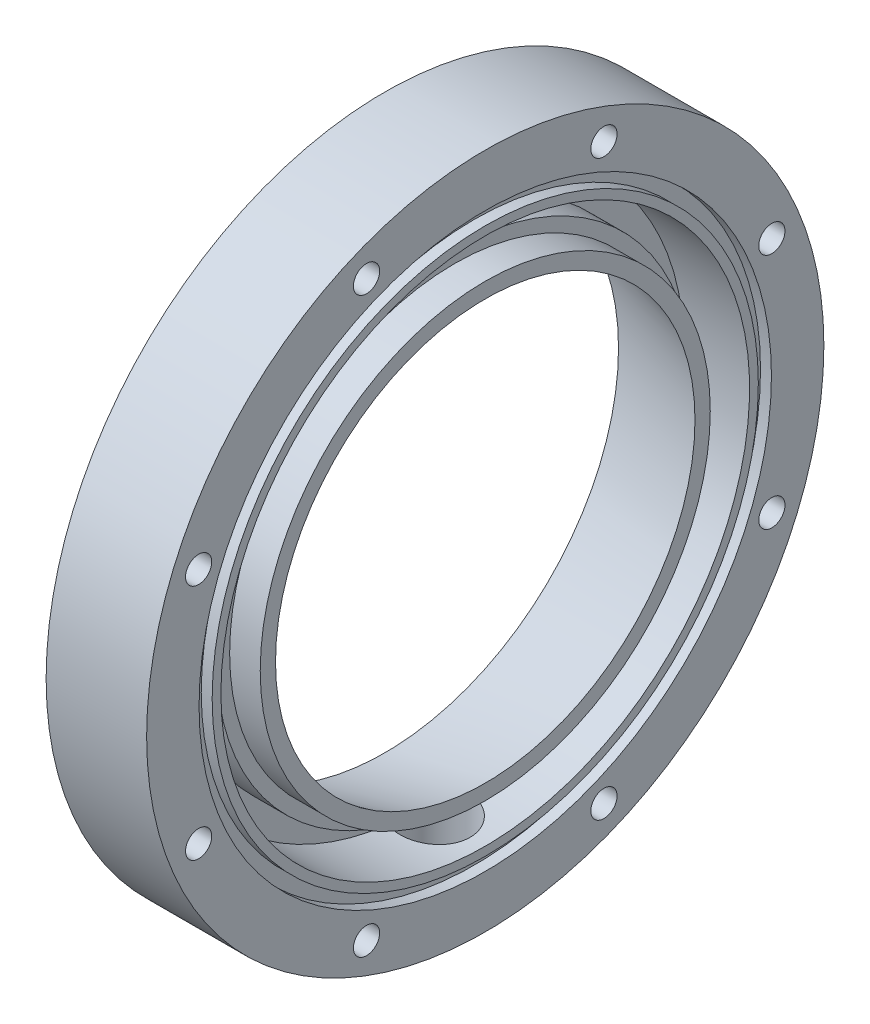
ISO-10303-21;
HEADER;
FILE_DESCRIPTION(('STEP AP214'),'2;1');
FILE_NAME('part.step','',(''),(''),'','','');
FILE_SCHEMA(('AUTOMOTIVE_DESIGN { 1 0 10303 214 1 1 1 1 }'));
ENDSEC;
DATA;
#1=APPLICATION_CONTEXT('core data for automotive mechanical design processes');
#2=APPLICATION_PROTOCOL_DEFINITION('international standard','automotive_design',2000,#1);
#3=PRODUCT_CONTEXT('',#1,'mechanical');
#4=PRODUCT('Part','Part','',(#3));
#5=PRODUCT_RELATED_PRODUCT_CATEGORY('part','',(#4));
#6=PRODUCT_DEFINITION_FORMATION('','',#4);
#7=PRODUCT_DEFINITION_CONTEXT('part definition',#1,'design');
#8=PRODUCT_DEFINITION('design','',#6,#7);
#9=PRODUCT_DEFINITION_SHAPE('','',#8);
#10=(LENGTH_UNIT() NAMED_UNIT(*) SI_UNIT(.MILLI.,.METRE.));
#11=(NAMED_UNIT(*) PLANE_ANGLE_UNIT() SI_UNIT($,.RADIAN.));
#12=(NAMED_UNIT(*) SI_UNIT($,.STERADIAN.) SOLID_ANGLE_UNIT());
#13=UNCERTAINTY_MEASURE_WITH_UNIT(LENGTH_MEASURE(1.E-05),#10,'distance_accuracy_value','');
#14=(GEOMETRIC_REPRESENTATION_CONTEXT(3) GLOBAL_UNCERTAINTY_ASSIGNED_CONTEXT((#13)) GLOBAL_UNIT_ASSIGNED_CONTEXT((#10,
#11,#12)) REPRESENTATION_CONTEXT('',''));
#15=CARTESIAN_POINT('',(0.,0.,0.));
#16=DIRECTION('',(0.,0.,1.));
#17=DIRECTION('',(1.,0.,0.));
#18=AXIS2_PLACEMENT_3D('',#15,#16,#17);
#19=CARTESIAN_POINT('',(0.,65.5954468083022,-27.1705236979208));
#20=DIRECTION('',(-1.,0.,0.));
#21=DIRECTION('',(0.,0.,1.00000000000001));
#22=AXIS2_PLACEMENT_3D('',#19,#20,#21);
#23=CYLINDRICAL_SURFACE('',#22,3.);
#24=CARTESIAN_POINT('',(0.,65.5954468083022,-27.1705236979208));
#25=DIRECTION('',(1.,0.,0.));
#26=DIRECTION('',(0.,-0.707106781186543,-0.70710678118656));
#27=AXIS2_PLACEMENT_3D('',#24,#25,#26);
#28=CIRCLE('',#27,3.);
#29=CARTESIAN_POINT('',(0.,63.4741264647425,-29.2918440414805));
#30=VERTEX_POINT('',#29);
#31=EDGE_CURVE('E243',#30,#30,#28,.T.);
#32=ORIENTED_EDGE('',*,*,#31,.T.);
#33=EDGE_LOOP('',(#32));
#34=FACE_BOUND('',#33,.T.);
#35=CARTESIAN_POINT('',(-19.,65.5954468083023,-27.1705236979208));
#36=DIRECTION('',(-1.,0.,0.));
#37=DIRECTION('',(0.,0.,1.00000000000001));
#38=AXIS2_PLACEMENT_3D('',#35,#36,#37);
#39=CIRCLE('',#38,3.);
#40=CARTESIAN_POINT('',(-19.,65.5954468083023,-24.1705236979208));
#41=VERTEX_POINT('',#40);
#42=EDGE_CURVE('E210',#41,#41,#39,.T.);
#43=ORIENTED_EDGE('',*,*,#42,.T.);
#44=EDGE_LOOP('',(#43));
#45=FACE_BOUND('',#44,.T.);
#46=ADVANCED_FACE('F34',(#34,#45),#23,.F.);
#47=CARTESIAN_POINT('',(0.,27.1705236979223,-65.5954468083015));
#48=DIRECTION('',(-1.,0.,0.));
#49=DIRECTION('',(0.,0.,1.00000000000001));
#50=AXIS2_PLACEMENT_3D('',#47,#48,#49);
#51=CYLINDRICAL_SURFACE('',#50,3.);
#52=CARTESIAN_POINT('',(0.,27.1705236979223,-65.5954468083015));
#53=DIRECTION('',(1.,0.,0.));
#54=DIRECTION('',(0.,-1.00000000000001,0.));
#55=AXIS2_PLACEMENT_3D('',#52,#53,#54);
#56=CIRCLE('',#55,3.);
#57=CARTESIAN_POINT('',(0.,24.1705236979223,-65.5954468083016));
#58=VERTEX_POINT('',#57);
#59=EDGE_CURVE('E311',#58,#58,#56,.T.);
#60=ORIENTED_EDGE('',*,*,#59,.T.);
#61=EDGE_LOOP('',(#60));
#62=FACE_BOUND('',#61,.T.);
#63=CARTESIAN_POINT('',(-19.,27.1705236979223,-65.5954468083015));
#64=DIRECTION('',(-1.,0.,0.));
#65=DIRECTION('',(0.,0.,1.00000000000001));
#66=AXIS2_PLACEMENT_3D('',#63,#64,#65);
#67=CIRCLE('',#66,3.);
#68=CARTESIAN_POINT('',(-19.,27.1705236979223,-62.5954468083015));
#69=VERTEX_POINT('',#68);
#70=EDGE_CURVE('E215',#69,#69,#67,.T.);
#71=ORIENTED_EDGE('',*,*,#70,.T.);
#72=EDGE_LOOP('',(#71));
#73=FACE_BOUND('',#72,.T.);
#74=ADVANCED_FACE('F130',(#62,#73),#51,.F.);
#75=CARTESIAN_POINT('',(0.,-27.170523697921,-65.5954468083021));
#76=DIRECTION('',(-1.,0.,0.));
#77=DIRECTION('',(0.,0.,1.00000000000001));
#78=AXIS2_PLACEMENT_3D('',#75,#76,#77);
#79=CYLINDRICAL_SURFACE('',#78,3.);
#80=CARTESIAN_POINT('',(0.,-27.170523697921,-65.5954468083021));
#81=DIRECTION('',(1.,0.,0.));
#82=DIRECTION('',(0.,-0.707106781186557,0.707106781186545));
#83=AXIS2_PLACEMENT_3D('',#80,#81,#82);
#84=CIRCLE('',#83,3.);
#85=CARTESIAN_POINT('',(0.,-29.2918440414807,-63.4741264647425));
#86=VERTEX_POINT('',#85);
#87=EDGE_CURVE('E308',#86,#86,#84,.T.);
#88=ORIENTED_EDGE('',*,*,#87,.T.);
#89=EDGE_LOOP('',(#88));
#90=FACE_BOUND('',#89,.T.);
#91=CARTESIAN_POINT('',(-19.0000000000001,-27.170523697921,-65.5954468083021));
#92=DIRECTION('',(-1.,0.,0.));
#93=DIRECTION('',(0.,0.,1.00000000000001));
#94=AXIS2_PLACEMENT_3D('',#91,#92,#93);
#95=CIRCLE('',#94,3.);
#96=CARTESIAN_POINT('',(-19.0000000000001,-27.170523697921,-62.5954468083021));
#97=VERTEX_POINT('',#96);
#98=EDGE_CURVE('E220',#97,#97,#95,.T.);
#99=ORIENTED_EDGE('',*,*,#98,.T.);
#100=EDGE_LOOP('',(#99));
#101=FACE_BOUND('',#100,.T.);
#102=ADVANCED_FACE('F136',(#90,#101),#79,.F.);
#103=CARTESIAN_POINT('',(0.,-65.5954468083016,-27.1705236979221));
#104=DIRECTION('',(-1.,0.,0.));
#105=DIRECTION('',(0.,0.,1.00000000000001));
#106=AXIS2_PLACEMENT_3D('',#103,#104,#105);
#107=CYLINDRICAL_SURFACE('',#106,3.);
#108=CARTESIAN_POINT('',(0.,-65.5954468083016,-27.1705236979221));
#109=DIRECTION('',(1.,0.,0.));
#110=DIRECTION('',(0.,0.,1.00000000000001));
#111=AXIS2_PLACEMENT_3D('',#108,#109,#110);
#112=CIRCLE('',#111,3.);
#113=CARTESIAN_POINT('',(0.,-65.5954468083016,-24.170523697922));
#114=VERTEX_POINT('',#113);
#115=EDGE_CURVE('E305',#114,#114,#112,.T.);
#116=ORIENTED_EDGE('',*,*,#115,.T.);
#117=EDGE_LOOP('',(#116));
#118=FACE_BOUND('',#117,.T.);
#119=CARTESIAN_POINT('',(-19.0000000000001,-65.5954468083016,-27.1705236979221));
#120=DIRECTION('',(-1.,0.,0.));
#121=DIRECTION('',(0.,0.,1.00000000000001));
#122=AXIS2_PLACEMENT_3D('',#119,#120,#121);
#123=CIRCLE('',#122,3.);
#124=CARTESIAN_POINT('',(-19.0000000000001,-65.5954468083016,-24.170523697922));
#125=VERTEX_POINT('',#124);
#126=EDGE_CURVE('E225',#125,#125,#123,.T.);
#127=ORIENTED_EDGE('',*,*,#126,.T.);
#128=EDGE_LOOP('',(#127));
#129=FACE_BOUND('',#128,.T.);
#130=ADVANCED_FACE('F147',(#118,#129),#107,.F.);
#131=CARTESIAN_POINT('',(0.,-65.5954468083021,27.1705236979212));
#132=DIRECTION('',(-1.,0.,0.));
#133=DIRECTION('',(0.,0.,1.00000000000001));
#134=AXIS2_PLACEMENT_3D('',#131,#132,#133);
#135=CYLINDRICAL_SURFACE('',#134,3.);
#136=CARTESIAN_POINT('',(0.,-65.5954468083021,27.1705236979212));
#137=DIRECTION('',(1.,0.,0.));
#138=DIRECTION('',(0.,0.707106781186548,0.707106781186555));
#139=AXIS2_PLACEMENT_3D('',#136,#137,#138);
#140=CIRCLE('',#139,3.);
#141=CARTESIAN_POINT('',(0.,-63.4741264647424,29.2918440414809));
#142=VERTEX_POINT('',#141);
#143=EDGE_CURVE('E302',#142,#142,#140,.T.);
#144=ORIENTED_EDGE('',*,*,#143,.T.);
#145=EDGE_LOOP('',(#144));
#146=FACE_BOUND('',#145,.T.);
#147=CARTESIAN_POINT('',(-19.,-65.5954468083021,27.1705236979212));
#148=DIRECTION('',(-1.,0.,0.));
#149=DIRECTION('',(0.,0.,1.00000000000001));
#150=AXIS2_PLACEMENT_3D('',#147,#148,#149);
#151=CIRCLE('',#150,3.);
#152=CARTESIAN_POINT('',(-19.,-65.5954468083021,30.1705236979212));
#153=VERTEX_POINT('',#152);
#154=EDGE_CURVE('E230',#153,#153,#151,.T.);
#155=ORIENTED_EDGE('',*,*,#154,.T.);
#156=EDGE_LOOP('',(#155));
#157=FACE_BOUND('',#156,.T.);
#158=ADVANCED_FACE('F151',(#146,#157),#135,.F.);
#159=CARTESIAN_POINT('',(0.,-27.1705236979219,65.5954468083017));
#160=DIRECTION('',(-1.,0.,0.));
#161=DIRECTION('',(0.,0.,1.00000000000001));
#162=AXIS2_PLACEMENT_3D('',#159,#160,#161);
#163=CYLINDRICAL_SURFACE('',#162,3.);
#164=CARTESIAN_POINT('',(0.,-27.1705236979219,65.5954468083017));
#165=DIRECTION('',(1.,0.,0.));
#166=DIRECTION('',(0.,1.00000000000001,0.));
#167=AXIS2_PLACEMENT_3D('',#164,#165,#166);
#168=CIRCLE('',#167,3.);
#169=CARTESIAN_POINT('',(0.,-24.1705236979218,65.5954468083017));
#170=VERTEX_POINT('',#169);
#171=EDGE_CURVE('E299',#170,#170,#168,.T.);
#172=ORIENTED_EDGE('',*,*,#171,.T.);
#173=EDGE_LOOP('',(#172));
#174=FACE_BOUND('',#173,.T.);
#175=CARTESIAN_POINT('',(-19.0000000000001,-27.1705236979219,65.5954468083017));
#176=DIRECTION('',(-1.,0.,0.));
#177=DIRECTION('',(0.,0.,1.00000000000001));
#178=AXIS2_PLACEMENT_3D('',#175,#176,#177);
#179=CIRCLE('',#178,3.);
#180=CARTESIAN_POINT('',(-19.0000000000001,-27.1705236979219,68.5954468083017));
#181=VERTEX_POINT('',#180);
#182=EDGE_CURVE('E235',#181,#181,#179,.T.);
#183=ORIENTED_EDGE('',*,*,#182,.T.);
#184=EDGE_LOOP('',(#183));
#185=FACE_BOUND('',#184,.T.);
#186=ADVANCED_FACE('F155',(#174,#185),#163,.F.);
#187=CARTESIAN_POINT('',(-7.21644966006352E-13,27.1705236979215,65.5954468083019));
#188=DIRECTION('',(-1.,0.,0.));
#189=DIRECTION('',(0.,0.,1.00000000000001));
#190=AXIS2_PLACEMENT_3D('',#187,#188,#189);
#191=CYLINDRICAL_SURFACE('',#190,3.);
#192=CARTESIAN_POINT('',(-7.21644966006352E-13,27.1705236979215,65.5954468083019));
#193=DIRECTION('',(1.,0.,0.));
#194=DIRECTION('',(0.,0.707106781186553,-0.70710678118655));
#195=AXIS2_PLACEMENT_3D('',#192,#193,#194);
#196=CIRCLE('',#195,3.);
#197=CARTESIAN_POINT('',(-7.22477633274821E-13,29.2918440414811,63.4741264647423));
#198=VERTEX_POINT('',#197);
#199=EDGE_CURVE('E294',#198,#198,#196,.T.);
#200=ORIENTED_EDGE('',*,*,#199,.T.);
#201=EDGE_LOOP('',(#200));
#202=FACE_BOUND('',#201,.T.);
#203=CARTESIAN_POINT('',(-19.0000000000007,27.1705236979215,65.5954468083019));
#204=DIRECTION('',(-1.,0.,0.));
#205=DIRECTION('',(0.,0.,1.00000000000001));
#206=AXIS2_PLACEMENT_3D('',#203,#204,#205);
#207=CIRCLE('',#206,3.);
#208=CARTESIAN_POINT('',(-19.0000000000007,27.1705236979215,68.595446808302));
#209=VERTEX_POINT('',#208);
#210=EDGE_CURVE('E240',#209,#209,#207,.T.);
#211=ORIENTED_EDGE('',*,*,#210,.T.);
#212=EDGE_LOOP('',(#211));
#213=FACE_BOUND('',#212,.T.);
#214=ADVANCED_FACE('F159',(#202,#213),#191,.F.);
#215=CARTESIAN_POINT('',(-23.0000000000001,77.5000000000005,0.));
#216=DIRECTION('',(1.,0.,0.));
#217=DIRECTION('',(0.,0.,-1.00000000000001));
#218=AXIS2_PLACEMENT_3D('',#215,#216,#217);
#219=PLANE('',#218);
#220=CARTESIAN_POINT('',(-23.,65.5954468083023,-27.1705236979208));
#221=DIRECTION('',(-1.,0.,0.));
#222=DIRECTION('',(0.,0.707106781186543,0.70710678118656));
#223=AXIS2_PLACEMENT_3D('',#220,#221,#222);
#224=CIRCLE('',#223,4.75);
#225=CARTESIAN_POINT('',(-23.,68.9542040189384,-23.8117664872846));
#226=VERTEX_POINT('',#225);
#227=EDGE_CURVE('E339',#226,#226,#224,.T.);
#228=ORIENTED_EDGE('',*,*,#227,.F.);
#229=EDGE_LOOP('',(#228));
#230=FACE_BOUND('',#229,.T.);
#231=CARTESIAN_POINT('',(-23.0000000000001,27.1705236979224,-65.5954468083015));
#232=DIRECTION('',(-1.,0.,0.));
#233=DIRECTION('',(0.,1.00000000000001,0.));
#234=AXIS2_PLACEMENT_3D('',#231,#232,#233);
#235=CIRCLE('',#234,4.75);
#236=CARTESIAN_POINT('',(-23.0000000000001,31.9205236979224,-65.5954468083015));
#237=VERTEX_POINT('',#236);
#238=EDGE_CURVE('E213',#237,#237,#235,.T.);
#239=ORIENTED_EDGE('',*,*,#238,.F.);
#240=EDGE_LOOP('',(#239));
#241=FACE_BOUND('',#240,.T.);
#242=CARTESIAN_POINT('',(-23.0000000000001,-27.170523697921,-65.5954468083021));
#243=DIRECTION('',(-1.,0.,0.));
#244=DIRECTION('',(0.,0.707106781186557,-0.707106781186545));
#245=AXIS2_PLACEMENT_3D('',#242,#243,#244);
#246=CIRCLE('',#245,4.75);
#247=CARTESIAN_POINT('',(-23.0000000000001,-23.8117664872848,-68.9542040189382));
#248=VERTEX_POINT('',#247);
#249=EDGE_CURVE('E218',#248,#248,#246,.T.);
#250=ORIENTED_EDGE('',*,*,#249,.F.);
#251=EDGE_LOOP('',(#250));
#252=FACE_BOUND('',#251,.T.);
#253=CARTESIAN_POINT('',(-23.,-65.5954468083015,-27.1705236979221));
#254=DIRECTION('',(-1.,0.,0.));
#255=DIRECTION('',(0.,0.,-1.00000000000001));
#256=AXIS2_PLACEMENT_3D('',#253,#254,#255);
#257=CIRCLE('',#256,4.75);
#258=CARTESIAN_POINT('',(-23.,-65.5954468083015,-31.9205236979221));
#259=VERTEX_POINT('',#258);
#260=EDGE_CURVE('E223',#259,#259,#257,.T.);
#261=ORIENTED_EDGE('',*,*,#260,.F.);
#262=EDGE_LOOP('',(#261));
#263=FACE_BOUND('',#262,.T.);
#264=CARTESIAN_POINT('',(-23.0000000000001,-65.595446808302,27.1705236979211));
#265=DIRECTION('',(-1.,0.,0.));
#266=DIRECTION('',(0.,-0.707106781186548,-0.707106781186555));
#267=AXIS2_PLACEMENT_3D('',#264,#265,#266);
#268=CIRCLE('',#267,4.75);
#269=CARTESIAN_POINT('',(-23.0000000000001,-68.9542040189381,23.811766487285));
#270=VERTEX_POINT('',#269);
#271=EDGE_CURVE('E228',#270,#270,#268,.T.);
#272=ORIENTED_EDGE('',*,*,#271,.F.);
#273=EDGE_LOOP('',(#272));
#274=FACE_BOUND('',#273,.T.);
#275=CARTESIAN_POINT('',(-23.,-27.1705236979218,65.5954468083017));
#276=DIRECTION('',(-1.,0.,0.));
#277=DIRECTION('',(0.,-1.00000000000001,0.));
#278=AXIS2_PLACEMENT_3D('',#275,#276,#277);
#279=CIRCLE('',#278,4.75);
#280=CARTESIAN_POINT('',(-23.,-31.9205236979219,65.5954468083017));
#281=VERTEX_POINT('',#280);
#282=EDGE_CURVE('E233',#281,#281,#279,.T.);
#283=ORIENTED_EDGE('',*,*,#282,.F.);
#284=EDGE_LOOP('',(#283));
#285=FACE_BOUND('',#284,.T.);
#286=CARTESIAN_POINT('',(-23.0000000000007,27.1705236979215,65.5954468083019));
#287=DIRECTION('',(-1.,0.,0.));
#288=DIRECTION('',(0.,-0.707106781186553,0.70710678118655));
#289=AXIS2_PLACEMENT_3D('',#286,#287,#288);
#290=CIRCLE('',#289,4.75);
#291=CARTESIAN_POINT('',(-23.0000000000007,23.8117664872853,68.954204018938));
#292=VERTEX_POINT('',#291);
#293=EDGE_CURVE('E238',#292,#292,#290,.T.);
#294=ORIENTED_EDGE('',*,*,#293,.F.);
#295=EDGE_LOOP('',(#294));
#296=FACE_BOUND('',#295,.T.);
#297=CARTESIAN_POINT('',(-23.,0.,0.));
#298=DIRECTION('',(-1.,0.,0.));
#299=DIRECTION('',(0.,0.,1.00000000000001));
#300=AXIS2_PLACEMENT_3D('',#297,#298,#299);
#301=CIRCLE('',#300,53.5);
#302=CARTESIAN_POINT('',(-23.,0.,53.5000000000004));
#303=VERTEX_POINT('',#302);
#304=EDGE_CURVE('E268',#303,#303,#301,.T.);
#305=ORIENTED_EDGE('',*,*,#304,.F.);
#306=EDGE_LOOP('',(#305));
#307=FACE_BOUND('',#306,.T.);
#308=CARTESIAN_POINT('',(-23.,0.,0.));
#309=DIRECTION('',(-1.,0.,0.));
#310=DIRECTION('',(0.,0.,1.00000000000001));
#311=AXIS2_PLACEMENT_3D('',#308,#309,#310);
#312=CIRCLE('',#311,77.5);
#313=CARTESIAN_POINT('',(-23.,0.,77.5000000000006));
#314=VERTEX_POINT('',#313);
#315=EDGE_CURVE('E271',#314,#314,#312,.T.);
#316=ORIENTED_EDGE('',*,*,#315,.T.);
#317=EDGE_LOOP('',(#316));
#318=FACE_BOUND('',#317,.T.);
#319=CARTESIAN_POINT('',(-23.,65.5954468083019,27.1705236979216));
#320=DIRECTION('',(-1.,0.,0.));
#321=DIRECTION('',(0.,0.,1.00000000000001));
#322=AXIS2_PLACEMENT_3D('',#319,#320,#321);
#323=CIRCLE('',#322,4.75);
#324=CARTESIAN_POINT('',(-23.,65.5954468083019,31.9205236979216));
#325=VERTEX_POINT('',#324);
#326=EDGE_CURVE('E291',#325,#325,#323,.T.);
#327=ORIENTED_EDGE('',*,*,#326,.F.);
#328=EDGE_LOOP('',(#327));
#329=FACE_BOUND('',#328,.T.);
#330=ADVANCED_FACE('F163',(#230,#241,#252,#263,#274,#285,#296,#307,#318,#329),#219,.F.);
#331=CARTESIAN_POINT('',(0.,65.5000000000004,0.));
#332=DIRECTION('',(-1.,0.,0.));
#333=DIRECTION('',(0.,0.,1.00000000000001));
#334=AXIS2_PLACEMENT_3D('',#331,#332,#333);
#335=PLANE('',#334);
#336=ORIENTED_EDGE('',*,*,#59,.F.);
#337=EDGE_LOOP('',(#336));
#338=FACE_BOUND('',#337,.T.);
#339=ORIENTED_EDGE('',*,*,#115,.F.);
#340=EDGE_LOOP('',(#339));
#341=FACE_BOUND('',#340,.T.);
#342=ORIENTED_EDGE('',*,*,#171,.F.);
#343=EDGE_LOOP('',(#342));
#344=FACE_BOUND('',#343,.T.);
#345=CARTESIAN_POINT('',(0.,65.5954468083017,27.1705236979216));
#346=DIRECTION('',(1.,0.,0.));
#347=DIRECTION('',(0.,0.,-1.00000000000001));
#348=AXIS2_PLACEMENT_3D('',#345,#346,#347);
#349=CIRCLE('',#348,3.);
#350=CARTESIAN_POINT('',(0.,65.5954468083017,24.1705236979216));
#351=VERTEX_POINT('',#350);
#352=EDGE_CURVE('E248',#351,#351,#349,.T.);
#353=ORIENTED_EDGE('',*,*,#352,.F.);
#354=EDGE_LOOP('',(#353));
#355=FACE_BOUND('',#354,.T.);
#356=CARTESIAN_POINT('',(0.,0.,0.));
#357=DIRECTION('',(-1.,0.,0.));
#358=DIRECTION('',(0.,0.,1.00000000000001));
#359=AXIS2_PLACEMENT_3D('',#356,#357,#358);
#360=CIRCLE('',#359,77.5);
#361=CARTESIAN_POINT('',(0.,0.,77.5000000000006));
#362=VERTEX_POINT('',#361);
#363=EDGE_CURVE('E274',#362,#362,#360,.T.);
#364=ORIENTED_EDGE('',*,*,#363,.F.);
#365=EDGE_LOOP('',(#364));
#366=FACE_BOUND('',#365,.T.);
#367=CARTESIAN_POINT('',(0.,0.,0.));
#368=DIRECTION('',(-1.,0.,0.));
#369=DIRECTION('',(0.,0.,1.00000000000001));
#370=AXIS2_PLACEMENT_3D('',#367,#368,#369);
#371=CIRCLE('',#370,65.5);
#372=CARTESIAN_POINT('',(0.,0.,65.5000000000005));
#373=VERTEX_POINT('',#372);
#374=EDGE_CURVE('E277',#373,#373,#371,.T.);
#375=ORIENTED_EDGE('',*,*,#374,.T.);
#376=EDGE_LOOP('',(#375));
#377=FACE_BOUND('',#376,.T.);
#378=ORIENTED_EDGE('',*,*,#199,.F.);
#379=EDGE_LOOP('',(#378));
#380=FACE_BOUND('',#379,.T.);
#381=ORIENTED_EDGE('',*,*,#143,.F.);
#382=EDGE_LOOP('',(#381));
#383=FACE_BOUND('',#382,.T.);
#384=ORIENTED_EDGE('',*,*,#87,.F.);
#385=EDGE_LOOP('',(#384));
#386=FACE_BOUND('',#385,.T.);
#387=ORIENTED_EDGE('',*,*,#31,.F.);
#388=EDGE_LOOP('',(#387));
#389=FACE_BOUND('',#388,.T.);
#390=ADVANCED_FACE('F178',(#338,#341,#344,#355,#366,#377,#380,#383,#386,#389),#335,.F.);
#391=CARTESIAN_POINT('',(0.,65.5954468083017,27.1705236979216));
#392=DIRECTION('',(-1.,0.,0.));
#393=DIRECTION('',(0.,0.,1.00000000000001));
#394=AXIS2_PLACEMENT_3D('',#391,#392,#393);
#395=CYLINDRICAL_SURFACE('',#394,3.);
#396=ORIENTED_EDGE('',*,*,#352,.T.);
#397=EDGE_LOOP('',(#396));
#398=FACE_BOUND('',#397,.T.);
#399=CARTESIAN_POINT('',(-19.,65.5954468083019,27.1705236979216));
#400=DIRECTION('',(-1.,0.,0.));
#401=DIRECTION('',(0.,0.,1.00000000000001));
#402=AXIS2_PLACEMENT_3D('',#399,#400,#401);
#403=CIRCLE('',#402,3.);
#404=CARTESIAN_POINT('',(-19.,65.5954468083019,30.1705236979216));
#405=VERTEX_POINT('',#404);
#406=EDGE_CURVE('E245',#405,#405,#403,.T.);
#407=ORIENTED_EDGE('',*,*,#406,.T.);
#408=EDGE_LOOP('',(#407));
#409=FACE_BOUND('',#408,.T.);
#410=ADVANCED_FACE('F174',(#398,#409),#395,.F.);
#411=CARTESIAN_POINT('',(0.,62.5000000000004,0.));
#412=DIRECTION('',(-1.,0.,0.));
#413=DIRECTION('',(0.,0.,1.00000000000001));
#414=AXIS2_PLACEMENT_3D('',#411,#412,#413);
#415=PLANE('',#414);
#416=CARTESIAN_POINT('',(0.,0.,0.));
#417=DIRECTION('',(-1.,0.,0.));
#418=DIRECTION('',(0.,0.,1.00000000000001));
#419=AXIS2_PLACEMENT_3D('',#416,#417,#418);
#420=CIRCLE('',#419,62.5);
#421=CARTESIAN_POINT('',(0.,0.,62.5000000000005));
#422=VERTEX_POINT('',#421);
#423=EDGE_CURVE('E286',#422,#422,#420,.T.);
#424=ORIENTED_EDGE('',*,*,#423,.F.);
#425=EDGE_LOOP('',(#424));
#426=FACE_BOUND('',#425,.T.);
#427=CARTESIAN_POINT('',(0.,0.,0.));
#428=DIRECTION('',(-1.,0.,0.));
#429=DIRECTION('',(0.,0.,1.00000000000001));
#430=AXIS2_PLACEMENT_3D('',#427,#428,#429);
#431=CIRCLE('',#430,60.5);
#432=CARTESIAN_POINT('',(0.,0.,60.5000000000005));
#433=VERTEX_POINT('',#432);
#434=EDGE_CURVE('E70',#433,#433,#431,.T.);
#435=ORIENTED_EDGE('',*,*,#434,.T.);
#436=EDGE_LOOP('',(#435));
#437=FACE_BOUND('',#436,.T.);
#438=ADVANCED_FACE('F177',(#426,#437),#415,.F.);
#439=CARTESIAN_POINT('',(0.,0.,0.));
#440=DIRECTION('',(-1.,0.,0.));
#441=DIRECTION('',(0.,0.,1.00000000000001));
#442=AXIS2_PLACEMENT_3D('',#439,#440,#441);
#443=CYLINDRICAL_SURFACE('',#442,60.5);
#444=ORIENTED_EDGE('',*,*,#434,.F.);
#445=EDGE_LOOP('',(#444));
#446=FACE_BOUND('',#445,.T.);
#447=CARTESIAN_POINT('',(-15.,0.,0.));
#448=DIRECTION('',(-1.,0.,0.));
#449=DIRECTION('',(0.,0.,1.00000000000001));
#450=AXIS2_PLACEMENT_3D('',#447,#448,#449);
#451=CIRCLE('',#450,60.5);
#452=CARTESIAN_POINT('',(-15.0000000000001,-60.0707915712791,7.19374728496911));
#453=VERTEX_POINT('',#452);
#454=CARTESIAN_POINT('',(-15.,-60.0707915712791,-7.19374728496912));
#455=VERTEX_POINT('',#454);
#456=EDGE_CURVE('E80',#453,#455,#451,.T.);
#457=ORIENTED_EDGE('',*,*,#456,.T.);
#458=CARTESIAN_POINT('',(-15.,-60.0707915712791,-7.19374728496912));
#459=CARTESIAN_POINT('',(-14.7992003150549,-60.059082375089,-7.29146957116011));
#460=CARTESIAN_POINT('',(-14.5942522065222,-60.0481537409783,-7.38075963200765));
#461=CARTESIAN_POINT('',(-14.1775349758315,-60.0281283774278,-7.54192352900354));
#462=CARTESIAN_POINT('',(-13.9657659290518,-60.019031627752,-7.61379755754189));
#463=CARTESIAN_POINT('',(-13.5370161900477,-60.0029457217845,-7.73953931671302));
#464=CARTESIAN_POINT('',(-13.3200389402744,-59.9959552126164,-7.79341860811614));
#465=CARTESIAN_POINT('',(-12.8822825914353,-59.9842717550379,-7.88284168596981));
#466=CARTESIAN_POINT('',(-12.6615035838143,-59.9795787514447,-7.91838591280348));
#467=CARTESIAN_POINT('',(-12.2175614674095,-59.9726237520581,-7.97089080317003));
#468=CARTESIAN_POINT('',(-11.9943968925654,-59.9703633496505,-7.98783928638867));
#469=CARTESIAN_POINT('',(-11.5474176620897,-59.9683441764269,-8.00298423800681));
#470=CARTESIAN_POINT('',(-11.323602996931,-59.9685854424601,-8.00118043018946));
#471=CARTESIAN_POINT('',(-10.876988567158,-59.9715623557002,-7.97883665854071));
#472=CARTESIAN_POINT('',(-10.6541885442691,-59.9742973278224,-7.9583017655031));
#473=CARTESIAN_POINT('',(-10.2111339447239,-59.9821816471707,-7.89865733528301));
#474=CARTESIAN_POINT('',(-9.9908793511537,-59.9873309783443,-7.85954792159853));
#475=CARTESIAN_POINT('',(-9.55505626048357,-59.999879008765,-7.76317397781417));
#476=CARTESIAN_POINT('',(-9.33947692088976,-60.0072717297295,-7.70595768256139));
#477=CARTESIAN_POINT('',(-8.91384554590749,-60.0241031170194,-7.57373643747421));
#478=CARTESIAN_POINT('',(-8.70379544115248,-60.0335424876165,-7.49872536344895));
#479=CARTESIAN_POINT('',(-8.29075870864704,-60.054197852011,-7.33146749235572));
#480=CARTESIAN_POINT('',(-8.08777226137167,-60.0654138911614,-7.23922025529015));
#481=CARTESIAN_POINT('',(-7.69026753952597,-60.0893059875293,-7.03814963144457));
#482=CARTESIAN_POINT('',(-7.49574946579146,-60.1019820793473,-6.92932585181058));
#483=CARTESIAN_POINT('',(-7.11543519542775,-60.128514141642,-6.69520272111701));
#484=CARTESIAN_POINT('',(-6.92969531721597,-60.1423764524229,-6.56981259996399));
#485=CARTESIAN_POINT('',(-6.56941629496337,-60.1708268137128,-6.30392500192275));
#486=CARTESIAN_POINT('',(-6.39487743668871,-60.185414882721,-6.16342713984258));
#487=CARTESIAN_POINT('',(-6.05824549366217,-60.2149032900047,-5.8683384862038));
#488=CARTESIAN_POINT('',(-5.89614973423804,-60.2298035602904,-5.71375073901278));
#489=CARTESIAN_POINT('',(-5.58542829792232,-60.2595073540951,-5.39147124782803));
#490=CARTESIAN_POINT('',(-5.43680731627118,-60.2743108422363,-5.22377497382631));
#491=CARTESIAN_POINT('',(-5.15323437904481,-60.3034941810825,-4.87538028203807));
#492=CARTESIAN_POINT('',(-5.01837508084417,-60.3178707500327,-4.69460615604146));
#493=CARTESIAN_POINT('',(-4.76436432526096,-60.3456944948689,-4.32226815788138));
#494=CARTESIAN_POINT('',(-4.645213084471,-60.3591416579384,-4.13070413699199));
#495=CARTESIAN_POINT('',(-4.42347712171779,-60.3847252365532,-3.7381336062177));
#496=CARTESIAN_POINT('',(-4.32089230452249,-60.396861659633,-3.53712715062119));
#497=CARTESIAN_POINT('',(-4.13303391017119,-60.4194793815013,-3.12708603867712));
#498=CARTESIAN_POINT('',(-4.04776063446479,-60.4299606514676,-2.9180512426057));
#499=CARTESIAN_POINT('',(-3.89538939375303,-60.4489404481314,-2.49408968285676));
#500=CARTESIAN_POINT('',(-3.82823700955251,-60.4574449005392,-2.27918274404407));
#501=CARTESIAN_POINT('',(-3.7122460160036,-60.4722729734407,-1.84432728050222));
#502=CARTESIAN_POINT('',(-3.6634137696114,-60.478595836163,-1.624377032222));
#503=CARTESIAN_POINT('',(-3.58448152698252,-60.4888741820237,-1.18118840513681));
#504=CARTESIAN_POINT('',(-3.55437307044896,-60.4928307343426,-0.957951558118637));
#505=CARTESIAN_POINT('',(-3.51307276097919,-60.4982692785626,-0.509603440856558));
#506=CARTESIAN_POINT('',(-3.50188935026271,-60.4997501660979,-0.284491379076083));
#507=CARTESIAN_POINT('',(-3.49856313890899,-60.5001900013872,0.164148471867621));
#508=CARTESIAN_POINT('',(-3.50627504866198,-60.4991681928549,0.38767517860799));
#509=CARTESIAN_POINT('',(-3.54037047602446,-60.4946726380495,0.833177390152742));
#510=CARTESIAN_POINT('',(-3.56674587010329,-60.4911999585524,1.05515352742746));
#511=CARTESIAN_POINT('',(-3.63797051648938,-60.4819002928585,1.49612371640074));
#512=CARTESIAN_POINT('',(-3.68282402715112,-60.4760727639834,1.71511706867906));
#513=CARTESIAN_POINT('',(-3.79067084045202,-60.462227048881,2.14851313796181));
#514=CARTESIAN_POINT('',(-3.85366368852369,-60.4542089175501,2.36291596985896));
#515=CARTESIAN_POINT('',(-3.99728554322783,-60.4362114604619,2.78550717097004));
#516=CARTESIAN_POINT('',(-4.07790438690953,-60.4262332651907,2.99369904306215));
#517=CARTESIAN_POINT('',(-4.25621450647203,-60.4045909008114,3.40254449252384));
#518=CARTESIAN_POINT('',(-4.35390564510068,-60.3929267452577,3.60319813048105));
#519=CARTESIAN_POINT('',(-4.56568303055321,-60.3682341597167,3.9956186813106));
#520=CARTESIAN_POINT('',(-4.67977237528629,-60.3552054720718,4.18738390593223));
#521=CARTESIAN_POINT('',(-4.9234866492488,-60.3281515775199,4.56060621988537));
#522=CARTESIAN_POINT('',(-5.05310636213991,-60.3141267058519,4.74206674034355));
#523=CARTESIAN_POINT('',(-5.32804136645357,-60.2853568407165,5.09483166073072));
#524=CARTESIAN_POINT('',(-5.47346740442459,-60.2706072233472,5.26604938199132));
#525=CARTESIAN_POINT('',(-5.77818442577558,-60.2409012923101,5.5956408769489));
#526=CARTESIAN_POINT('',(-5.93747514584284,-60.2259449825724,5.75401489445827));
#527=CARTESIAN_POINT('',(-6.26883740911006,-60.1962443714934,6.0568407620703));
#528=CARTESIAN_POINT('',(-6.44091054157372,-60.1815000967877,6.20129087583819));
#529=CARTESIAN_POINT('',(-6.79662318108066,-60.1526419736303,6.47523278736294));
#530=CARTESIAN_POINT('',(-6.98026249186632,-60.1385281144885,6.60472483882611));
#531=CARTESIAN_POINT('',(-7.35864732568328,-60.1112722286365,6.84836096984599));
#532=CARTESIAN_POINT('',(-7.55343717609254,-60.0981346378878,6.96243671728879));
#533=CARTESIAN_POINT('',(-7.95195511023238,-60.0732810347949,7.17371747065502));
#534=CARTESIAN_POINT('',(-8.15567982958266,-60.0615644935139,7.27092875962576));
#535=CARTESIAN_POINT('',(-8.57072107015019,-60.0398844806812,7.44783322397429));
#536=CARTESIAN_POINT('',(-8.78203857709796,-60.029921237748,7.52752411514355));
#537=CARTESIAN_POINT('',(-9.21065601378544,-60.0120427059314,7.6687547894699));
#538=CARTESIAN_POINT('',(-9.42795377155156,-60.0041266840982,7.73030106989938));
#539=CARTESIAN_POINT('',(-9.86582252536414,-59.9906069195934,7.83452811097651));
#540=CARTESIAN_POINT('',(-10.0863686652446,-59.9849905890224,7.87731166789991));
#541=CARTESIAN_POINT('',(-10.5303242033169,-59.9761704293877,7.9441878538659));
#542=CARTESIAN_POINT('',(-10.7537335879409,-59.9729665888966,7.96828057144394));
#543=CARTESIAN_POINT('',(-11.2018779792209,-59.9690641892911,7.99759719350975));
#544=CARTESIAN_POINT('',(-11.4266133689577,-59.9683663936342,8.00281534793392));
#545=CARTESIAN_POINT('',(-11.875717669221,-59.9694983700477,7.99432802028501));
#546=CARTESIAN_POINT('',(-12.1000865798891,-59.971328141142,7.98062254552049));
#547=CARTESIAN_POINT('',(-12.5553568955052,-59.97757940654,7.93350889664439));
#548=CARTESIAN_POINT('',(-12.7861817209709,-59.982096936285,7.89937034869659));
#549=CARTESIAN_POINT('',(-13.243921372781,-59.9936569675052,7.8110871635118));
#550=CARTESIAN_POINT('',(-13.4708359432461,-60.0006996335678,7.75694122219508));
#551=CARTESIAN_POINT('',(-13.9192348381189,-60.0171020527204,7.62900296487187));
#552=CARTESIAN_POINT('',(-14.1407130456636,-60.0264642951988,7.55518953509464));
#553=CARTESIAN_POINT('',(-14.5763013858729,-60.0471974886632,7.38856320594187));
#554=CARTESIAN_POINT('',(-14.7904116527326,-60.0585684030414,7.29575065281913));
#555=CARTESIAN_POINT('',(-15.0000000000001,-60.0707915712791,7.19374728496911));
#556=B_SPLINE_CURVE_WITH_KNOTS('',3,(#458,#459,#460,#461,#462,#463,#464,#465,#466,#467,#468,
#469,#470,#471,#472,#473,#474,#475,#476,#477,#478,#479,#480,#481,#482,#483,#484,#485,#486,#487,
#488,#489,#490,#491,#492,#493,#494,#495,#496,#497,#498,#499,#500,#501,#502,#503,#504,#505,#506,
#507,#508,#509,#510,#511,#512,#513,#514,#515,#516,#517,#518,#519,#520,#521,#522,#523,#524,#525,
#526,#527,#528,#529,#530,#531,#532,#533,#534,#535,#536,#537,#538,#539,#540,#541,#542,#543,#544,
#545,#546,#547,#548,#549,#550,#551,#552,#553,#554,#555),.UNSPECIFIED.,.F.,.F.,(4,2,2,2,2,2,2,2,
2,2,2,2,2,2,2,2,2,2,2,2,2,2,2,2,2,2,2,2,2,2,2,2,2,2,2,2,2,2,2,2,2,2,2,2,2,2,2,2,4),(0.,
0.670672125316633,1.34133684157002,2.01156985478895,2.68178676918,3.35244241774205,
4.02310794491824,4.69359196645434,5.36407153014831,6.03277983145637,6.70171860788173,
7.37067446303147,8.0396461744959,8.71244837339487,9.38526773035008,10.0579420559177,
10.730849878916,11.4080248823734,12.0852092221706,12.7623896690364,13.4395819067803,
14.1147172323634,14.7900868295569,15.4651510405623,16.1405163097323,16.8107048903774,
17.4806019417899,18.1506534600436,18.8206881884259,19.4903375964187,20.1599816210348,
20.8297523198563,21.4992986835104,22.1738822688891,22.8484530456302,23.5231078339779,
24.1977511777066,24.8752930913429,25.5525820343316,26.2299592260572,26.9070935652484,
27.5804702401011,28.2538437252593,28.9274223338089,29.6010006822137,30.3002277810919,
30.9995004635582,31.6995268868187,32.3995405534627),.UNSPECIFIED.);
#557=EDGE_CURVE('E60',#455,#453,#556,.T.);
#558=ORIENTED_EDGE('',*,*,#557,.T.);
#559=EDGE_LOOP('',(#457,#558));
#560=FACE_BOUND('',#559,.T.);
#561=ADVANCED_FACE('F91',(#446,#560),#443,.F.);
#562=CARTESIAN_POINT('',(-15.0000000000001,60.5000000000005,0.));
#563=DIRECTION('',(-1.,0.,0.));
#564=DIRECTION('',(0.,0.,1.00000000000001));
#565=AXIS2_PLACEMENT_3D('',#562,#563,#564);
#566=PLANE('',#565);
#567=DIRECTION('',(0.,0.,1.00000000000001));
#568=VECTOR('',#567,1.);
#569=CARTESIAN_POINT('',(-15.0000000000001,-57.5000000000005,0.));
#570=LINE('',#569,#568);
#571=CARTESIAN_POINT('',(-15.0000000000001,-57.5000000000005,-7.19374728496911));
#572=VERTEX_POINT('',#571);
#573=CARTESIAN_POINT('',(-15.0000000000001,-57.5000000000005,7.19374728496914));
#574=VERTEX_POINT('',#573);
#575=EDGE_CURVE('E66',#572,#574,#570,.T.);
#576=ORIENTED_EDGE('',*,*,#575,.F.);
#577=DIRECTION('',(0.,-1.00000000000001,0.));
#578=VECTOR('',#577,1.);
#579=CARTESIAN_POINT('',(-15.0000000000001,-57.5000000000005,-7.19374728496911));
#580=LINE('',#579,#578);
#581=EDGE_CURVE('E74',#572,#455,#580,.T.);
#582=ORIENTED_EDGE('',*,*,#581,.T.);
#583=ORIENTED_EDGE('',*,*,#456,.F.);
#584=DIRECTION('',(0.,-1.00000000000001,0.));
#585=VECTOR('',#584,1.);
#586=CARTESIAN_POINT('',(-15.0000000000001,-57.5000000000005,7.19374728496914));
#587=LINE('',#586,#585);
#588=EDGE_CURVE('E73',#453,#574,#587,.F.);
#589=ORIENTED_EDGE('',*,*,#588,.T.);
#590=EDGE_LOOP('',(#576,#582,#583,#589));
#591=FACE_BOUND('',#590,.T.);
#592=CARTESIAN_POINT('',(-15.,0.,0.));
#593=DIRECTION('',(-1.,0.,0.));
#594=DIRECTION('',(0.,0.,1.00000000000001));
#595=AXIS2_PLACEMENT_3D('',#592,#593,#594);
#596=CIRCLE('',#595,54.5);
#597=CARTESIAN_POINT('',(-15.,0.,54.5000000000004));
#598=VERTEX_POINT('',#597);
#599=EDGE_CURVE('E253',#598,#598,#596,.T.);
#600=ORIENTED_EDGE('',*,*,#599,.T.);
#601=EDGE_LOOP('',(#600));
#602=FACE_BOUND('',#601,.T.);
#603=ADVANCED_FACE('F77',(#591,#602),#566,.F.);
#604=CARTESIAN_POINT('',(0.,0.,0.));
#605=DIRECTION('',(-1.,0.,0.));
#606=DIRECTION('',(0.,0.,1.00000000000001));
#607=AXIS2_PLACEMENT_3D('',#604,#605,#606);
#608=CYLINDRICAL_SURFACE('',#607,54.5);
#609=ORIENTED_EDGE('',*,*,#599,.F.);
#610=EDGE_LOOP('',(#609));
#611=FACE_BOUND('',#610,.T.);
#612=CARTESIAN_POINT('',(-7.00000000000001,0.,0.));
#613=DIRECTION('',(-1.,0.,0.));
#614=DIRECTION('',(0.,0.,1.00000000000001));
#615=AXIS2_PLACEMENT_3D('',#612,#613,#614);
#616=CIRCLE('',#615,54.5);
#617=CARTESIAN_POINT('',(-6.99999999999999,0.,54.5000000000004));
#618=VERTEX_POINT('',#617);
#619=EDGE_CURVE('E256',#618,#618,#616,.T.);
#620=ORIENTED_EDGE('',*,*,#619,.T.);
#621=EDGE_LOOP('',(#620));
#622=FACE_BOUND('',#621,.T.);
#623=ADVANCED_FACE('F495',(#611,#622),#608,.T.);
#624=CARTESIAN_POINT('',(-7.00000000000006,54.5000000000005,0.));
#625=DIRECTION('',(-1.,0.,0.));
#626=DIRECTION('',(0.,0.,1.00000000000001));
#627=AXIS2_PLACEMENT_3D('',#624,#625,#626);
#628=PLANE('',#627);
#629=ORIENTED_EDGE('',*,*,#619,.F.);
#630=EDGE_LOOP('',(#629));
#631=FACE_BOUND('',#630,.T.);
#632=CARTESIAN_POINT('',(-7.00000000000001,0.,0.));
#633=DIRECTION('',(-1.,0.,0.));
#634=DIRECTION('',(0.,0.,1.00000000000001));
#635=AXIS2_PLACEMENT_3D('',#632,#633,#634);
#636=CIRCLE('',#635,51.5);
#637=CARTESIAN_POINT('',(-6.99999999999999,0.,51.5000000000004));
#638=VERTEX_POINT('',#637);
#639=EDGE_CURVE('E259',#638,#638,#636,.T.);
#640=ORIENTED_EDGE('',*,*,#639,.T.);
#641=EDGE_LOOP('',(#640));
#642=FACE_BOUND('',#641,.T.);
#643=ADVANCED_FACE('F487',(#631,#642),#628,.F.);
#644=CARTESIAN_POINT('',(0.,0.,0.));
#645=DIRECTION('',(-1.,0.,0.));
#646=DIRECTION('',(0.,0.,1.00000000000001));
#647=AXIS2_PLACEMENT_3D('',#644,#645,#646);
#648=CYLINDRICAL_SURFACE('',#647,51.5);
#649=ORIENTED_EDGE('',*,*,#639,.F.);
#650=EDGE_LOOP('',(#649));
#651=FACE_BOUND('',#650,.T.);
#652=CARTESIAN_POINT('',(0.,0.,0.));
#653=DIRECTION('',(-1.,0.,0.));
#654=DIRECTION('',(0.,0.,1.00000000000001));
#655=AXIS2_PLACEMENT_3D('',#652,#653,#654);
#656=CIRCLE('',#655,51.5);
#657=CARTESIAN_POINT('',(0.,0.,51.5000000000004));
#658=VERTEX_POINT('',#657);
#659=EDGE_CURVE('E262',#658,#658,#656,.T.);
#660=ORIENTED_EDGE('',*,*,#659,.T.);
#661=EDGE_LOOP('',(#660));
#662=FACE_BOUND('',#661,.T.);
#663=ADVANCED_FACE('F479',(#651,#662),#648,.T.);
#664=CARTESIAN_POINT('',(0.,51.5000000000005,0.));
#665=DIRECTION('',(-1.,0.,0.));
#666=DIRECTION('',(0.,0.,1.00000000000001));
#667=AXIS2_PLACEMENT_3D('',#664,#665,#666);
#668=PLANE('',#667);
#669=ORIENTED_EDGE('',*,*,#659,.F.);
#670=EDGE_LOOP('',(#669));
#671=FACE_BOUND('',#670,.T.);
#672=CARTESIAN_POINT('',(0.,0.,0.));
#673=DIRECTION('',(-1.,0.,0.));
#674=DIRECTION('',(0.,0.,1.00000000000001));
#675=AXIS2_PLACEMENT_3D('',#672,#673,#674);
#676=CIRCLE('',#675,48.);
#677=CARTESIAN_POINT('',(0.,0.,48.0000000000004));
#678=VERTEX_POINT('',#677);
#679=EDGE_CURVE('E265',#678,#678,#676,.T.);
#680=ORIENTED_EDGE('',*,*,#679,.T.);
#681=EDGE_LOOP('',(#680));
#682=FACE_BOUND('',#681,.T.);
#683=ADVANCED_FACE('F472',(#671,#682),#668,.F.);
#684=CARTESIAN_POINT('',(-23.,0.,0.));
#685=DIRECTION('',(-1.,0.,0.));
#686=DIRECTION('',(0.,0.,1.00000000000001));
#687=AXIS2_PLACEMENT_3D('',#684,#685,#686);
#688=CONICAL_SURFACE('',#687,53.5,0.234722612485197);
#689=ORIENTED_EDGE('',*,*,#679,.F.);
#690=EDGE_LOOP('',(#689));
#691=FACE_BOUND('',#690,.T.);
#692=ORIENTED_EDGE('',*,*,#304,.T.);
#693=EDGE_LOOP('',(#692));
#694=FACE_BOUND('',#693,.T.);
#695=ADVANCED_FACE('F198',(#691,#694),#688,.F.);
#696=CARTESIAN_POINT('',(0.,0.,0.));
#697=DIRECTION('',(-1.,0.,0.));
#698=DIRECTION('',(0.,0.,1.00000000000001));
#699=AXIS2_PLACEMENT_3D('',#696,#697,#698);
#700=CYLINDRICAL_SURFACE('',#699,77.5);
#701=CARTESIAN_POINT('',(-11.5000000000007,-76.9871389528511,-8.90114800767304));
#702=CARTESIAN_POINT('',(-11.4265379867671,-76.9871388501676,-8.90114894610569));
#703=CARTESIAN_POINT('',(-11.3530759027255,-76.9872466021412,-8.90021934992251));
#704=CARTESIAN_POINT('',(-11.2062569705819,-76.9876769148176,-8.8964997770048));
#705=CARTESIAN_POINT('',(-11.1329000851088,-76.9879993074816,-8.89371125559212));
#706=CARTESIAN_POINT('',(-10.9862914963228,-76.9888579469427,-8.88627501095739));
#707=CARTESIAN_POINT('',(-10.9130397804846,-76.9893941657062,-8.88162753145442));
#708=CARTESIAN_POINT('',(-10.7666413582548,-76.9906793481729,-8.8704768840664));
#709=CARTESIAN_POINT('',(-10.6934947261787,-76.9914284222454,-8.86397275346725));
#710=CARTESIAN_POINT('',(-10.5473063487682,-76.9931382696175,-8.84910770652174));
#711=CARTESIAN_POINT('',(-10.4742648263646,-76.9940992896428,-8.84074462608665));
#712=CARTESIAN_POINT('',(-10.3282868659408,-76.996231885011,-8.82215231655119));
#713=CARTESIAN_POINT('',(-10.2553508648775,-76.997403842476,-8.81191970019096));
#714=CARTESIAN_POINT('',(-10.1095786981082,-76.9999575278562,-8.7895771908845));
#715=CARTESIAN_POINT('',(-10.036743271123,-77.0013397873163,-8.77746253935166));
#716=CARTESIAN_POINT('',(-9.89119413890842,-77.0043121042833,-8.7513483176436));
#717=CARTESIAN_POINT('',(-9.81848142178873,-77.0059027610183,-8.73734330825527));
#718=CARTESIAN_POINT('',(-9.67315301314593,-77.0092917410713,-8.7074228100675));
#719=CARTESIAN_POINT('',(-9.60053886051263,-77.0110908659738,-8.6914999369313));
#720=CARTESIAN_POINT('',(-9.4557646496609,-77.0148861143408,-8.65780598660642));
#721=CARTESIAN_POINT('',(-9.38360448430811,-77.0168821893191,-8.64003536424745));
#722=CARTESIAN_POINT('',(-9.24002046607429,-77.0210590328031,-8.60272155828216));
#723=CARTESIAN_POINT('',(-9.16859491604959,-77.0232391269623,-8.58318482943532));
#724=CARTESIAN_POINT('',(-9.02647019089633,-77.0277778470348,-8.54235709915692));
#725=CARTESIAN_POINT('',(-8.95576953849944,-77.0301359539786,-8.52107118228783));
#726=CARTESIAN_POINT('',(-8.81509103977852,-77.0350246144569,-8.47676115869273));
#727=CARTESIAN_POINT('',(-8.74511195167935,-77.0375547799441,-8.45374095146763));
#728=CARTESIAN_POINT('',(-8.60587018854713,-77.0427815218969,-8.40597384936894));
#729=CARTESIAN_POINT('',(-8.53660659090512,-77.0454778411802,-8.38122961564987));
#730=CARTESIAN_POINT('',(-8.39879190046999,-77.0510309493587,-8.33002364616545));
#731=CARTESIAN_POINT('',(-8.33024024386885,-77.0538875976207,-8.30356341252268));
#732=CARTESIAN_POINT('',(-8.19384729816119,-77.0597554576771,-8.24893011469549));
#733=CARTESIAN_POINT('',(-8.12600585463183,-77.0627666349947,-8.22075743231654));
#734=CARTESIAN_POINT('',(-7.99103201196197,-77.06893767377,-8.16270179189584));
#735=CARTESIAN_POINT('',(-7.92389992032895,-77.0720975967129,-8.13281812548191));
#736=CARTESIAN_POINT('',(-7.79034516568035,-77.0785602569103,-8.07133878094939));
#737=CARTESIAN_POINT('',(-7.72392332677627,-77.0818631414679,-8.03974132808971));
#738=CARTESIAN_POINT('',(-7.59179033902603,-77.0886058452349,-7.97483030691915));
#739=CARTESIAN_POINT('',(-7.52608058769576,-77.0920458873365,-7.94151391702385));
#740=CARTESIAN_POINT('',(-7.39537333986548,-77.0990570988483,-7.87315578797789));
#741=CARTESIAN_POINT('',(-7.3303778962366,-77.10262855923,-7.83811015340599));
#742=CARTESIAN_POINT('',(-7.20110310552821,-77.1098966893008,-7.76628205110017));
#743=CARTESIAN_POINT('',(-7.13682651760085,-77.1135937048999,-7.72949465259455));
#744=CARTESIAN_POINT('',(-7.00899951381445,-77.1211065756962,-7.65417212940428));
#745=CARTESIAN_POINT('',(-6.94545255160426,-77.1249228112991,-7.61563118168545));
#746=CARTESIAN_POINT('',(-6.81919078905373,-77.1326619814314,-7.53684443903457));
#747=CARTESIAN_POINT('',(-6.75647871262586,-77.1365851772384,-7.49659430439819));
#748=CARTESIAN_POINT('',(-6.63227977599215,-77.1445069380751,-7.41462980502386));
#749=CARTESIAN_POINT('',(-6.5707899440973,-77.1485052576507,-7.37291991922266));
#750=CARTESIAN_POINT('',(-6.44906102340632,-77.1565661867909,-7.28807899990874));
#751=CARTESIAN_POINT('',(-6.38881889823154,-77.1606285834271,-7.24495230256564));
#752=CARTESIAN_POINT('',(-6.2695876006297,-77.1688086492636,-7.15729736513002));
#753=CARTESIAN_POINT('',(-6.21059579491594,-77.1729261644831,-7.11277269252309));
#754=CARTESIAN_POINT('',(-6.09385295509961,-77.1812083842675,-7.02233106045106));
#755=CARTESIAN_POINT('',(-6.03609998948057,-77.1853729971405,-6.97641658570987));
#756=CARTESIAN_POINT('',(-5.92182518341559,-77.1937413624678,-6.8832030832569));
#757=CARTESIAN_POINT('',(-5.86530213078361,-77.1979450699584,-6.83590553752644));
#758=CARTESIAN_POINT('',(-5.75348182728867,-77.2063836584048,-6.73993124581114));
#759=CARTESIAN_POINT('',(-5.69818408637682,-77.2106185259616,-6.69125506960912));
#760=CARTESIAN_POINT('',(-5.58881458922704,-77.2191114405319,-6.59252261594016));
#761=CARTESIAN_POINT('',(-5.5347431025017,-77.2233694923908,-6.54246604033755));
#762=CARTESIAN_POINT('',(-5.42782522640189,-77.2319007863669,-6.44097316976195));
#763=CARTESIAN_POINT('',(-5.37497990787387,-77.2361740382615,-6.38953574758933));
#764=CARTESIAN_POINT('',(-5.27051317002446,-77.2447277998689,-6.28528145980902));
#765=CARTESIAN_POINT('',(-5.21889365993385,-77.2490083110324,-6.23246268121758));
#766=CARTESIAN_POINT('',(-5.11688531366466,-77.2575686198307,-6.12543727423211));
#767=CARTESIAN_POINT('',(-5.06649928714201,-77.2618483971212,-6.07122796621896));
#768=CARTESIAN_POINT('',(-4.96696379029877,-77.2703991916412,-5.96141338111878));
#769=CARTESIAN_POINT('',(-4.9178180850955,-77.2746701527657,-5.9058046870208));
#770=CARTESIAN_POINT('',(-4.82077271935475,-77.283195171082,-5.7931804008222));
#771=CARTESIAN_POINT('',(-4.77287782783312,-77.2874491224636,-5.73616069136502));
#772=CARTESIAN_POINT('',(-4.67835166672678,-77.2959313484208,-5.62070773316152));
#773=CARTESIAN_POINT('',(-4.63172606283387,-77.3001594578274,-5.56226983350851));
#774=CARTESIAN_POINT('',(-4.5400028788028,-77.3085587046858,-5.44428592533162));
#775=CARTESIAN_POINT('',(-4.49490398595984,-77.3127298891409,-5.38474094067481));
#776=CARTESIAN_POINT('',(-4.40636845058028,-77.3209945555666,-5.26473221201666));
#777=CARTESIAN_POINT('',(-4.36292673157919,-77.3250882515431,-5.20427222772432));
#778=CARTESIAN_POINT('',(-4.27767148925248,-77.3331925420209,-5.08242405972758));
#779=CARTESIAN_POINT('',(-4.23585434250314,-77.3372033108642,-5.02103842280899));
#780=CARTESIAN_POINT('',(-4.15384893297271,-77.3451335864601,-4.89736122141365));
#781=CARTESIAN_POINT('',(-4.11365755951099,-77.3490532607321,-4.8350717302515));
#782=CARTESIAN_POINT('',(-4.03489006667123,-77.3567949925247,-4.70958751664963));
#783=CARTESIAN_POINT('',(-3.99631190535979,-77.3606171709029,-4.64639408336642));
#784=CARTESIAN_POINT('',(-3.9207629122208,-77.3681571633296,-4.51910607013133));
#785=CARTESIAN_POINT('',(-3.88379099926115,-77.3718750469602,-4.45501213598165));
#786=CARTESIAN_POINT('',(-3.81145195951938,-77.379199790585,-4.32592419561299));
#787=CARTESIAN_POINT('',(-3.77608472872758,-77.3828066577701,-4.26093024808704));
#788=CARTESIAN_POINT('',(-3.70695287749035,-77.3899027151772,-4.1300430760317));
#789=CARTESIAN_POINT('',(-3.67318915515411,-77.393391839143,-4.06414937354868));
#790=CARTESIAN_POINT('',(-3.60726791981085,-77.400245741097,-3.93146026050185));
#791=CARTESIAN_POINT('',(-3.57511233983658,-77.4036103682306,-3.8646638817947));
#792=CARTESIAN_POINT('',(-3.51241125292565,-77.410208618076,-3.73016666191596));
#793=CARTESIAN_POINT('',(-3.48186874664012,-77.4134419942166,-3.66246440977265));
#794=CARTESIAN_POINT('',(-3.42240349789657,-77.4197709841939,-3.52614952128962));
#795=CARTESIAN_POINT('',(-3.39348487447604,-77.4228662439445,-3.45753507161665));
#796=CARTESIAN_POINT('',(-3.33727790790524,-77.4289122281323,-3.31938930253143));
#797=CARTESIAN_POINT('',(-3.30999484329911,-77.4318624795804,-3.24985581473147));
#798=CARTESIAN_POINT('',(-3.25707410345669,-77.4376115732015,-3.10986162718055));
#799=CARTESIAN_POINT('',(-3.23144296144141,-77.4404098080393,-3.03939843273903));
#800=CARTESIAN_POINT('',(-3.18191886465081,-77.4458396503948,-2.89774943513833));
#801=CARTESIAN_POINT('',(-3.15802832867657,-77.4484710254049,-2.82656277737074));
#802=CARTESIAN_POINT('',(-3.11211995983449,-77.4535474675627,-2.68385254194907));
#803=CARTESIAN_POINT('',(-3.09009595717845,-77.4559931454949,-2.61233097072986));
#804=CARTESIAN_POINT('',(-3.04790389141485,-77.4606948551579,-2.46896964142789));
#805=CARTESIAN_POINT('',(-3.02773045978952,-77.4629514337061,-2.39713148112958));
#806=CARTESIAN_POINT('',(-2.98921802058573,-77.4672733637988,-2.25312930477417));
#807=CARTESIAN_POINT('',(-2.97087506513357,-77.4693391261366,-2.18096635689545));
#808=CARTESIAN_POINT('',(-2.93601725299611,-77.473276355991,-2.03632090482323));
#809=CARTESIAN_POINT('',(-2.91949943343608,-77.4751481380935,-1.96383912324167));
#810=CARTESIAN_POINT('',(-2.88828280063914,-77.4786944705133,-1.81856267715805));
#811=CARTESIAN_POINT('',(-2.87358202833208,-77.4803692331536,-1.74576843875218));
#812=CARTESIAN_POINT('',(-2.84599019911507,-77.4835192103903,-1.59986712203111));
#813=CARTESIAN_POINT('',(-2.83309833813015,-77.4849945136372,-1.52676019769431));
#814=CARTESIAN_POINT('',(-2.80912672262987,-77.4877431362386,-1.38023165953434));
#815=CARTESIAN_POINT('',(-2.79804731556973,-77.4890164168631,-1.3068099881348));
#816=CARTESIAN_POINT('',(-2.77770255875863,-77.4913584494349,-1.15965161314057));
#817=CARTESIAN_POINT('',(-2.7684386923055,-77.4924270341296,-1.08591470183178));
#818=CARTESIAN_POINT('',(-2.75172585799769,-77.4943571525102,-0.938125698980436));
#819=CARTESIAN_POINT('',(-2.74427951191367,-77.4952183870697,-0.864073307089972));
#820=CARTESIAN_POINT('',(-2.73120835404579,-77.4967313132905,-0.715652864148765));
#821=CARTESIAN_POINT('',(-2.72558730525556,-77.4973825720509,-0.641284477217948));
#822=CARTESIAN_POINT('',(-2.71618401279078,-77.4984728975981,-0.492227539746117));
#823=CARTESIAN_POINT('',(-2.71240679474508,-77.498911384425,-0.4175386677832));
#824=CARTESIAN_POINT('',(-2.70670684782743,-77.4995735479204,-0.267835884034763));
#825=CARTESIAN_POINT('',(-2.70479044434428,-77.4997964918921,-0.192821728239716));
#826=CARTESIAN_POINT('',(-2.70282740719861,-77.500024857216,-0.042545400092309));
#827=CARTESIAN_POINT('',(-2.70278635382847,-77.5000296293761,0.0327168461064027));
#828=CARTESIAN_POINT('',(-2.70458574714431,-77.4998202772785,0.183000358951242));
#829=CARTESIAN_POINT('',(-2.70642074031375,-77.4996067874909,0.258021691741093));
#830=CARTESIAN_POINT('',(-2.71195823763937,-77.4989634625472,0.407742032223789));
#831=CARTESIAN_POINT('',(-2.71565444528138,-77.4985343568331,0.482441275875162));
#832=CARTESIAN_POINT('',(-2.72489593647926,-77.4974627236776,0.631518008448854));
#833=CARTESIAN_POINT('',(-2.73043611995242,-77.4968207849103,0.705895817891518));
#834=CARTESIAN_POINT('',(-2.74334580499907,-77.4953264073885,0.854331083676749));
#835=CARTESIAN_POINT('',(-2.75071139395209,-77.4944744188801,0.928388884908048));
#836=CARTESIAN_POINT('',(-2.76726245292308,-77.4925627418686,1.07618701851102));
#837=CARTESIAN_POINT('',(-2.77644520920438,-77.4915033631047,1.14992765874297));
#838=CARTESIAN_POINT('',(-2.79662732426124,-77.4891796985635,1.29709223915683));
#839=CARTESIAN_POINT('',(-2.80762511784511,-77.4879155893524,1.37051639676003));
#840=CARTESIAN_POINT('',(-2.83143284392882,-77.4851852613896,1.51704868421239));
#841=CARTESIAN_POINT('',(-2.84424234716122,-77.4837190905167,1.59015688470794));
#842=CARTESIAN_POINT('',(-2.8716683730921,-77.4805874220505,1.7360582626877));
#843=CARTESIAN_POINT('',(-2.88628558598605,-77.4789218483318,1.8088513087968));
#844=CARTESIAN_POINT('',(-2.91733341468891,-77.4753941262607,1.95412138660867));
#845=CARTESIAN_POINT('',(-2.93376583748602,-77.4735317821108,2.02659802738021));
#846=CARTESIAN_POINT('',(-2.96844968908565,-77.4696132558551,2.17123545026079));
#847=CARTESIAN_POINT('',(-2.9867040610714,-77.4675567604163,2.24339551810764));
#848=CARTESIAN_POINT('',(-3.02504200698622,-77.4632528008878,2.38739643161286));
#849=CARTESIAN_POINT('',(-3.04512960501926,-77.4610049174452,2.45923619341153));
#850=CARTESIAN_POINT('',(-3.08714739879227,-77.4563209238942,2.60259592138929));
#851=CARTESIAN_POINT('',(-3.10908278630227,-77.4538842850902,2.67411434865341));
#852=CARTESIAN_POINT('',(-3.15481201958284,-77.4488258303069,2.81682280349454));
#853=CARTESIAN_POINT('',(-3.17861206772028,-77.4462033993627,2.8880108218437));
#854=CARTESIAN_POINT('',(-3.22797864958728,-77.4407886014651,3.0297345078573));
#855=CARTESIAN_POINT('',(-3.2535445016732,-77.4379963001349,3.10027041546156));
#856=CARTESIAN_POINT('',(-3.30632688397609,-77.4322597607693,3.24037876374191));
#857=CARTESIAN_POINT('',(-3.33353607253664,-77.4293162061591,3.30995399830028));
#858=CARTESIAN_POINT('',(-3.38959733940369,-77.4232831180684,3.44818816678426));
#859=CARTESIAN_POINT('',(-3.41844421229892,-77.4201940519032,3.51684923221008));
#860=CARTESIAN_POINT('',(-3.47776472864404,-77.4138773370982,3.65325180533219));
#861=CARTESIAN_POINT('',(-3.50823407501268,-77.4106500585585,3.72099519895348));
#862=CARTESIAN_POINT('',(-3.57078675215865,-77.4040639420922,3.85556926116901));
#863=CARTESIAN_POINT('',(-3.60286690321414,-77.4007053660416,3.92240142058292));
#864=CARTESIAN_POINT('',(-3.66863498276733,-77.3938635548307,4.0551568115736));
#865=CARTESIAN_POINT('',(-3.70232080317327,-77.3903804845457,4.12108109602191));
#866=CARTESIAN_POINT('',(-3.77129356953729,-77.3832964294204,4.25202667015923));
#867=CARTESIAN_POINT('',(-3.80657948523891,-77.3796955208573,4.31704850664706));
#868=CARTESIAN_POINT('',(-3.87875276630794,-77.372382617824,4.44618889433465));
#869=CARTESIAN_POINT('',(-3.91564009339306,-77.3686706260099,4.51030746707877));
#870=CARTESIAN_POINT('',(-3.99101745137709,-77.3611426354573,4.63763660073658));
#871=CARTESIAN_POINT('',(-4.02950834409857,-77.357326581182,4.70084664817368));
#872=CARTESIAN_POINT('',(-4.10809199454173,-77.3495975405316,4.82635549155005));
#873=CARTESIAN_POINT('',(-4.14818649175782,-77.3456844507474,4.88865319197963));
#874=CARTESIAN_POINT('',(-4.22999319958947,-77.3377672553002,5.01234557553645));
#875=CARTESIAN_POINT('',(-4.27170839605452,-77.3337629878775,5.07373827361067));
#876=CARTESIAN_POINT('',(-4.35676001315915,-77.3256712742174,5.19560349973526));
#877=CARTESIAN_POINT('',(-4.40010006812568,-77.3215836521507,5.25607347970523));
#878=CARTESIAN_POINT('',(-4.4884209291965,-77.3133316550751,5.37609353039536));
#879=CARTESIAN_POINT('',(-4.53340648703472,-77.3091670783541,5.435640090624));
#880=CARTESIAN_POINT('',(-4.62496414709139,-77.3007749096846,5.55371117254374));
#881=CARTESIAN_POINT('',(-4.67153958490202,-77.2965471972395,5.61223309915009));
#882=CARTESIAN_POINT('',(-4.76598556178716,-77.2880636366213,5.72787627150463));
#883=CARTESIAN_POINT('',(-4.81385096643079,-77.2838079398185,5.78500172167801));
#884=CARTESIAN_POINT('',(-4.91083108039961,-77.2752797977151,5.89782379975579));
#885=CARTESIAN_POINT('',(-4.95994069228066,-77.2710074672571,5.95352481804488));
#886=CARTESIAN_POINT('',(-5.0594031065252,-77.2624537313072,6.06352027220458));
#887=CARTESIAN_POINT('',(-5.10975203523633,-77.2581723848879,6.11781821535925));
#888=CARTESIAN_POINT('',(-5.21168237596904,-77.2496090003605,6.2250136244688));
#889=CARTESIAN_POINT('',(-5.26326079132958,-77.2453269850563,6.27791394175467));
#890=CARTESIAN_POINT('',(-5.36764090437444,-77.2367702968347,6.38232475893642));
#891=CARTESIAN_POINT('',(-5.42044051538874,-77.2324956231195,6.43383734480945));
#892=CARTESIAN_POINT('',(-5.52726209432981,-77.2239615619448,6.53547451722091));
#893=CARTESIAN_POINT('',(-5.58128282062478,-77.2197021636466,6.58560040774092));
#894=CARTESIAN_POINT('',(-5.69054540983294,-77.2112066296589,6.68446602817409));
#895=CARTESIAN_POINT('',(-5.7457868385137,-77.2069704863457,6.733206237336));
#896=CARTESIAN_POINT('',(-5.8574886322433,-77.1985294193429,6.8293036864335));
#897=CARTESIAN_POINT('',(-5.91394932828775,-77.1943245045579,6.87666054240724));
#898=CARTESIAN_POINT('',(-6.02809304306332,-77.1859537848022,6.96998826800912));
#899=CARTESIAN_POINT('',(-6.08577711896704,-77.1817880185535,7.0159578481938));
#900=CARTESIAN_POINT('',(-6.20237497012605,-77.1735035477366,7.10650568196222));
#901=CARTESIAN_POINT('',(-6.26129051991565,-77.169384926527,7.15108165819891));
#902=CARTESIAN_POINT('',(-6.38036101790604,-77.1612026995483,7.23883560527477));
#903=CARTESIAN_POINT('',(-6.44051843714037,-77.1571392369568,7.28201023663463));
#904=CARTESIAN_POINT('',(-6.56206469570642,-77.1490765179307,7.36694048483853));
#905=CARTESIAN_POINT('',(-6.62345633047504,-77.145077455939,7.40869211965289));
#906=CARTESIAN_POINT('',(-6.7474957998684,-77.1371512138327,7.49076849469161));
#907=CARTESIAN_POINT('',(-6.81014723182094,-77.1332243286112,7.53108782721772));
#908=CARTESIAN_POINT('',(-6.93635546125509,-77.1254732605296,7.61005552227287));
#909=CARTESIAN_POINT('',(-6.99991058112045,-77.1216489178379,7.64870655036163));
#910=CARTESIAN_POINT('',(-7.12774396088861,-77.1141203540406,7.72423945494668));
#911=CARTESIAN_POINT('',(-7.19201855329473,-77.1104157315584,7.7611274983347));
#912=CARTESIAN_POINT('',(-7.32128771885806,-77.1031323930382,7.83315292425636));
#913=CARTESIAN_POINT('',(-7.38627945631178,-77.0995533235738,7.86829536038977));
#914=CARTESIAN_POINT('',(-7.51697719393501,-77.0925268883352,7.93684361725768));
#915=CARTESIAN_POINT('',(-7.582681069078,-77.0890792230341,7.97025345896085));
#916=CARTESIAN_POINT('',(-7.71479905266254,-77.0823213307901,8.03534754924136));
#917=CARTESIAN_POINT('',(-7.78121168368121,-77.0790108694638,8.0670347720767));
#918=CARTESIAN_POINT('',(-7.91474455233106,-77.0725330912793,8.12869035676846));
#919=CARTESIAN_POINT('',(-7.98186389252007,-77.069365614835,8.15866064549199));
#920=CARTESIAN_POINT('',(-8.11680857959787,-77.0631794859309,8.21688667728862));
#921=CARTESIAN_POINT('',(-8.18463355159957,-77.0601607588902,8.24514328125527));
#922=CARTESIAN_POINT('',(-8.32098969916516,-77.0542777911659,8.29994204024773));
#923=CARTESIAN_POINT('',(-8.3895209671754,-77.0514135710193,8.32648396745));
#924=CARTESIAN_POINT('',(-8.52729083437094,-77.0458452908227,8.37785134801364));
#925=CARTESIAN_POINT('',(-8.596529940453,-77.0431413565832,8.40267545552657));
#926=CARTESIAN_POINT('',(-8.7357184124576,-77.0378993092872,8.45060094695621));
#927=CARTESIAN_POINT('',(-8.8056686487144,-77.0353614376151,8.47369982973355));
#928=CARTESIAN_POINT('',(-8.94628626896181,-77.0304572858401,8.51816605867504));
#929=CARTESIAN_POINT('',(-9.01695485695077,-77.0280913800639,8.53952963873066));
#930=CARTESIAN_POINT('',(-9.1590093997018,-77.0235368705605,8.58051267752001));
#931=CARTESIAN_POINT('',(-9.2303967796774,-77.0213487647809,8.60012725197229));
#932=CARTESIAN_POINT('',(-9.37389871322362,-77.0171560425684,8.63759410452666));
#933=CARTESIAN_POINT('',(-9.44601491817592,-77.0151520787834,8.65544013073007));
#934=CARTESIAN_POINT('',(-9.5907442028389,-77.0113391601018,8.68930002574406));
#935=CARTESIAN_POINT('',(-9.6633576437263,-77.0095303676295,8.70531236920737));
#936=CARTESIAN_POINT('',(-9.80869085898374,-77.0061222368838,8.73540888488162));
#937=CARTESIAN_POINT('',(-9.88140910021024,-77.0045221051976,8.74950037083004));
#938=CARTESIAN_POINT('',(-10.0269706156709,-77.0015306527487,8.77578806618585));
#939=CARTESIAN_POINT('',(-10.0998128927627,-77.0001387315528,8.78798972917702));
#940=CARTESIAN_POINT('',(-10.2455963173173,-76.9975658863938,8.81050378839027));
#941=CARTESIAN_POINT('',(-10.3185367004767,-76.9963844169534,8.82082107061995));
#942=CARTESIAN_POINT('',(-10.4645226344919,-76.9942328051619,8.83958184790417));
#943=CARTESIAN_POINT('',(-10.5375677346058,-76.993262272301,8.84802880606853));
#944=CARTESIAN_POINT('',(-10.6837625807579,-76.991533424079,8.86306074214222));
#945=CARTESIAN_POINT('',(-10.7569120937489,-76.9907748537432,8.86964795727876));
#946=CARTESIAN_POINT('',(-10.903315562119,-76.9894706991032,8.88096415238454));
#947=CARTESIAN_POINT('',(-10.976569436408,-76.9889249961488,8.88569416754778));
#948=CARTESIAN_POINT('',(-11.1231816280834,-76.9880473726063,8.89329517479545));
#949=CARTESIAN_POINT('',(-11.1965399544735,-76.9877154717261,8.89616599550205));
#950=CARTESIAN_POINT('',(-11.3433609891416,-76.9872662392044,8.90004963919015));
#951=CARTESIAN_POINT('',(-11.4168237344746,-76.9871490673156,8.90106107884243));
#952=CARTESIAN_POINT('',(-11.5638539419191,-76.9871300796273,8.90122420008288));
#953=CARTESIAN_POINT('',(-11.6374214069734,-76.9872285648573,8.90037328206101));
#954=CARTESIAN_POINT('',(-11.7846617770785,-76.9876416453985,8.89679974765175));
#955=CARTESIAN_POINT('',(-11.8583345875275,-76.9879566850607,8.89407328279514));
#956=CARTESIAN_POINT('',(-12.0057850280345,-76.9888037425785,8.88673795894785));
#957=CARTESIAN_POINT('',(-12.0795624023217,-76.9893363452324,8.88212402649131));
#958=CARTESIAN_POINT('',(-12.2272288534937,-76.9906191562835,8.87099777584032));
#959=CARTESIAN_POINT('',(-12.3011174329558,-76.9913701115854,8.86447894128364));
#960=CARTESIAN_POINT('',(-12.4489267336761,-76.9930897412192,8.8495303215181));
#961=CARTESIAN_POINT('',(-12.5228468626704,-76.9940590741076,8.84109475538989));
#962=CARTESIAN_POINT('',(-12.6703198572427,-76.996209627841,8.82234617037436));
#963=CARTESIAN_POINT('',(-12.7438731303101,-76.9973904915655,8.81203631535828));
#964=CARTESIAN_POINT('',(-12.8905586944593,-76.9999597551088,8.78955789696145));
#965=CARTESIAN_POINT('',(-12.963691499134,-77.0013477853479,8.77739264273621));
#966=CARTESIAN_POINT('',(-13.1095295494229,-77.0043274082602,8.75121345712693));
#967=CARTESIAN_POINT('',(-13.1822352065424,-77.0059187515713,8.73720178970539));
#968=CARTESIAN_POINT('',(-13.327226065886,-77.0093016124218,8.70733634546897));
#969=CARTESIAN_POINT('',(-13.3995114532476,-77.0110930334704,8.69148345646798));
#970=CARTESIAN_POINT('',(-13.5436694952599,-77.0148719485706,8.65793730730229));
#971=CARTESIAN_POINT('',(-13.6155420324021,-77.0168594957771,8.64024354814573));
#972=CARTESIAN_POINT('',(-13.7588625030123,-77.0210265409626,8.60301695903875));
#973=CARTESIAN_POINT('',(-13.8303100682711,-77.0232061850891,8.58348272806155));
#974=CARTESIAN_POINT('',(-13.9727748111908,-77.027753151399,8.54258019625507));
#975=CARTESIAN_POINT('',(-14.0437912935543,-77.0301207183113,8.52120950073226));
#976=CARTESIAN_POINT('',(-14.1854207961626,-77.0350418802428,8.47660510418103));
#977=CARTESIAN_POINT('',(-14.2560324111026,-77.0375959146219,8.45336698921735));
#978=CARTESIAN_POINT('',(-14.3967314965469,-77.0428808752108,8.40506417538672));
#979=CARTESIAN_POINT('',(-14.4668180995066,-77.0456120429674,8.37999697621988));
#980=CARTESIAN_POINT('',(-14.6061067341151,-77.0512323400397,8.3281615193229));
#981=CARTESIAN_POINT('',(-14.6753108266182,-77.0541209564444,8.30139874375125));
#982=CARTESIAN_POINT('',(-14.812794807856,-77.0600470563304,8.24620642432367));
#983=CARTESIAN_POINT('',(-14.881076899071,-77.0630840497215,8.21778231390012));
#984=CARTESIAN_POINT('',(-15.0167329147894,-77.0692998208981,8.15928241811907));
#985=CARTESIAN_POINT('',(-15.0841085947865,-77.0724782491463,8.12921066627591));
#986=CARTESIAN_POINT('',(-15.217953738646,-77.0789695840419,8.06742922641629));
#987=CARTESIAN_POINT('',(-15.2844245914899,-77.0822822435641,8.03572252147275));
#988=CARTESIAN_POINT('',(-15.4164657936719,-77.0890349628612,7.97068120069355));
#989=CARTESIAN_POINT('',(-15.4820370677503,-77.0924748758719,7.93734844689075));
#990=CARTESIAN_POINT('',(-15.6122832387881,-77.0994750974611,7.86906095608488));
#991=CARTESIAN_POINT('',(-15.6769585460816,-77.103035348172,7.83410699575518));
#992=CARTESIAN_POINT('',(-15.8054175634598,-77.1102694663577,7.76258097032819));
#993=CARTESIAN_POINT('',(-15.8692011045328,-77.113943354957,7.72600860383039));
#994=CARTESIAN_POINT('',(-15.995872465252,-77.1213975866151,7.65124396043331));
#995=CARTESIAN_POINT('',(-16.0587595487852,-77.1251780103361,7.61305044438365));
#996=CARTESIAN_POINT('',(-16.1836337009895,-77.1328381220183,7.53504318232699));
#997=CARTESIAN_POINT('',(-16.2456194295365,-77.1367179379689,7.49522730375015));
#998=CARTESIAN_POINT('',(-16.3686925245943,-77.1445700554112,7.41397184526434));
#999=CARTESIAN_POINT('',(-16.4297778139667,-77.1485425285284,7.37252913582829));
#1000=CARTESIAN_POINT('',(-16.5510525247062,-77.1565736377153,7.28800076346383));
#1001=CARTESIAN_POINT('',(-16.6112389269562,-77.1606324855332,7.24491078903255));
#1002=CARTESIAN_POINT('',(-16.7306978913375,-77.1688283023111,7.15708647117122));
#1003=CARTESIAN_POINT('',(-16.7899668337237,-77.1729654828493,7.11234722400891));
#1004=CARTESIAN_POINT('',(-16.9075816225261,-77.1813108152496,7.02120807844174));
#1005=CARTESIAN_POINT('',(-16.9659229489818,-77.1855191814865,6.97480236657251));
#1006=CARTESIAN_POINT('',(-17.0813911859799,-77.1939789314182,6.88054172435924));
#1007=CARTESIAN_POINT('',(-17.1385184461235,-77.1982303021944,6.83268722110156));
#1008=CARTESIAN_POINT('',(-17.251344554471,-77.2067515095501,6.73571685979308));
#1009=CARTESIAN_POINT('',(-17.3070476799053,-77.2110212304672,6.6866059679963));
#1010=CARTESIAN_POINT('',(-17.4170573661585,-77.2195720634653,6.5871221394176));
#1011=CARTESIAN_POINT('',(-17.4713671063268,-77.2238531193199,6.53675271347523));
#1012=CARTESIAN_POINT('',(-17.5785984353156,-77.2324182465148,6.43476397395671));
#1013=CARTESIAN_POINT('',(-17.6315225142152,-77.2367022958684,6.38314727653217));
#1014=CARTESIAN_POINT('',(-17.7359924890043,-77.2452652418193,6.27867371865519));
#1015=CARTESIAN_POINT('',(-17.7875401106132,-77.24954413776,6.22581858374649));
#1016=CARTESIAN_POINT('',(-17.8892633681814,-77.2580888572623,6.11887316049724));
#1017=CARTESIAN_POINT('',(-17.9394399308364,-77.2623546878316,6.06478375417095));
#1018=CARTESIAN_POINT('',(-18.0384221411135,-77.2708653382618,5.9553701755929));
#1019=CARTESIAN_POINT('',(-18.0872278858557,-77.2751101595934,5.90004609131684));
#1020=CARTESIAN_POINT('',(-18.1834708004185,-77.283570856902,5.78816473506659));
#1021=CARTESIAN_POINT('',(-18.2309072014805,-77.2877867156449,5.73160680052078));
#1022=CARTESIAN_POINT('',(-18.3244133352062,-77.2961816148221,5.61725857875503));
#1023=CARTESIAN_POINT('',(-18.3704814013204,-77.3003606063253,5.55946692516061));
#1024=CARTESIAN_POINT('',(-18.4612442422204,-77.3086738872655,5.44264461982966));
#1025=CARTESIAN_POINT('',(-18.5059363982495,-77.312808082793,5.38361192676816));
#1026=CARTESIAN_POINT('',(-18.5939443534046,-77.3210240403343,5.26429696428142));
#1027=CARTESIAN_POINT('',(-18.6372564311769,-77.3251056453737,5.20401193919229));
#1028=CARTESIAN_POINT('',(-18.7224876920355,-77.3332077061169,5.08219538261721));
#1029=CARTESIAN_POINT('',(-18.7644023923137,-77.3372279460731,5.0206607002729));
#1030=CARTESIAN_POINT('',(-18.8468321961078,-77.3451996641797,4.8963235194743));
#1031=CARTESIAN_POINT('',(-18.8873414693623,-77.3491508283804,4.83351713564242));
#1032=CARTESIAN_POINT('',(-18.9668569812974,-77.3569674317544,4.70676440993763));
#1033=CARTESIAN_POINT('',(-19.0058597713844,-77.3608326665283,4.64281589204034));
#1034=CARTESIAN_POINT('',(-19.0821210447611,-77.3684463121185,4.51416121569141));
#1035=CARTESIAN_POINT('',(-19.119384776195,-77.3721950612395,4.4494581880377));
#1036=CARTESIAN_POINT('',(-19.1921772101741,-77.3795690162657,4.31931949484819));
#1037=CARTESIAN_POINT('',(-19.2277105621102,-77.3831945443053,4.25388644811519));
#1038=CARTESIAN_POINT('',(-19.2970546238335,-77.3903159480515,4.12229704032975));
#1039=CARTESIAN_POINT('',(-19.3308690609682,-77.3938120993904,4.05614265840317));
#1040=CARTESIAN_POINT('',(-19.3967875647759,-77.4006692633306,3.92311427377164));
#1041=CARTESIAN_POINT('',(-19.4288943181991,-77.4040304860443,3.85624161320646));
#1042=CARTESIAN_POINT('',(-19.4914071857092,-77.4106121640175,3.72178062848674));
#1043=CARTESIAN_POINT('',(-19.521814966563,-77.4138327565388,3.65419308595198));
#1044=CARTESIAN_POINT('',(-19.5809339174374,-77.420127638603,3.51830381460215));
#1045=CARTESIAN_POINT('',(-19.6096457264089,-77.4232019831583,3.45000236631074));
#1046=CARTESIAN_POINT('',(-19.6653762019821,-77.4291988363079,3.31268649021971));
#1047=CARTESIAN_POINT('',(-19.6923944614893,-77.4321213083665,3.24367189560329));
#1048=CARTESIAN_POINT('',(-19.7447355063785,-77.4378088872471,3.10492846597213));
#1049=CARTESIAN_POINT('',(-19.7700568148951,-77.4405738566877,3.03519906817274));
#1050=CARTESIAN_POINT('',(-19.8190008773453,-77.4459408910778,2.89502435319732));
#1051=CARTESIAN_POINT('',(-19.8426210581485,-77.4485427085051,2.82457812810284));
#1052=CARTESIAN_POINT('',(-19.8881546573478,-77.4535779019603,2.68296557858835));
#1053=CARTESIAN_POINT('',(-19.9100643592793,-77.4560109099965,2.61179804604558));
#1054=CARTESIAN_POINT('',(-19.9521662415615,-77.4607027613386,2.46873484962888));
#1055=CARTESIAN_POINT('',(-19.9723534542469,-77.4629610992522,2.39683770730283));
#1056=CARTESIAN_POINT('',(-20.0109969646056,-77.4672980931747,2.2523190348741));
#1057=CARTESIAN_POINT('',(-20.0294473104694,-77.4693761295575,2.17969589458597));
#1058=CARTESIAN_POINT('',(-20.0645814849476,-77.473344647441,2.03376819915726));
#1059=CARTESIAN_POINT('',(-20.0812593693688,-77.4752344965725,1.9604621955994));
#1060=CARTESIAN_POINT('',(-20.1127411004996,-77.4788110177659,1.81360862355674));
#1061=CARTESIAN_POINT('',(-20.1275488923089,-77.4804981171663,1.74006191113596));
#1062=CARTESIAN_POINT('',(-20.155273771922,-77.4836638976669,1.59286146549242));
#1063=CARTESIAN_POINT('',(-20.1681969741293,-77.4851432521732,1.51920889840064));
#1064=CARTESIAN_POINT('',(-20.1921732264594,-77.4878931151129,1.37179490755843));
#1065=CARTESIAN_POINT('',(-20.2032311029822,-77.4891641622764,1.29803427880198));
#1066=CARTESIAN_POINT('',(-20.2234885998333,-77.4914962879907,1.15041145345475));
#1067=CARTESIAN_POINT('',(-20.2326920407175,-77.4925577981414,1.07654978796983));
#1068=CARTESIAN_POINT('',(-20.2492529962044,-77.4944703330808,0.928721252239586));
#1069=CARTESIAN_POINT('',(-20.2566130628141,-77.4953216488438,0.854754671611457));
#1070=CARTESIAN_POINT('',(-20.2694970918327,-77.4968130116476,0.706716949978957));
#1071=CARTESIAN_POINT('',(-20.2750224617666,-77.4974532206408,0.632645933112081));
#1072=CARTESIAN_POINT('',(-20.2842361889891,-77.4985216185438,0.484399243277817));
#1073=CARTESIAN_POINT('',(-20.2879248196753,-77.4989498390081,0.410223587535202));
#1074=CARTESIAN_POINT('',(-20.2934651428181,-77.4995934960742,0.261767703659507));
#1075=CARTESIAN_POINT('',(-20.2953159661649,-77.4998088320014,0.187487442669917));
#1076=CARTESIAN_POINT('',(-20.297182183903,-77.5000259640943,0.0388222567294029));
#1077=CARTESIAN_POINT('',(-20.2971955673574,-77.500027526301,-0.0355626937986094));
#1078=CARTESIAN_POINT('',(-20.2953781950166,-77.499816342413,-0.184437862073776));
#1079=CARTESIAN_POINT('',(-20.2935442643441,-77.4996032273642,-0.258928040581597));
#1080=CARTESIAN_POINT('',(-20.2880219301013,-77.4989618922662,-0.40801361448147));
#1081=CARTESIAN_POINT('',(-20.2843291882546,-77.4985331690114,-0.482608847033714));
#1082=CARTESIAN_POINT('',(-20.2750751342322,-77.4974598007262,-0.631906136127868));
#1083=CARTESIAN_POINT('',(-20.2695082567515,-77.4968145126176,-0.706607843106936));
#1084=CARTESIAN_POINT('',(-20.2564887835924,-77.4953072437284,-0.856125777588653));
#1085=CARTESIAN_POINT('',(-20.2490292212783,-77.4944444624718,-0.930941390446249));
#1086=CARTESIAN_POINT('',(-20.2322415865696,-77.4925058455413,-1.0803336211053));
#1087=CARTESIAN_POINT('',(-20.2229141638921,-77.491430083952,-1.15491031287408));
#1088=CARTESIAN_POINT('',(-20.2024334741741,-77.4890724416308,-1.30351521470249));
#1089=CARTESIAN_POINT('',(-20.1912874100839,-77.4877913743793,-1.37754443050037));
#1090=CARTESIAN_POINT('',(-20.16718858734,-77.4850277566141,-1.52508292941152));
#1091=CARTESIAN_POINT('',(-20.1542411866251,-77.4835458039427,-1.59859309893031));
#1092=CARTESIAN_POINT('',(-20.1265562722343,-77.4803849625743,-1.74507929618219));
#1093=CARTESIAN_POINT('',(-20.1118233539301,-77.4787065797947,-1.81805620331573));
#1094=CARTESIAN_POINT('',(-20.0805793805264,-77.4751574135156,-1.96348284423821));
#1095=CARTESIAN_POINT('',(-20.0640716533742,-77.473286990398,-2.03593330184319));
#1096=CARTESIAN_POINT('',(-20.0292876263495,-77.4693581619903,-2.18031075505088));
#1097=CARTESIAN_POINT('',(-20.0110134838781,-77.4672999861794,-2.25223827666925));
#1098=CARTESIAN_POINT('',(-19.972701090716,-77.4630000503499,-2.39557124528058));
#1099=CARTESIAN_POINT('',(-19.9526638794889,-77.4607583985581,-2.46697697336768));
#1100=CARTESIAN_POINT('',(-19.9108285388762,-77.4560958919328,-2.60926740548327));
#1101=CARTESIAN_POINT('',(-19.8890303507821,-77.453675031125,-2.68015209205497));
#1102=CARTESIAN_POINT('',(-19.8436706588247,-77.4486584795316,-2.82139990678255));
#1103=CARTESIAN_POINT('',(-19.8201080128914,-77.4460626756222,-2.89176266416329));
#1104=CARTESIAN_POINT('',(-19.771216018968,-77.4407006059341,-3.03196590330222));
#1105=CARTESIAN_POINT('',(-19.7458844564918,-77.4379341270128,-3.10180560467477));
#1106=CARTESIAN_POINT('',(-19.6934454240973,-77.4322351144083,-3.2409602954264));
#1107=CARTESIAN_POINT('',(-19.6663346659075,-77.4293022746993,-3.31027403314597));
#1108=CARTESIAN_POINT('',(-19.6103266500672,-77.4232749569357,-3.44837410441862));
#1109=CARTESIAN_POINT('',(-19.5814250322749,-77.420180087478,-3.51715865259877));
#1110=CARTESIAN_POINT('',(-19.5218199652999,-77.4138332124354,-3.65419585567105));
#1111=CARTESIAN_POINT('',(-19.4911110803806,-77.4105807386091,-3.72244612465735));
#1112=CARTESIAN_POINT('',(-19.4279177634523,-77.4039279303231,-3.85831250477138));
#1113=CARTESIAN_POINT('',(-19.3954292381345,-77.4005272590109,-3.92592669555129));
#1114=CARTESIAN_POINT('',(-19.3288789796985,-77.3936059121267,-4.06008222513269));
#1115=CARTESIAN_POINT('',(-19.2948229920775,-77.3900856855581,-4.12662643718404));
#1116=CARTESIAN_POINT('',(-19.22517756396,-77.3829355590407,-4.25859379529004));
#1117=CARTESIAN_POINT('',(-19.1895941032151,-77.3793061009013,-4.32402012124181));
#1118=CARTESIAN_POINT('',(-19.1169090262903,-77.3719453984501,-4.45378168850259));
#1119=CARTESIAN_POINT('',(-19.0798118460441,-77.3682144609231,-4.51811943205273));
#1120=CARTESIAN_POINT('',(-19.0041068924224,-77.3606584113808,-4.64570380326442));
#1121=CARTESIAN_POINT('',(-18.9655025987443,-77.3568335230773,-4.7089525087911));
#1122=CARTESIAN_POINT('',(-18.8867951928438,-77.3490975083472,-4.83436095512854));
#1123=CARTESIAN_POINT('',(-18.8466946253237,-77.345186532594,-4.89652230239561));
#1124=CARTESIAN_POINT('',(-18.7650041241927,-77.3372859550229,-5.01976269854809));
#1125=CARTESIAN_POINT('',(-18.7234157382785,-77.3332964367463,-5.08084277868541));
#1126=CARTESIAN_POINT('',(-18.6387480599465,-77.325246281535,-5.20192289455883));
#1127=CARTESIAN_POINT('',(-18.595669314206,-77.3211856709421,-5.26192331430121));
#1128=CARTESIAN_POINT('',(-18.5080192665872,-77.3130009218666,-5.38084333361));
#1129=CARTESIAN_POINT('',(-18.4634475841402,-77.3088767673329,-5.43976265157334));
#1130=CARTESIAN_POINT('',(-18.3728112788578,-77.3005725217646,-5.55652075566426));
#1131=CARTESIAN_POINT('',(-18.3267453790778,-77.2963923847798,-5.61435854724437));
#1132=CARTESIAN_POINT('',(-18.233115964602,-77.2879837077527,-5.72895098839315));
#1133=CARTESIAN_POINT('',(-18.1855503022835,-77.2837551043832,-5.78570387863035));
#1134=CARTESIAN_POINT('',(-18.0889106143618,-77.2752572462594,-5.89811866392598));
#1135=CARTESIAN_POINT('',(-18.0398335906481,-77.2709879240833,-5.9537779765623));
#1136=CARTESIAN_POINT('',(-17.9401653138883,-77.262416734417,-6.06399421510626));
#1137=CARTESIAN_POINT('',(-17.8895703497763,-77.2581148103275,-6.11854778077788));
#1138=CARTESIAN_POINT('',(-17.7868409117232,-77.2494855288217,-6.22655095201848));
#1139=CARTESIAN_POINT('',(-17.7347016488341,-77.2451581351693,-6.27999599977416));
#1140=CARTESIAN_POINT('',(-17.629158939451,-77.236509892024,-6.38547836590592));
#1141=CARTESIAN_POINT('',(-17.5757572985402,-77.2321890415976,-6.43751749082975));
#1142=CARTESIAN_POINT('',(-17.4678557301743,-77.2235751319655,-6.54003678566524));
#1143=CARTESIAN_POINT('',(-17.4133606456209,-77.2192820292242,-6.59052204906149));
#1144=CARTESIAN_POINT('',(-17.3032907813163,-77.210732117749,-6.68994232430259));
#1145=CARTESIAN_POINT('',(-17.2477200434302,-77.2064752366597,-6.73888180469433));
#1146=CARTESIAN_POINT('',(-17.1355042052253,-77.1980052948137,-6.83522579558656));
#1147=CARTESIAN_POINT('',(-17.0788621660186,-77.193792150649,-6.88263386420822));
#1148=CARTESIAN_POINT('',(-16.9645120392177,-77.1854173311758,-6.97592754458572));
#1149=CARTESIAN_POINT('',(-16.9068061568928,-77.1812555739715,-7.02181585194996));
#1150=CARTESIAN_POINT('',(-16.7903295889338,-77.1729910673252,-7.1120732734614));
#1151=CARTESIAN_POINT('',(-16.7315603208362,-77.1688882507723,-7.15644421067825));
#1152=CARTESIAN_POINT('',(-16.612959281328,-77.1607492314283,-7.24367015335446));
#1153=CARTESIAN_POINT('',(-16.5531281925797,-77.1567129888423,-7.28652608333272));
#1154=CARTESIAN_POINT('',(-16.4324065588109,-77.1487147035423,-7.37072667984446));
#1155=CARTESIAN_POINT('',(-16.3715160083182,-77.1447526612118,-7.41207133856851));
#1156=CARTESIAN_POINT('',(-16.2486726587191,-77.1369102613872,-7.49324640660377));
#1157=CARTESIAN_POINT('',(-16.1867192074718,-77.1330299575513,-7.53307583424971));
#1158=CARTESIAN_POINT('',(-16.0617455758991,-77.1253586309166,-7.61121552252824));
#1159=CARTESIAN_POINT('',(-15.9987241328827,-77.121567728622,-7.64952377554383));
#1160=CARTESIAN_POINT('',(-15.8716086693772,-77.1140828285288,-7.72461374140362));
#1161=CARTESIAN_POINT('',(-15.8075128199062,-77.1103890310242,-7.76139237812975));
#1162=CARTESIAN_POINT('',(-15.6782414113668,-77.1031061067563,-7.83341196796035));
#1163=CARTESIAN_POINT('',(-15.613063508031,-77.099517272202,-7.86864874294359));
#1164=CARTESIAN_POINT('',(-15.4816149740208,-77.0924519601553,-7.93757230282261));
#1165=CARTESIAN_POINT('',(-15.4153414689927,-77.0889758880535,-7.97125364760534));
#1166=CARTESIAN_POINT('',(-15.2818573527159,-77.0821526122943,-8.0369672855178));
#1167=CARTESIAN_POINT('',(-15.2146455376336,-77.078805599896,-8.06899715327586));
#1168=CARTESIAN_POINT('',(-15.0796938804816,-77.0722678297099,-8.13120609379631));
#1169=CARTESIAN_POINT('',(-15.011957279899,-77.0690764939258,-8.16139213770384));
#1170=CARTESIAN_POINT('',(-14.8759528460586,-77.0628540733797,-8.21993853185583));
#1171=CARTESIAN_POINT('',(-14.8076874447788,-77.0598225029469,-8.24830447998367));
#1172=CARTESIAN_POINT('',(-14.6706341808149,-77.0539242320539,-8.3032238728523));
#1173=CARTESIAN_POINT('',(-14.6018481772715,-77.0510571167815,-8.32978191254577));
#1174=CARTESIAN_POINT('',(-14.4637597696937,-77.0454922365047,-8.38109737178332));
#1175=CARTESIAN_POINT('',(-14.394458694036,-77.0427941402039,-8.40585832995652));
#1176=CARTESIAN_POINT('',(-14.2553424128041,-77.0375715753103,-8.45358766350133));
#1177=CARTESIAN_POINT('',(-14.1855280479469,-77.0350468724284,-8.47655846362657));
#1178=CARTESIAN_POINT('',(-14.0453857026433,-77.0301753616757,-8.52071478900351));
#1179=CARTESIAN_POINT('',(-13.9750581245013,-77.0278284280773,-8.54190157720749));
#1180=CARTESIAN_POINT('',(-13.8338883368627,-77.0233166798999,-8.58249193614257));
#1181=CARTESIAN_POINT('',(-13.7630461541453,-77.0211518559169,-8.60189559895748));
#1182=CARTESIAN_POINT('',(-13.6208508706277,-77.0170086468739,-8.63891423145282));
#1183=CARTESIAN_POINT('',(-13.5494975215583,-77.0150303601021,-8.6565282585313));
#1184=CARTESIAN_POINT('',(-13.4062844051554,-77.0112645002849,-8.68996405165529));
#1185=CARTESIAN_POINT('',(-13.3344241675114,-77.0094771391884,-8.70578382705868));
#1186=CARTESIAN_POINT('',(-13.190184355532,-77.0060973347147,-8.73562766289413));
#1187=CARTESIAN_POINT('',(-13.1178040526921,-77.0045052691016,-8.74964824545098));
#1188=CARTESIAN_POINT('',(-12.9725184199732,-77.0015202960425,-8.7758791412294));
#1189=CARTESIAN_POINT('',(-12.8996122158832,-77.0001279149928,-8.7880846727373));
#1190=CARTESIAN_POINT('',(-12.7532790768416,-76.9975467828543,-8.81067066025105));
#1191=CARTESIAN_POINT('',(-12.6798512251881,-76.9963586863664,-8.82104525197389));
#1192=CARTESIAN_POINT('',(-12.5325282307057,-76.9941914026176,-8.83994236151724));
#1193=CARTESIAN_POINT('',(-12.4586323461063,-76.9932128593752,-8.84845917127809));
#1194=CARTESIAN_POINT('',(-12.3108430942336,-76.9914743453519,-8.86357365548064));
#1195=CARTESIAN_POINT('',(-12.2369502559,-76.9907137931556,-8.87017643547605));
#1196=CARTESIAN_POINT('',(-12.0892792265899,-76.9894118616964,-8.88146949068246));
#1197=CARTESIAN_POINT('',(-12.0155015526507,-76.98886971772,-8.88616643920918));
#1198=CARTESIAN_POINT('',(-11.8680499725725,-76.9880036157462,-8.89366704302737));
#1199=CARTESIAN_POINT('',(-11.7943763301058,-76.9876790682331,-8.8964758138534));
#1200=CARTESIAN_POINT('',(-11.6471350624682,-76.9872469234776,-8.90021460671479));
#1201=CARTESIAN_POINT('',(-11.5735675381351,-76.9871388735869,-8.90114854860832));
#1202=CARTESIAN_POINT('',(-11.5000000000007,-76.9871389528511,-8.90114800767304));
#1203=B_SPLINE_CURVE_WITH_KNOTS('',3,(#701,#702,#703,#704,#705,#706,#707,#708,#709,#710,#711,
#712,#713,#714,#715,#716,#717,#718,#719,#720,#721,#722,#723,#724,#725,#726,#727,#728,#729,#730,
#731,#732,#733,#734,#735,#736,#737,#738,#739,#740,#741,#742,#743,#744,#745,#746,#747,#748,#749,
#750,#751,#752,#753,#754,#755,#756,#757,#758,#759,#760,#761,#762,#763,#764,#765,#766,#767,#768,
#769,#770,#771,#772,#773,#774,#775,#776,#777,#778,#779,#780,#781,#782,#783,#784,#785,#786,#787,
#788,#789,#790,#791,#792,#793,#794,#795,#796,#797,#798,#799,#800,#801,#802,#803,#804,#805,#806,
#807,#808,#809,#810,#811,#812,#813,#814,#815,#816,#817,#818,#819,#820,#821,#822,#823,#824,#825,
#826,#827,#828,#829,#830,#831,#832,#833,#834,#835,#836,#837,#838,#839,#840,#841,#842,#843,#844,
#845,#846,#847,#848,#849,#850,#851,#852,#853,#854,#855,#856,#857,#858,#859,#860,#861,#862,#863,
#864,#865,#866,#867,#868,#869,#870,#871,#872,#873,#874,#875,#876,#877,#878,#879,#880,#881,#882,
#883,#884,#885,#886,#887,#888,#889,#890,#891,#892,#893,#894,#895,#896,#897,#898,#899,#900,#901,
#902,#903,#904,#905,#906,#907,#908,#909,#910,#911,#912,#913,#914,#915,#916,#917,#918,#919,#920,
#921,#922,#923,#924,#925,#926,#927,#928,#929,#930,#931,#932,#933,#934,#935,#936,#937,#938,#939,
#940,#941,#942,#943,#944,#945,#946,#947,#948,#949,#950,#951,#952,#953,#954,#955,#956,#957,#958,
#959,#960,#961,#962,#963,#964,#965,#966,#967,#968,#969,#970,#971,#972,#973,#974,#975,#976,#977,
#978,#979,#980,#981,#982,#983,#984,#985,#986,#987,#988,#989,#990,#991,#992,#993,#994,#995,#996,
#997,#998,#999,#1000,#1001,#1002,#1003,#1004,#1005,#1006,#1007,#1008,#1009,#1010,#1011,#1012,
#1013,#1014,#1015,#1016,#1017,#1018,#1019,#1020,#1021,#1022,#1023,#1024,#1025,#1026,#1027,#1028,
#1029,#1030,#1031,#1032,#1033,#1034,#1035,#1036,#1037,#1038,#1039,#1040,#1041,#1042,#1043,#1044,
#1045,#1046,#1047,#1048,#1049,#1050,#1051,#1052,#1053,#1054,#1055,#1056,#1057,#1058,#1059,#1060,
#1061,#1062,#1063,#1064,#1065,#1066,#1067,#1068,#1069,#1070,#1071,#1072,#1073,#1074,#1075,#1076,
#1077,#1078,#1079,#1080,#1081,#1082,#1083,#1084,#1085,#1086,#1087,#1088,#1089,#1090,#1091,#1092,
#1093,#1094,#1095,#1096,#1097,#1098,#1099,#1100,#1101,#1102,#1103,#1104,#1105,#1106,#1107,#1108,
#1109,#1110,#1111,#1112,#1113,#1114,#1115,#1116,#1117,#1118,#1119,#1120,#1121,#1122,#1123,#1124,
#1125,#1126,#1127,#1128,#1129,#1130,#1131,#1132,#1133,#1134,#1135,#1136,#1137,#1138,#1139,#1140,
#1141,#1142,#1143,#1144,#1145,#1146,#1147,#1148,#1149,#1150,#1151,#1152,#1153,#1154,#1155,#1156,
#1157,#1158,#1159,#1160,#1161,#1162,#1163,#1164,#1165,#1166,#1167,#1168,#1169,#1170,#1171,#1172,
#1173,#1174,#1175,#1176,#1177,#1178,#1179,#1180,#1181,#1182,#1183,#1184,#1185,#1186,#1187,#1188,
#1189,#1190,#1191,#1192,#1193,#1194,#1195,#1196,#1197,#1198,#1199,#1200,#1201,#1202),
.UNSPECIFIED.,.F.,.F.,(4,2,2,2,2,2,2,2,2,2,2,2,2,2,2,2,2,2,2,2,2,2,2,2,2,2,2,2,2,2,2,2,2,2,2,2,
2,2,2,2,2,2,2,2,2,2,2,2,2,2,2,2,2,2,2,2,2,2,2,2,2,2,2,2,2,2,2,2,2,2,2,2,2,2,2,2,2,2,2,2,2,2,2,2,
2,2,2,2,2,2,2,2,2,2,2,2,2,2,2,2,2,2,2,2,2,2,2,2,2,2,2,2,2,2,2,2,2,2,2,2,2,2,2,2,2,2,2,2,2,2,2,2,
2,2,2,2,2,2,2,2,2,2,2,2,2,2,2,2,2,2,2,2,2,2,2,2,2,2,2,2,2,2,2,2,2,2,2,2,2,2,2,2,2,2,2,2,2,2,2,2,
2,2,2,2,2,2,2,2,2,2,2,2,2,2,2,2,2,2,2,2,2,2,2,2,2,2,2,2,2,2,2,2,2,2,2,2,2,2,2,2,2,2,2,2,2,2,2,2,
2,2,2,2,2,2,2,2,2,2,2,2,2,2,2,2,2,2,2,2,2,2,4),(0.,0.220380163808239,0.440587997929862,
0.660766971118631,0.881060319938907,1.10161147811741,1.32256627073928,1.54408910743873,
1.7662634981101,1.98932244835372,2.21232662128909,2.43454638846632,2.65614162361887,
2.87725268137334,3.09802969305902,3.31861598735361,3.53915327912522,3.75978254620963,
3.98064482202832,4.20188194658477,4.42364248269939,4.64607348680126,4.86930644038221,
5.09314474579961,5.31634789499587,5.53892203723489,5.76096818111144,5.98263840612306,
6.20407923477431,6.42542984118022,6.64682863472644,6.86841401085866,7.09032445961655,
7.31270055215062,7.53568576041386,7.75942408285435,7.98403622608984,8.20845006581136,
8.43210980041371,8.65523810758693,8.87791707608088,9.10030508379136,9.32254101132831,
9.54476251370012,9.76710704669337,9.98971271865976,10.2127188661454,10.4362672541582,
10.6605020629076,10.8855752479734,11.110955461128,11.3355589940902,11.5594888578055,
11.782924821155,12.0059925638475,12.2288176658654,12.4515434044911,12.6743117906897,
12.8972614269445,13.1205307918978,13.3442575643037,13.5685907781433,13.7936839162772,
14.0194467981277,14.2445552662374,14.4689072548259,14.6926438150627,14.9159048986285,
15.1388350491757,15.3615739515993,15.5842601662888,15.8070316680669,16.0300269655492,
16.2533885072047,16.4772527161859,16.7017683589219,16.9270653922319,17.1522759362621,
17.3765456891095,17.6001386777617,17.8231663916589,18.0457699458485,18.2680888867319,
18.4902666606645,18.7124391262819,18.9347325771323,19.1572740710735,19.3802470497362,
19.6037526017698,19.8279643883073,20.0526796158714,20.2766040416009,20.4997252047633,
20.7222204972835,20.9442199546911,21.1658646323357,21.3872932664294,21.6086443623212,
21.8300563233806,22.051668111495,22.2736248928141,22.4960766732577,22.7191069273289,
22.9429050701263,23.166331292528,23.3889081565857,23.6107978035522,23.8321470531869,
24.053101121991,24.2738021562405,24.4943913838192,24.7150098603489,24.9357992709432,
25.1569027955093,25.3784740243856,25.6006458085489,25.8235768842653,26.0466920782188,
26.2689324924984,26.4905191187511,26.7115227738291,26.9321137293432,27.1524381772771,
27.3726396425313,27.5928614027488,27.8132469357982,28.0339402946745,28.2550878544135,
28.4768338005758,28.6993473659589,28.922541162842,29.1453616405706,29.3677892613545,
29.5899466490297,29.8119973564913,30.0341084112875,30.2563899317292,30.4789658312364,
30.7020842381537,30.9255135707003,31.1482541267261,31.3703030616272,31.591830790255,
31.8129677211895,32.033857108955,32.2546417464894,32.4754676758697,32.696465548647,
32.9177639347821,33.1395111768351,33.36188499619,33.5849839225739,33.8089558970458,
34.0328624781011,34.2559902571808,34.4785530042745,34.7006837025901,34.9225214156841,
35.1442052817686,35.3658734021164,35.5876636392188,35.8097137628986,36.0321632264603,
36.2551689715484,36.4788321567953,36.703333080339,36.9283206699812,37.1525783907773,
37.3761959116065,37.5993058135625,37.8220536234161,38.0445789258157,38.2670198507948,
38.4895140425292,38.7121994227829,38.935214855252,39.1587020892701,39.3828134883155,
39.607666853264,39.8332519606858,40.0583529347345,40.2827065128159,40.5064703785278,
40.729768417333,40.9527555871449,41.1755712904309,41.3983538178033,41.6212416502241,
41.844373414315,42.0678893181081,42.2919293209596,42.5166405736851,42.7421912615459,
42.9676636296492,43.1922637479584,43.416209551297,43.6395907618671,43.8625601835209,
44.0852606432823,44.3078306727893,44.5304081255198,44.7531309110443,44.976137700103,
45.1995689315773,45.4235673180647,45.6482777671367,45.873528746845,46.098011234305,
46.3216833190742,46.5447413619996,46.7673117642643,46.9895195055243,47.2115024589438,
47.4334048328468,47.6553642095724,47.8775185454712,48.100006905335,48.3229693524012,
48.5465303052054,48.7708775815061,48.9949213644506,49.2181289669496,49.4406178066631,
49.6625458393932,49.8840564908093,50.1052909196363,50.3263879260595,50.5474860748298,
50.7687251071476,50.99024702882,51.2121947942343,51.4347108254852,51.6579538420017,
51.881515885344,52.1041723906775,52.3261075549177,52.547455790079,52.7683556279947,
52.9889508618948,53.2093885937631,53.4298149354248,53.6503567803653,53.8711409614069,
54.0923456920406,54.314123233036,54.5365986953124,54.7597483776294,54.9822972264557,
55.2040599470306,55.4252194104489,55.6459159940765),.UNSPECIFIED.);
#1204=CARTESIAN_POINT('',(-11.5000000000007,-76.9871389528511,-8.90114800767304));
#1205=VERTEX_POINT('',#1204);
#1206=EDGE_CURVE('E47',#1205,#1205,#1203,.F.);
#1207=ORIENTED_EDGE('',*,*,#1206,.T.);
#1208=EDGE_LOOP('',(#1207));
#1209=FACE_BOUND('',#1208,.T.);
#1210=ORIENTED_EDGE('',*,*,#315,.F.);
#1211=EDGE_LOOP('',(#1210));
#1212=FACE_BOUND('',#1211,.T.);
#1213=ORIENTED_EDGE('',*,*,#363,.T.);
#1214=EDGE_LOOP('',(#1213));
#1215=FACE_BOUND('',#1214,.T.);
#1216=ADVANCED_FACE('F190',(#1209,#1212,#1215),#700,.T.);
#1217=CARTESIAN_POINT('',(0.,0.,0.));
#1218=DIRECTION('',(-1.,0.,0.));
#1219=DIRECTION('',(0.,0.,1.00000000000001));
#1220=AXIS2_PLACEMENT_3D('',#1217,#1218,#1219);
#1221=CYLINDRICAL_SURFACE('',#1220,65.5);
#1222=ORIENTED_EDGE('',*,*,#374,.F.);
#1223=EDGE_LOOP('',(#1222));
#1224=FACE_BOUND('',#1223,.T.);
#1225=CARTESIAN_POINT('',(-2.50000000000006,0.,0.));
#1226=DIRECTION('',(-1.,0.,0.));
#1227=DIRECTION('',(0.,0.,1.00000000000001));
#1228=AXIS2_PLACEMENT_3D('',#1225,#1226,#1227);
#1229=CIRCLE('',#1228,65.5);
#1230=CARTESIAN_POINT('',(-2.50000000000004,0.,65.5000000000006));
#1231=VERTEX_POINT('',#1230);
#1232=EDGE_CURVE('E280',#1231,#1231,#1229,.T.);
#1233=ORIENTED_EDGE('',*,*,#1232,.T.);
#1234=EDGE_LOOP('',(#1233));
#1235=FACE_BOUND('',#1234,.T.);
#1236=ADVANCED_FACE('F186',(#1224,#1235),#1221,.F.);
#1237=CARTESIAN_POINT('',(-2.50000000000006,62.5000000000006,0.));
#1238=DIRECTION('',(-1.,0.,0.));
#1239=DIRECTION('',(0.,0.,1.00000000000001));
#1240=AXIS2_PLACEMENT_3D('',#1237,#1238,#1239);
#1241=PLANE('',#1240);
#1242=ORIENTED_EDGE('',*,*,#1232,.F.);
#1243=EDGE_LOOP('',(#1242));
#1244=FACE_BOUND('',#1243,.T.);
#1245=CARTESIAN_POINT('',(-2.50000000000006,0.,0.));
#1246=DIRECTION('',(-1.,0.,0.));
#1247=DIRECTION('',(0.,0.,1.00000000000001));
#1248=AXIS2_PLACEMENT_3D('',#1245,#1246,#1247);
#1249=CIRCLE('',#1248,62.5);
#1250=CARTESIAN_POINT('',(-2.50000000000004,0.,62.5000000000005));
#1251=VERTEX_POINT('',#1250);
#1252=EDGE_CURVE('E283',#1251,#1251,#1249,.T.);
#1253=ORIENTED_EDGE('',*,*,#1252,.T.);
#1254=EDGE_LOOP('',(#1253));
#1255=FACE_BOUND('',#1254,.T.);
#1256=ADVANCED_FACE('F182',(#1244,#1255),#1241,.F.);
#1257=CARTESIAN_POINT('',(0.,0.,0.));
#1258=DIRECTION('',(-1.,0.,0.));
#1259=DIRECTION('',(0.,0.,1.00000000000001));
#1260=AXIS2_PLACEMENT_3D('',#1257,#1258,#1259);
#1261=CYLINDRICAL_SURFACE('',#1260,62.5);
#1262=ORIENTED_EDGE('',*,*,#1252,.F.);
#1263=EDGE_LOOP('',(#1262));
#1264=FACE_BOUND('',#1263,.T.);
#1265=ORIENTED_EDGE('',*,*,#423,.T.);
#1266=EDGE_LOOP('',(#1265));
#1267=FACE_BOUND('',#1266,.T.);
#1268=ADVANCED_FACE('F172',(#1264,#1267),#1261,.T.);
#1269=CARTESIAN_POINT('',(-19.,65.5954468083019,27.1705236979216));
#1270=DIRECTION('',(-1.,0.,0.));
#1271=DIRECTION('',(0.,0.,1.00000000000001));
#1272=AXIS2_PLACEMENT_3D('',#1269,#1270,#1271);
#1273=CYLINDRICAL_SURFACE('',#1272,4.75);
#1274=CARTESIAN_POINT('',(-19.,65.5954468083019,27.1705236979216));
#1275=DIRECTION('',(-1.,0.,0.));
#1276=DIRECTION('',(0.,0.,1.00000000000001));
#1277=AXIS2_PLACEMENT_3D('',#1274,#1275,#1276);
#1278=CIRCLE('',#1277,4.75);
#1279=CARTESIAN_POINT('',(-19.,65.5954468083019,31.9205236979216));
#1280=VERTEX_POINT('',#1279);
#1281=EDGE_CURVE('E249',#1280,#1280,#1278,.T.);
#1282=ORIENTED_EDGE('',*,*,#1281,.F.);
#1283=EDGE_LOOP('',(#1282));
#1284=FACE_BOUND('',#1283,.T.);
#1285=ORIENTED_EDGE('',*,*,#326,.T.);
#1286=EDGE_LOOP('',(#1285));
#1287=FACE_BOUND('',#1286,.T.);
#1288=ADVANCED_FACE('F168',(#1284,#1287),#1273,.F.);
#1289=CARTESIAN_POINT('',(-19.,65.5954468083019,27.1705236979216));
#1290=DIRECTION('',(-1.,0.,0.));
#1291=DIRECTION('',(0.,0.,1.00000000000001));
#1292=AXIS2_PLACEMENT_3D('',#1289,#1290,#1291);
#1293=PLANE('',#1292);
#1294=ORIENTED_EDGE('',*,*,#406,.F.);
#1295=EDGE_LOOP('',(#1294));
#1296=FACE_BOUND('',#1295,.T.);
#1297=ORIENTED_EDGE('',*,*,#1281,.T.);
#1298=EDGE_LOOP('',(#1297));
#1299=FACE_BOUND('',#1298,.T.);
#1300=ADVANCED_FACE('F165',(#1296,#1299),#1293,.T.);
#1301=CARTESIAN_POINT('',(-19.0000000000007,27.1705236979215,65.5954468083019));
#1302=DIRECTION('',(-1.,0.,0.));
#1303=DIRECTION('',(0.,0.,1.00000000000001));
#1304=AXIS2_PLACEMENT_3D('',#1301,#1302,#1303);
#1305=CYLINDRICAL_SURFACE('',#1304,4.75);
#1306=CARTESIAN_POINT('',(-19.0000000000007,27.1705236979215,65.5954468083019));
#1307=DIRECTION('',(-1.,0.,0.));
#1308=DIRECTION('',(0.,-0.707106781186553,0.70710678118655));
#1309=AXIS2_PLACEMENT_3D('',#1306,#1307,#1308);
#1310=CIRCLE('',#1309,4.75);
#1311=CARTESIAN_POINT('',(-19.0000000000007,23.8117664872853,68.954204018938));
#1312=VERTEX_POINT('',#1311);
#1313=EDGE_CURVE('E244',#1312,#1312,#1310,.T.);
#1314=ORIENTED_EDGE('',*,*,#1313,.F.);
#1315=EDGE_LOOP('',(#1314));
#1316=FACE_BOUND('',#1315,.T.);
#1317=ORIENTED_EDGE('',*,*,#293,.T.);
#1318=EDGE_LOOP('',(#1317));
#1319=FACE_BOUND('',#1318,.T.);
#1320=ADVANCED_FACE('F142',(#1316,#1319),#1305,.F.);
#1321=CARTESIAN_POINT('',(-19.0000000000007,27.1705236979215,65.5954468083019));
#1322=DIRECTION('',(-1.,0.,0.));
#1323=DIRECTION('',(0.,-0.707106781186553,0.70710678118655));
#1324=AXIS2_PLACEMENT_3D('',#1321,#1322,#1323);
#1325=PLANE('',#1324);
#1326=ORIENTED_EDGE('',*,*,#210,.F.);
#1327=EDGE_LOOP('',(#1326));
#1328=FACE_BOUND('',#1327,.T.);
#1329=ORIENTED_EDGE('',*,*,#1313,.T.);
#1330=EDGE_LOOP('',(#1329));
#1331=FACE_BOUND('',#1330,.T.);
#1332=ADVANCED_FACE('F425',(#1328,#1331),#1325,.T.);
#1333=CARTESIAN_POINT('',(-19.0000000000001,-27.1705236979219,65.5954468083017));
#1334=DIRECTION('',(-1.,0.,0.));
#1335=DIRECTION('',(0.,0.,1.00000000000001));
#1336=AXIS2_PLACEMENT_3D('',#1333,#1334,#1335);
#1337=CYLINDRICAL_SURFACE('',#1336,4.75);
#1338=CARTESIAN_POINT('',(-19.0000000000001,-27.1705236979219,65.5954468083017));
#1339=DIRECTION('',(-1.,0.,0.));
#1340=DIRECTION('',(0.,-1.00000000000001,0.));
#1341=AXIS2_PLACEMENT_3D('',#1338,#1339,#1340);
#1342=CIRCLE('',#1341,4.75);
#1343=CARTESIAN_POINT('',(-19.0000000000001,-31.9205236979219,65.5954468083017));
#1344=VERTEX_POINT('',#1343);
#1345=EDGE_CURVE('E239',#1344,#1344,#1342,.T.);
#1346=ORIENTED_EDGE('',*,*,#1345,.F.);
#1347=EDGE_LOOP('',(#1346));
#1348=FACE_BOUND('',#1347,.T.);
#1349=ORIENTED_EDGE('',*,*,#282,.T.);
#1350=EDGE_LOOP('',(#1349));
#1351=FACE_BOUND('',#1350,.T.);
#1352=ADVANCED_FACE('F422',(#1348,#1351),#1337,.F.);
#1353=CARTESIAN_POINT('',(-19.0000000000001,-27.1705236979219,65.5954468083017));
#1354=DIRECTION('',(-1.,0.,0.));
#1355=DIRECTION('',(0.,-1.00000000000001,0.));
#1356=AXIS2_PLACEMENT_3D('',#1353,#1354,#1355);
#1357=PLANE('',#1356);
#1358=ORIENTED_EDGE('',*,*,#182,.F.);
#1359=EDGE_LOOP('',(#1358));
#1360=FACE_BOUND('',#1359,.T.);
#1361=ORIENTED_EDGE('',*,*,#1345,.T.);
#1362=EDGE_LOOP('',(#1361));
#1363=FACE_BOUND('',#1362,.T.);
#1364=ADVANCED_FACE('F418',(#1360,#1363),#1357,.T.);
#1365=CARTESIAN_POINT('',(-19.,-65.5954468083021,27.1705236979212));
#1366=DIRECTION('',(-1.,0.,0.));
#1367=DIRECTION('',(0.,0.,1.00000000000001));
#1368=AXIS2_PLACEMENT_3D('',#1365,#1366,#1367);
#1369=CYLINDRICAL_SURFACE('',#1368,4.75);
#1370=CARTESIAN_POINT('',(-19.,-65.5954468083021,27.1705236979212));
#1371=DIRECTION('',(-1.,0.,0.));
#1372=DIRECTION('',(0.,-0.707106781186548,-0.707106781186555));
#1373=AXIS2_PLACEMENT_3D('',#1370,#1371,#1372);
#1374=CIRCLE('',#1373,4.75);
#1375=CARTESIAN_POINT('',(-19.,-68.9542040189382,23.811766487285));
#1376=VERTEX_POINT('',#1375);
#1377=EDGE_CURVE('E234',#1376,#1376,#1374,.T.);
#1378=ORIENTED_EDGE('',*,*,#1377,.F.);
#1379=EDGE_LOOP('',(#1378));
#1380=FACE_BOUND('',#1379,.T.);
#1381=ORIENTED_EDGE('',*,*,#271,.T.);
#1382=EDGE_LOOP('',(#1381));
#1383=FACE_BOUND('',#1382,.T.);
#1384=ADVANCED_FACE('F414',(#1380,#1383),#1369,.F.);
#1385=CARTESIAN_POINT('',(-19.,-65.5954468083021,27.1705236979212));
#1386=DIRECTION('',(-1.,0.,0.));
#1387=DIRECTION('',(0.,-0.707106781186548,-0.707106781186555));
#1388=AXIS2_PLACEMENT_3D('',#1385,#1386,#1387);
#1389=PLANE('',#1388);
#1390=ORIENTED_EDGE('',*,*,#154,.F.);
#1391=EDGE_LOOP('',(#1390));
#1392=FACE_BOUND('',#1391,.T.);
#1393=ORIENTED_EDGE('',*,*,#1377,.T.);
#1394=EDGE_LOOP('',(#1393));
#1395=FACE_BOUND('',#1394,.T.);
#1396=ADVANCED_FACE('F410',(#1392,#1395),#1389,.T.);
#1397=CARTESIAN_POINT('',(-19.0000000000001,-65.5954468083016,-27.1705236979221));
#1398=DIRECTION('',(-1.,0.,0.));
#1399=DIRECTION('',(0.,0.,1.00000000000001));
#1400=AXIS2_PLACEMENT_3D('',#1397,#1398,#1399);
#1401=CYLINDRICAL_SURFACE('',#1400,4.75);
#1402=CARTESIAN_POINT('',(-19.0000000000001,-65.5954468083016,-27.1705236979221));
#1403=DIRECTION('',(-1.,0.,0.));
#1404=DIRECTION('',(0.,0.,-1.00000000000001));
#1405=AXIS2_PLACEMENT_3D('',#1402,#1403,#1404);
#1406=CIRCLE('',#1405,4.75);
#1407=CARTESIAN_POINT('',(-19.0000000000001,-65.5954468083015,-31.9205236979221));
#1408=VERTEX_POINT('',#1407);
#1409=EDGE_CURVE('E229',#1408,#1408,#1406,.T.);
#1410=ORIENTED_EDGE('',*,*,#1409,.F.);
#1411=EDGE_LOOP('',(#1410));
#1412=FACE_BOUND('',#1411,.T.);
#1413=ORIENTED_EDGE('',*,*,#260,.T.);
#1414=EDGE_LOOP('',(#1413));
#1415=FACE_BOUND('',#1414,.T.);
#1416=ADVANCED_FACE('F403',(#1412,#1415),#1401,.F.);
#1417=CARTESIAN_POINT('',(-19.0000000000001,-65.5954468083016,-27.1705236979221));
#1418=DIRECTION('',(-1.,0.,0.));
#1419=DIRECTION('',(0.,0.,-1.00000000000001));
#1420=AXIS2_PLACEMENT_3D('',#1417,#1418,#1419);
#1421=PLANE('',#1420);
#1422=ORIENTED_EDGE('',*,*,#126,.F.);
#1423=EDGE_LOOP('',(#1422));
#1424=FACE_BOUND('',#1423,.T.);
#1425=ORIENTED_EDGE('',*,*,#1409,.T.);
#1426=EDGE_LOOP('',(#1425));
#1427=FACE_BOUND('',#1426,.T.);
#1428=ADVANCED_FACE('F398',(#1424,#1427),#1421,.T.);
#1429=CARTESIAN_POINT('',(-19.0000000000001,-27.170523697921,-65.5954468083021));
#1430=DIRECTION('',(-1.,0.,0.));
#1431=DIRECTION('',(0.,0.,1.00000000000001));
#1432=AXIS2_PLACEMENT_3D('',#1429,#1430,#1431);
#1433=CYLINDRICAL_SURFACE('',#1432,4.75);
#1434=CARTESIAN_POINT('',(-19.0000000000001,-27.170523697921,-65.5954468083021));
#1435=DIRECTION('',(-1.,0.,0.));
#1436=DIRECTION('',(0.,0.707106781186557,-0.707106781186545));
#1437=AXIS2_PLACEMENT_3D('',#1434,#1435,#1436);
#1438=CIRCLE('',#1437,4.75);
#1439=CARTESIAN_POINT('',(-19.0000000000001,-23.8117664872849,-68.9542040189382));
#1440=VERTEX_POINT('',#1439);
#1441=EDGE_CURVE('E224',#1440,#1440,#1438,.T.);
#1442=ORIENTED_EDGE('',*,*,#1441,.F.);
#1443=EDGE_LOOP('',(#1442));
#1444=FACE_BOUND('',#1443,.T.);
#1445=ORIENTED_EDGE('',*,*,#249,.T.);
#1446=EDGE_LOOP('',(#1445));
#1447=FACE_BOUND('',#1446,.T.);
#1448=ADVANCED_FACE('F392',(#1444,#1447),#1433,.F.);
#1449=CARTESIAN_POINT('',(-19.0000000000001,-27.170523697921,-65.5954468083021));
#1450=DIRECTION('',(-1.,0.,0.));
#1451=DIRECTION('',(0.,0.707106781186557,-0.707106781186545));
#1452=AXIS2_PLACEMENT_3D('',#1449,#1450,#1451);
#1453=PLANE('',#1452);
#1454=ORIENTED_EDGE('',*,*,#98,.F.);
#1455=EDGE_LOOP('',(#1454));
#1456=FACE_BOUND('',#1455,.T.);
#1457=ORIENTED_EDGE('',*,*,#1441,.T.);
#1458=EDGE_LOOP('',(#1457));
#1459=FACE_BOUND('',#1458,.T.);
#1460=ADVANCED_FACE('F388',(#1456,#1459),#1453,.T.);
#1461=CARTESIAN_POINT('',(-19.,27.1705236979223,-65.5954468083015));
#1462=DIRECTION('',(-1.,0.,0.));
#1463=DIRECTION('',(0.,0.,1.00000000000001));
#1464=AXIS2_PLACEMENT_3D('',#1461,#1462,#1463);
#1465=CYLINDRICAL_SURFACE('',#1464,4.75);
#1466=CARTESIAN_POINT('',(-19.,27.1705236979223,-65.5954468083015));
#1467=DIRECTION('',(-1.,0.,0.));
#1468=DIRECTION('',(0.,1.00000000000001,0.));
#1469=AXIS2_PLACEMENT_3D('',#1466,#1467,#1468);
#1470=CIRCLE('',#1469,4.75);
#1471=CARTESIAN_POINT('',(-19.,31.9205236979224,-65.5954468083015));
#1472=VERTEX_POINT('',#1471);
#1473=EDGE_CURVE('E219',#1472,#1472,#1470,.T.);
#1474=ORIENTED_EDGE('',*,*,#1473,.F.);
#1475=EDGE_LOOP('',(#1474));
#1476=FACE_BOUND('',#1475,.T.);
#1477=ORIENTED_EDGE('',*,*,#238,.T.);
#1478=EDGE_LOOP('',(#1477));
#1479=FACE_BOUND('',#1478,.T.);
#1480=ADVANCED_FACE('F391',(#1476,#1479),#1465,.F.);
#1481=CARTESIAN_POINT('',(-19.,27.1705236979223,-65.5954468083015));
#1482=DIRECTION('',(-1.,0.,0.));
#1483=DIRECTION('',(0.,1.00000000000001,0.));
#1484=AXIS2_PLACEMENT_3D('',#1481,#1482,#1483);
#1485=PLANE('',#1484);
#1486=ORIENTED_EDGE('',*,*,#70,.F.);
#1487=EDGE_LOOP('',(#1486));
#1488=FACE_BOUND('',#1487,.T.);
#1489=ORIENTED_EDGE('',*,*,#1473,.T.);
#1490=EDGE_LOOP('',(#1489));
#1491=FACE_BOUND('',#1490,.T.);
#1492=ADVANCED_FACE('F348',(#1488,#1491),#1485,.T.);
#1493=CARTESIAN_POINT('',(-19.,65.5954468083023,-27.1705236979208));
#1494=DIRECTION('',(-1.,0.,0.));
#1495=DIRECTION('',(0.,0.,1.00000000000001));
#1496=AXIS2_PLACEMENT_3D('',#1493,#1494,#1495);
#1497=CYLINDRICAL_SURFACE('',#1496,4.75);
#1498=CARTESIAN_POINT('',(-19.,65.5954468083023,-27.1705236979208));
#1499=DIRECTION('',(-1.,0.,0.));
#1500=DIRECTION('',(0.,0.707106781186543,0.70710678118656));
#1501=AXIS2_PLACEMENT_3D('',#1498,#1499,#1500);
#1502=CIRCLE('',#1501,4.75);
#1503=CARTESIAN_POINT('',(-19.,68.9542040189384,-23.8117664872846));
#1504=VERTEX_POINT('',#1503);
#1505=EDGE_CURVE('E214',#1504,#1504,#1502,.T.);
#1506=ORIENTED_EDGE('',*,*,#1505,.F.);
#1507=EDGE_LOOP('',(#1506));
#1508=FACE_BOUND('',#1507,.T.);
#1509=ORIENTED_EDGE('',*,*,#227,.T.);
#1510=EDGE_LOOP('',(#1509));
#1511=FACE_BOUND('',#1510,.T.);
#1512=ADVANCED_FACE('F345',(#1508,#1511),#1497,.F.);
#1513=CARTESIAN_POINT('',(-19.,65.5954468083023,-27.1705236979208));
#1514=DIRECTION('',(-1.,0.,0.));
#1515=DIRECTION('',(0.,0.707106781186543,0.70710678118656));
#1516=AXIS2_PLACEMENT_3D('',#1513,#1514,#1515);
#1517=PLANE('',#1516);
#1518=ORIENTED_EDGE('',*,*,#42,.F.);
#1519=EDGE_LOOP('',(#1518));
#1520=FACE_BOUND('',#1519,.T.);
#1521=ORIENTED_EDGE('',*,*,#1505,.T.);
#1522=EDGE_LOOP('',(#1521));
#1523=FACE_BOUND('',#1522,.T.);
#1524=ADVANCED_FACE('F99',(#1520,#1523),#1517,.T.);
#1525=CARTESIAN_POINT('',(-11.5000000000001,-57.5000000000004,0.));
#1526=DIRECTION('',(0.,-1.00000000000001,0.));
#1527=DIRECTION('',(0.,0.,-1.00000000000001));
#1528=AXIS2_PLACEMENT_3D('',#1525,#1526,#1527);
#1529=PLANE('',#1528);
#1530=ORIENTED_EDGE('',*,*,#575,.T.);
#1531=CARTESIAN_POINT('',(-11.5000000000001,-57.5000000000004,0.));
#1532=DIRECTION('',(0.,-1.00000000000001,0.));
#1533=DIRECTION('',(0.,0.,-1.00000000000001));
#1534=AXIS2_PLACEMENT_3D('',#1531,#1532,#1533);
#1535=CIRCLE('',#1534,8.);
#1536=EDGE_CURVE('E53',#574,#572,#1535,.T.);
#1537=ORIENTED_EDGE('',*,*,#1536,.T.);
#1538=EDGE_LOOP('',(#1530,#1537));
#1539=FACE_BOUND('',#1538,.T.);
#1540=ADVANCED_FACE('F67',(#1539),#1529,.T.);
#1541=CARTESIAN_POINT('',(-11.5000000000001,-57.5000000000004,0.));
#1542=DIRECTION('',(0.,-1.00000000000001,0.));
#1543=DIRECTION('',(0.,0.,-1.00000000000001));
#1544=AXIS2_PLACEMENT_3D('',#1541,#1542,#1543);
#1545=CYLINDRICAL_SURFACE('',#1544,8.);
#1546=CARTESIAN_POINT('',(-11.5,-76.0859909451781,-8.00000000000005));
#1547=CARTESIAN_POINT('',(-11.6305612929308,-76.0859909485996,-7.99999977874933));
#1548=CARTESIAN_POINT('',(-11.761305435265,-76.0863972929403,-7.99680582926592));
#1549=CARTESIAN_POINT('',(-12.0231639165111,-76.0880295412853,-7.98395159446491));
#1550=CARTESIAN_POINT('',(-12.1542588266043,-76.0892554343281,-7.9742917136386));
#1551=CARTESIAN_POINT('',(-12.351242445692,-76.0917141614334,-7.95485731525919));
#1552=CARTESIAN_POINT('',(-12.4170194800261,-76.092638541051,-7.9475428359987));
#1553=CARTESIAN_POINT('',(-12.5479979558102,-76.0946835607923,-7.93133327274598));
#1554=CARTESIAN_POINT('',(-12.6132867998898,-76.0958049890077,-7.92243196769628));
#1555=CARTESIAN_POINT('',(-12.8083435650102,-76.0994573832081,-7.89338285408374));
#1556=CARTESIAN_POINT('',(-12.9375644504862,-76.1022795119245,-7.8708667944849));
#1557=CARTESIAN_POINT('',(-13.3222789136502,-76.1118511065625,-7.79407656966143));
#1558=CARTESIAN_POINT('',(-13.5752716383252,-76.1197114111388,-7.73053619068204));
#1559=CARTESIAN_POINT('',(-13.9493723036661,-76.1335242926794,-7.61692569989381));
#1560=CARTESIAN_POINT('',(-14.0731854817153,-76.1384659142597,-7.57599909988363));
#1561=CARTESIAN_POINT('',(-14.319028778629,-76.1489915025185,-7.48799855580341));
#1562=CARTESIAN_POINT('',(-14.4410589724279,-76.1545755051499,-7.44092487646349));
#1563=CARTESIAN_POINT('',(-14.6833146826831,-76.1663532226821,-7.34055161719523));
#1564=CARTESIAN_POINT('',(-14.8034711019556,-76.1725432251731,-7.28728459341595));
#1565=CARTESIAN_POINT('',(-14.9825330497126,-76.1822715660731,-7.20252227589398));
#1566=CARTESIAN_POINT('',(-15.0418485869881,-76.185578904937,-7.17353789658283));
#1567=CARTESIAN_POINT('',(-15.1594233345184,-76.1922976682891,-7.11427798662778));
#1568=CARTESIAN_POINT('',(-15.2177529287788,-76.1957129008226,-7.08396925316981));
#1569=CARTESIAN_POINT('',(-15.3912860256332,-76.206109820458,-6.99107341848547));
#1570=CARTESIAN_POINT('',(-15.5051022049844,-76.2132463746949,-6.92648579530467));
#1571=CARTESIAN_POINT('',(-15.7290116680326,-76.2278705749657,-6.79209170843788));
#1572=CARTESIAN_POINT('',(-15.8391108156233,-76.235358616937,-6.72228210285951));
#1573=CARTESIAN_POINT('',(-16.1638884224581,-76.2582658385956,-6.50507487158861));
#1574=CARTESIAN_POINT('',(-16.3730608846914,-76.2741288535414,-6.34991469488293));
#1575=CARTESIAN_POINT('',(-16.6757365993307,-76.2984741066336,-6.10153932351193));
#1576=CARTESIAN_POINT('',(-16.7747831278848,-76.3066815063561,-6.01613287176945));
#1577=CARTESIAN_POINT('',(-16.9691153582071,-76.3232221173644,-5.84003199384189));
#1578=CARTESIAN_POINT('',(-17.0644578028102,-76.3315604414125,-5.7492813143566));
#1579=CARTESIAN_POINT('',(-17.2511076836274,-76.3482870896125,-5.56256989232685));
#1580=CARTESIAN_POINT('',(-17.3416675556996,-76.3566077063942,-5.46736590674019));
#1581=CARTESIAN_POINT('',(-17.5175893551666,-76.373124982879,-5.27311944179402));
#1582=CARTESIAN_POINT('',(-17.6029144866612,-76.3813184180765,-5.17411327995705));
#1583=CARTESIAN_POINT('',(-17.8510925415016,-76.4056179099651,-4.87151929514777));
#1584=CARTESIAN_POINT('',(-18.0061643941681,-76.4214435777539,-4.66236759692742));
#1585=CARTESIAN_POINT('',(-18.2956650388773,-76.4519023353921,-4.22927644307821));
#1586=CARTESIAN_POINT('',(-18.4301044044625,-76.4665379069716,-4.00528720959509));
#1587=CARTESIAN_POINT('',(-18.5849202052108,-76.4838032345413,-3.71594866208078));
#1588=CARTESIAN_POINT('',(-18.6152328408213,-76.4872064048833,-3.65756644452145));
#1589=CARTESIAN_POINT('',(-18.674488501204,-76.4938990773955,-3.53992367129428));
#1590=CARTESIAN_POINT('',(-18.7034976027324,-76.4971962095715,-3.48051418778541));
#1591=CARTESIAN_POINT('',(-18.7599108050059,-76.5036444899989,-3.36125584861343));
#1592=CARTESIAN_POINT('',(-18.787320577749,-76.5067961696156,-3.30140545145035));
#1593=CARTESIAN_POINT('',(-18.8405757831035,-76.5129519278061,-3.18123660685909));
#1594=CARTESIAN_POINT('',(-18.8664191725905,-76.5159557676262,-3.12092322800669));
#1595=CARTESIAN_POINT('',(-18.941617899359,-76.5247390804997,-2.93930217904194));
#1596=CARTESIAN_POINT('',(-18.9886430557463,-76.5302903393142,-2.81731396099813));
#1597=CARTESIAN_POINT('',(-19.0765556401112,-76.5407524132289,-2.57154382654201));
#1598=CARTESIAN_POINT('',(-19.1174429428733,-76.5456632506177,-2.44776187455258));
#1599=CARTESIAN_POINT('',(-19.1931110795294,-76.5548130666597,-2.19841241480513));
#1600=CARTESIAN_POINT('',(-19.2278918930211,-76.5590520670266,-2.07284490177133));
#1601=CARTESIAN_POINT('',(-19.2913343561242,-76.5668268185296,-1.8199197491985));
#1602=CARTESIAN_POINT('',(-19.319996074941,-76.5703625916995,-1.69256213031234));
#1603=CARTESIAN_POINT('',(-19.3711432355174,-76.5766991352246,-1.43603933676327));
#1604=CARTESIAN_POINT('',(-19.3936324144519,-76.5795003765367,-1.30683676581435));
#1605=CARTESIAN_POINT('',(-19.4226455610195,-76.5831252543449,-1.11176640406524));
#1606=CARTESIAN_POINT('',(-19.431534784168,-76.5842380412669,-1.04647268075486));
#1607=CARTESIAN_POINT('',(-19.4477216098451,-76.5862671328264,-0.915469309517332));
#1608=CARTESIAN_POINT('',(-19.4550227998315,-76.5871838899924,-0.849694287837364));
#1609=CARTESIAN_POINT('',(-19.4744157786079,-76.5896214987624,-0.652739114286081));
#1610=CARTESIAN_POINT('',(-19.4840506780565,-76.5908362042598,-0.521647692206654));
#1611=CARTESIAN_POINT('',(-19.496854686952,-76.5924513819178,-0.259802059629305));
#1612=CARTESIAN_POINT('',(-19.5000241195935,-76.5928519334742,-0.129061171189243));
#1613=CARTESIAN_POINT('',(-19.4999513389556,-76.5928426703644,0.262622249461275));
#1614=CARTESIAN_POINT('',(-19.4871483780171,-76.5912219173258,0.523026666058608));
#1615=CARTESIAN_POINT('',(-19.4488524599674,-76.5864083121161,0.912558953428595));
#1616=CARTESIAN_POINT('',(-19.4329000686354,-76.5844066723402,1.04222370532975));
#1617=CARTESIAN_POINT('',(-19.3945573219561,-76.5796157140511,1.30119101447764));
#1618=CARTESIAN_POINT('',(-19.3721522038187,-76.5768245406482,1.43054925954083));
#1619=CARTESIAN_POINT('',(-19.320853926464,-76.5704684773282,1.68867477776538));
#1620=CARTESIAN_POINT('',(-19.2918068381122,-76.5668847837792,1.8180074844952));
#1621=CARTESIAN_POINT('',(-19.227731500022,-76.5590323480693,2.07351275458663));
#1622=CARTESIAN_POINT('',(-19.1926540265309,-76.5547574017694,2.20004878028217));
#1623=CARTESIAN_POINT('',(-19.1165446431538,-76.5455550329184,2.45058946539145));
#1624=CARTESIAN_POINT('',(-19.07551021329,-76.5406272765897,2.57461832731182));
#1625=CARTESIAN_POINT('',(-18.9875472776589,-76.5301606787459,2.82022170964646));
#1626=CARTESIAN_POINT('',(-18.9406186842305,-76.5246218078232,2.94179619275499));
#1627=CARTESIAN_POINT('',(-18.8408892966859,-76.5129744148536,3.18250146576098));
#1628=CARTESIAN_POINT('',(-18.788088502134,-76.5068658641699,3.30163225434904));
#1629=CARTESIAN_POINT('',(-18.6765941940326,-76.4941204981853,3.53744330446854));
#1630=CARTESIAN_POINT('',(-18.6179007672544,-76.487483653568,3.65412360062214));
#1631=CARTESIAN_POINT('',(-18.4945575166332,-76.4737235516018,3.88500905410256));
#1632=CARTESIAN_POINT('',(-18.4299007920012,-76.4665995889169,3.99922148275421));
#1633=CARTESIAN_POINT('',(-18.3283877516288,-76.4555829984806,4.1686296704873));
#1634=CARTESIAN_POINT('',(-18.2937478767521,-76.451850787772,4.22484866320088));
#1635=CARTESIAN_POINT('',(-18.2231384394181,-76.4443028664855,4.33633024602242));
#1636=CARTESIAN_POINT('',(-18.1872253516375,-76.4404931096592,4.3915091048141));
#1637=CARTESIAN_POINT('',(-18.0776919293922,-76.4289693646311,4.55534767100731));
#1638=CARTESIAN_POINT('',(-18.0021888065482,-76.421151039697,4.66246925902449));
#1639=CARTESIAN_POINT('',(-17.8464291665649,-76.4053167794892,4.87236247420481));
#1640=CARTESIAN_POINT('',(-17.7661510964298,-76.3972984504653,4.97517010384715));
#1641=CARTESIAN_POINT('',(-17.5181894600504,-76.3730283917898,5.27724198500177));
#1642=CARTESIAN_POINT('',(-17.3433941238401,-76.3565609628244,5.47016910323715));
#1643=CARTESIAN_POINT('',(-17.0669207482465,-76.3317793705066,5.74685907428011));
#1644=CARTESIAN_POINT('',(-16.9723790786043,-76.3235053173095,5.83696887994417));
#1645=CARTESIAN_POINT('',(-16.7784661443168,-76.3069897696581,6.01289723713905));
#1646=CARTESIAN_POINT('',(-16.6791233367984,-76.2987506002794,6.09869096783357));
#1647=CARTESIAN_POINT('',(-16.5263291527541,-76.2864547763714,6.22417633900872));
#1648=CARTESIAN_POINT('',(-16.4747513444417,-76.2823658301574,6.26547638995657));
#1649=CARTESIAN_POINT('',(-16.3709234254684,-76.2742635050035,6.34652933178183));
#1650=CARTESIAN_POINT('',(-16.3185774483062,-76.2702423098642,6.38636278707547));
#1651=CARTESIAN_POINT('',(-16.1604449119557,-76.258293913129,6.50364959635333));
#1652=CARTESIAN_POINT('',(-16.0533783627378,-76.2504668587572,6.57904427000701));
#1653=CARTESIAN_POINT('',(-15.7276389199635,-76.2275053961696,6.79670769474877));
#1654=CARTESIAN_POINT('',(-15.5041802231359,-76.2128697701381,6.93068345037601));
#1655=CARTESIAN_POINT('',(-15.1597416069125,-76.1922392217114,7.11500144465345));
#1656=CARTESIAN_POINT('',(-15.0433773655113,-76.185582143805,7.17366752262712));
#1657=CARTESIAN_POINT('',(-14.8075239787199,-76.1727585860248,7.28541788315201));
#1658=CARTESIAN_POINT('',(-14.6880349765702,-76.1665920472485,7.33850241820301));
#1659=CARTESIAN_POINT('',(-14.4458874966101,-76.15480127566,7.43901412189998));
#1660=CARTESIAN_POINT('',(-14.3232926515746,-76.1491797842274,7.48641832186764));
#1661=CARTESIAN_POINT('',(-14.0746100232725,-76.1385213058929,7.57554193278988));
#1662=CARTESIAN_POINT('',(-13.9492311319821,-76.1335154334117,7.6170019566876));
#1663=CARTESIAN_POINT('',(-13.5713973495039,-76.1195756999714,7.73164558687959));
#1664=CARTESIAN_POINT('',(-13.3164234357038,-76.1116766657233,7.79548523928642));
#1665=CARTESIAN_POINT('',(-12.9298102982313,-76.1021015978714,7.87228937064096));
#1666=CARTESIAN_POINT('',(-12.8001308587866,-76.0992865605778,7.89474449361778));
#1667=CARTESIAN_POINT('',(-12.604635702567,-76.0956524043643,7.92364388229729));
#1668=CARTESIAN_POINT('',(-12.5392530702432,-76.0945384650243,7.93248439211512));
#1669=CARTESIAN_POINT('',(-12.4081560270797,-76.0925099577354,7.94856084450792));
#1670=CARTESIAN_POINT('',(-12.3423900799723,-76.0915950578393,7.95579939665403));
#1671=CARTESIAN_POINT('',(-12.14542743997,-76.0891642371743,7.97501110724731));
#1672=CARTESIAN_POINT('',(-12.0143269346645,-76.0879566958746,7.9845255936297));
#1673=CARTESIAN_POINT('',(-11.7524726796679,-76.0863612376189,7.99708941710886));
#1674=CARTESIAN_POINT('',(-11.6217292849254,-76.08597324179,8.00013905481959));
#1675=CARTESIAN_POINT('',(-11.2300437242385,-76.0860282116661,7.99970726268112));
#1676=CARTESIAN_POINT('',(-10.9696450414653,-76.0876902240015,7.98666546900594));
#1677=CARTESIAN_POINT('',(-10.5801321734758,-76.0925803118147,7.94801005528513));
#1678=CARTESIAN_POINT('',(-10.4504757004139,-76.0946098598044,7.93193762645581));
#1679=CARTESIAN_POINT('',(-10.1915286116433,-76.0994609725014,7.8933540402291));
#1680=CARTESIAN_POINT('',(-10.062184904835,-76.102284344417,7.87082858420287));
#1681=CARTESIAN_POINT('',(-9.80408181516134,-76.1087087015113,7.81928663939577));
#1682=CARTESIAN_POINT('',(-9.67477278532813,-76.1123283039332,7.79011850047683));
#1683=CARTESIAN_POINT('',(-9.41936884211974,-76.1202527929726,7.7258175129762));
#1684=CARTESIAN_POINT('',(-9.29287424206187,-76.1245650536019,7.69062630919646));
#1685=CARTESIAN_POINT('',(-9.04242891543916,-76.133842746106,7.61429457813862));
#1686=CARTESIAN_POINT('',(-8.91844883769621,-76.1388086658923,7.57315029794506));
#1687=CARTESIAN_POINT('',(-8.67294533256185,-76.1493516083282,7.48496986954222));
#1688=CARTESIAN_POINT('',(-8.55142194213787,-76.1549286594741,7.43793363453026));
#1689=CARTESIAN_POINT('',(-8.31082127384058,-76.1666514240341,7.33799075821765));
#1690=CARTESIAN_POINT('',(-8.19174399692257,-76.1727971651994,7.28508411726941));
#1691=CARTESIAN_POINT('',(-7.95604251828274,-76.1856149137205,7.1733795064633));
#1692=CARTESIAN_POINT('',(-7.83941828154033,-76.1922869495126,7.11458162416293));
#1693=CARTESIAN_POINT('',(-7.60864764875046,-76.2061144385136,6.99103044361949));
#1694=CARTESIAN_POINT('',(-7.49449488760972,-76.213270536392,6.92627079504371));
#1695=CARTESIAN_POINT('',(-7.32517564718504,-76.2243325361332,6.8246021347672));
#1696=CARTESIAN_POINT('',(-7.26898526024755,-76.2280795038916,6.78990943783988));
#1697=CARTESIAN_POINT('',(-7.15757809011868,-76.2356546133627,6.71920541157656));
#1698=CARTESIAN_POINT('',(-7.10243479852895,-76.2394774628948,6.68324432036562));
#1699=CARTESIAN_POINT('',(-6.9387064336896,-76.2510382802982,6.57357000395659));
#1700=CARTESIAN_POINT('',(-6.83165943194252,-76.2588786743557,6.49797456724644));
#1701=CARTESIAN_POINT('',(-6.62191750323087,-76.2747511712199,6.34203348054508));
#1702=CARTESIAN_POINT('',(-6.51918661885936,-76.2827856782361,6.26166623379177));
#1703=CARTESIAN_POINT('',(-6.2173485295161,-76.3070948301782,6.01344128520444));
#1704=CARTESIAN_POINT('',(-6.0245819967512,-76.3235756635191,5.83847602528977));
#1705=CARTESIAN_POINT('',(-5.74814119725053,-76.3483571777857,5.56175476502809));
#1706=CARTESIAN_POINT('',(-5.65811583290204,-76.356627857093,5.46713163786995));
#1707=CARTESIAN_POINT('',(-5.48235937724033,-76.3731299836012,5.27305792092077));
#1708=CARTESIAN_POINT('',(-5.39665467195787,-76.3813589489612,5.17363783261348));
#1709=CARTESIAN_POINT('',(-5.27130062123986,-76.3936350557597,5.02072304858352));
#1710=CARTESIAN_POINT('',(-5.23004837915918,-76.3977162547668,4.96910972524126));
#1711=CARTESIAN_POINT('',(-5.14909406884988,-76.4058013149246,4.86521560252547));
#1712=CARTESIAN_POINT('',(-5.10930961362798,-76.4098131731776,4.81283636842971));
#1713=CARTESIAN_POINT('',(-4.9921695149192,-76.4217315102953,4.65460488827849));
#1714=CARTESIAN_POINT('',(-4.91687500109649,-76.4295355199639,4.54747634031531));
#1715=CARTESIAN_POINT('',(-4.69950900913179,-76.4524209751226,4.22155039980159));
#1716=CARTESIAN_POINT('',(-4.5657365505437,-76.4669958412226,3.99797726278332));
#1717=CARTESIAN_POINT('',(-4.3817275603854,-76.487525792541,3.65337535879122));
#1718=CARTESIAN_POINT('',(-4.32316543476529,-76.4941477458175,3.53695841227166));
#1719=CARTESIAN_POINT('',(-4.21162514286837,-76.5068988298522,3.30100300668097));
#1720=CARTESIAN_POINT('',(-4.15864672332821,-76.5130280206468,3.18146469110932));
#1721=CARTESIAN_POINT('',(-4.05834968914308,-76.5247428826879,2.93922194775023));
#1722=CARTESIAN_POINT('',(-4.0110574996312,-76.5303254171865,2.81659067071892));
#1723=CARTESIAN_POINT('',(-3.94437448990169,-76.5382619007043,2.62999801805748));
#1724=CARTESIAN_POINT('',(-3.92291603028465,-76.5408274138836,2.56751662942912));
#1725=CARTESIAN_POINT('',(-3.88166708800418,-76.5457781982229,2.44240410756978));
#1726=CARTESIAN_POINT('',(-3.86184439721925,-76.5481672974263,2.37968333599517));
#1727=CARTESIAN_POINT('',(-3.80480437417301,-76.5550662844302,2.19116380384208));
#1728=CARTESIAN_POINT('',(-3.76998020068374,-76.5593118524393,2.06491418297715));
#1729=CARTESIAN_POINT('',(-3.70666230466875,-76.5670733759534,1.81134330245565));
#1730=CARTESIAN_POINT('',(-3.67816577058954,-76.570589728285,1.68401320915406));
#1731=CARTESIAN_POINT('',(-3.60209268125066,-76.5800161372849,1.30040050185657));
#1732=CARTESIAN_POINT('',(-3.56391190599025,-76.584803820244,1.0424989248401));
#1733=CARTESIAN_POINT('',(-3.51279489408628,-76.5912291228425,0.5223440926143));
#1734=CARTESIAN_POINT('',(-3.49985516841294,-76.5928671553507,0.260071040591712));
#1735=CARTESIAN_POINT('',(-3.50014727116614,-76.5928302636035,-0.26890656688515));
#1736=CARTESIAN_POINT('',(-3.51337298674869,-76.591156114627,-0.531114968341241));
#1737=CARTESIAN_POINT('',(-3.56506388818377,-76.5846593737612,-1.05123380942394));
#1738=CARTESIAN_POINT('',(-3.60353271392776,-76.5798363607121,-1.30912627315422));
#1739=CARTESIAN_POINT('',(-3.70555381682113,-76.5671973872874,-1.82060766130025));
#1740=CARTESIAN_POINT('',(-3.76913376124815,-76.5593777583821,-2.07423903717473));
#1741=CARTESIAN_POINT('',(-3.86456921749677,-76.5478385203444,-2.38842432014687));
#1742=CARTESIAN_POINT('',(-3.88447953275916,-76.545439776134,-2.45115949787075));
#1743=CARTESIAN_POINT('',(-3.92588794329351,-76.5404717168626,-2.57627163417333));
#1744=CARTESIAN_POINT('',(-3.94744450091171,-76.5378954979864,-2.63879993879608));
#1745=CARTESIAN_POINT('',(-3.99200118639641,-76.532594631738,-2.7630241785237));
#1746=CARTESIAN_POINT('',(-4.01499810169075,-76.5298703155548,-2.82472434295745));
#1747=CARTESIAN_POINT('',(-4.06242616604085,-76.5242789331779,-2.94734058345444));
#1748=CARTESIAN_POINT('',(-4.08685514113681,-76.52141212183,-3.00825154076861));
#1749=CARTESIAN_POINT('',(-4.16226699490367,-76.5126080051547,-3.18980436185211));
#1750=CARTESIAN_POINT('',(-4.21537364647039,-76.5064670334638,-3.30926681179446));
#1751=CARTESIAN_POINT('',(-4.32717816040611,-76.4936925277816,-3.54508886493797));
#1752=CARTESIAN_POINT('',(-4.38587614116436,-76.4870589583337,-3.66144840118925));
#1753=CARTESIAN_POINT('',(-4.50883225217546,-76.4733489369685,-3.89108419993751));
#1754=CARTESIAN_POINT('',(-4.57309040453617,-76.4662724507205,-4.00436044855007));
#1755=CARTESIAN_POINT('',(-4.70717604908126,-76.451726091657,-4.22782707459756));
#1756=CARTESIAN_POINT('',(-4.77700348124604,-76.4442561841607,-4.33801748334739));
#1757=CARTESIAN_POINT('',(-4.92227749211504,-76.4289729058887,-4.5552874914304));
#1758=CARTESIAN_POINT('',(-4.99775023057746,-76.4211569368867,-4.66239878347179));
#1759=CARTESIAN_POINT('',(-5.11516396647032,-76.409221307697,-4.82060158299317));
#1760=CARTESIAN_POINT('',(-5.15503633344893,-76.4052042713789,-4.872964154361));
#1761=CARTESIAN_POINT('',(-5.23622344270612,-76.3971037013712,-4.97689218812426));
#1762=CARTESIAN_POINT('',(-5.27752139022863,-76.393022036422,-5.02843031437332));
#1763=CARTESIAN_POINT('',(-5.40291119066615,-76.3807547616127,-5.18100434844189));
#1764=CARTESIAN_POINT('',(-5.48869749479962,-76.372526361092,-5.28028024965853));
#1765=CARTESIAN_POINT('',(-5.66457610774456,-76.3560304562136,-5.4740246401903));
#1766=CARTESIAN_POINT('',(-5.75466867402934,-76.3477627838,-5.56849636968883));
#1767=CARTESIAN_POINT('',(-6.03133434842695,-76.3229898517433,-5.84479702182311));
#1768=CARTESIAN_POINT('',(-6.22428167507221,-76.3065141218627,-6.01952669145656));
#1769=CARTESIAN_POINT('',(-6.52645712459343,-76.2822119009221,-6.2674430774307));
#1770=CARTESIAN_POINT('',(-6.62931148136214,-76.2741795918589,-6.34771498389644));
#1771=CARTESIAN_POINT('',(-6.83932603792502,-76.2583114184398,-6.5034767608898));
#1772=CARTESIAN_POINT('',(-6.94653064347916,-76.2504726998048,-6.57899200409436));
#1773=CARTESIAN_POINT('',(-7.16514613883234,-76.2350635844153,-6.72505664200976));
#1774=CARTESIAN_POINT('',(-7.27703193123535,-76.2274635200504,-6.795873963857));
#1775=CARTESIAN_POINT('',(-7.50273655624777,-76.2127474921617,-6.93102641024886));
#1776=CARTESIAN_POINT('',(-7.61691023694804,-76.2056048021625,-6.9956217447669));
#1777=CARTESIAN_POINT('',(-7.84769004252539,-76.1918069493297,-7.11883010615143));
#1778=CARTESIAN_POINT('',(-7.96432420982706,-76.1851496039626,-7.17746410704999));
#1779=CARTESIAN_POINT('',(-8.20005744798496,-76.1723610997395,-7.28885269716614));
#1780=CARTESIAN_POINT('',(-8.31915655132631,-76.1662299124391,-7.34160720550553));
#1781=CARTESIAN_POINT('',(-8.55981401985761,-76.1545362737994,-7.44125445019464));
#1782=CARTESIAN_POINT('',(-8.68137238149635,-76.1489737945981,-7.48814719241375));
#1783=CARTESIAN_POINT('',(-8.92696031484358,-76.1384602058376,-7.5760462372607));
#1784=CARTESIAN_POINT('',(-9.05098984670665,-76.1335090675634,-7.61705263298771));
#1785=CARTESIAN_POINT('',(-9.30155004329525,-76.1242613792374,-7.69311113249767));
#1786=CARTESIAN_POINT('',(-9.42809692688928,-76.1199646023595,-7.72816493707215));
#1787=CARTESIAN_POINT('',(-9.61978091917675,-76.1140442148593,-7.77619024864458));
#1788=CARTESIAN_POINT('',(-9.68405873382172,-76.1121566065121,-7.79145204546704));
#1789=CARTESIAN_POINT('',(-9.81300631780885,-76.1085685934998,-7.82038470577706));
#1790=CARTESIAN_POINT('',(-9.87750579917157,-76.1068726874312,-7.83401948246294));
#1791=CARTESIAN_POINT('',(-10.0710869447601,-76.1020814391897,-7.87245051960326));
#1792=CARTESIAN_POINT('',(-10.2004084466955,-76.0992769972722,-7.89482041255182));
#1793=CARTESIAN_POINT('',(-10.4593394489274,-76.0944626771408,-7.93310491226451));
#1794=CARTESIAN_POINT('',(-10.5889890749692,-76.0924514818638,-7.94902978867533));
#1795=CARTESIAN_POINT('',(-10.9784850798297,-76.0876163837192,-7.98724626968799));
#1796=CARTESIAN_POINT('',(-11.2388774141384,-76.0859909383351,-8.00000044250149));
#1797=CARTESIAN_POINT('',(-11.5,-76.0859909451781,-8.00000000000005));
#1798=B_SPLINE_CURVE_WITH_KNOTS('',3,(#1546,#1547,#1548,#1549,#1550,#1551,#1552,#1553,#1554,
#1555,#1556,#1557,#1558,#1559,#1560,#1561,#1562,#1563,#1564,#1565,#1566,#1567,#1568,#1569,#1570,
#1571,#1572,#1573,#1574,#1575,#1576,#1577,#1578,#1579,#1580,#1581,#1582,#1583,#1584,#1585,#1586,
#1587,#1588,#1589,#1590,#1591,#1592,#1593,#1594,#1595,#1596,#1597,#1598,#1599,#1600,#1601,#1602,
#1603,#1604,#1605,#1606,#1607,#1608,#1609,#1610,#1611,#1612,#1613,#1614,#1615,#1616,#1617,#1618,
#1619,#1620,#1621,#1622,#1623,#1624,#1625,#1626,#1627,#1628,#1629,#1630,#1631,#1632,#1633,#1634,
#1635,#1636,#1637,#1638,#1639,#1640,#1641,#1642,#1643,#1644,#1645,#1646,#1647,#1648,#1649,#1650,
#1651,#1652,#1653,#1654,#1655,#1656,#1657,#1658,#1659,#1660,#1661,#1662,#1663,#1664,#1665,#1666,
#1667,#1668,#1669,#1670,#1671,#1672,#1673,#1674,#1675,#1676,#1677,#1678,#1679,#1680,#1681,#1682,
#1683,#1684,#1685,#1686,#1687,#1688,#1689,#1690,#1691,#1692,#1693,#1694,#1695,#1696,#1697,#1698,
#1699,#1700,#1701,#1702,#1703,#1704,#1705,#1706,#1707,#1708,#1709,#1710,#1711,#1712,#1713,#1714,
#1715,#1716,#1717,#1718,#1719,#1720,#1721,#1722,#1723,#1724,#1725,#1726,#1727,#1728,#1729,#1730,
#1731,#1732,#1733,#1734,#1735,#1736,#1737,#1738,#1739,#1740,#1741,#1742,#1743,#1744,#1745,#1746,
#1747,#1748,#1749,#1750,#1751,#1752,#1753,#1754,#1755,#1756,#1757,#1758,#1759,#1760,#1761,#1762,
#1763,#1764,#1765,#1766,#1767,#1768,#1769,#1770,#1771,#1772,#1773,#1774,#1775,#1776,#1777,#1778,
#1779,#1780,#1781,#1782,#1783,#1784,#1785,#1786,#1787,#1788,#1789,#1790,#1791,#1792,#1793,#1794,
#1795,#1796,#1797),.UNSPECIFIED.,.T.,.F.,(4,2,2,2,2,2,2,2,2,2,2,2,2,2,2,2,2,2,2,2,2,2,2,2,2,2,2,
2,2,2,2,2,2,2,2,2,2,2,2,2,2,2,2,2,2,2,2,2,2,2,2,2,2,2,2,2,2,2,2,2,2,2,2,2,2,2,2,2,2,2,2,2,2,2,2,
2,2,2,2,2,2,2,2,2,2,2,2,2,2,2,2,2,2,2,2,2,2,2,2,2,2,2,2,2,2,2,2,2,2,2,2,2,2,2,2,2,2,2,2,2,2,2,2,
2,2,4),(0.00197121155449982,0.00240121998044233,0.00283122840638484,0.00304623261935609,
0.00326123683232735,0.00369124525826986,0.00455126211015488,0.00498127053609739,
0.0054112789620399,0.00584128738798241,0.00605629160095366,0.00627129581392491,
0.00670130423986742,0.00713131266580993,0.00799132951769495,0.00842133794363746,
0.00885134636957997,0.00928135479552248,0.00971136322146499,0.01057138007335,0.011431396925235,
0.0116464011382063,0.0118614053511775,0.0120764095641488,0.01229141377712,0.0127214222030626,
0.0131514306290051,0.0135814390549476,0.0140114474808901,0.0144414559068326,0.0146564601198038,
0.0148714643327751,0.0153014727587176,0.0157314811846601,0.0165914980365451,0.0170215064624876,
0.0174515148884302,0.0178815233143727,0.0183115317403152,0.0187415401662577,0.0191715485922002,
0.0196015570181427,0.0200315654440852,0.0204615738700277,0.020676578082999,0.0208915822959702,
0.0213215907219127,0.0217515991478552,0.0226116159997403,0.0230416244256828,0.0234716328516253,
0.0236866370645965,0.0239016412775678,0.0243316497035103,0.0251916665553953,0.0256216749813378,
0.0260516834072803,0.0264816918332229,0.0269117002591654,0.0277717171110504,0.0282017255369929,
0.0284167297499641,0.0286317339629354,0.0290617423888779,0.0294917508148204,0.0303517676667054,
0.0307817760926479,0.0312117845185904,0.031641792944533,0.0320718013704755,0.032501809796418,
0.0329318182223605,0.033361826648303,0.0337918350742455,0.034221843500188,0.0344368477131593,
0.0346518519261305,0.035081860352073,0.0355118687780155,0.0363718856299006,0.0368018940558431,
0.0372319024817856,0.0374469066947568,0.0376619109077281,0.0380919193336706,0.0389519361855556,
0.0393819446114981,0.0398119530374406,0.0402419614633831,0.0404569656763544,0.0406719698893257,
0.0411019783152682,0.0415319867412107,0.0423920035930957,0.0432520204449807,0.0441120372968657,
0.0449720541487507,0.0458320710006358,0.046047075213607,0.0462620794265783,0.0464770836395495,
0.0466920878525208,0.0471220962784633,0.0475521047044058,0.0479821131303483,0.0484121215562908,
0.0488421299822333,0.0490571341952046,0.0492721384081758,0.0497021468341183,0.0501321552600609,
0.0509921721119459,0.0514221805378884,0.0518521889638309,0.0522821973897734,0.0527122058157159,
0.0531422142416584,0.0535722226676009,0.0540022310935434,0.054432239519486,0.0548622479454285,
0.0550772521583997,0.055292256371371,0.0557222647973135,0.056152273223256,0.057012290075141),.UNSPECIFIED.);
#1799=CARTESIAN_POINT('',(-11.5,-76.0859909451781,-8.00000000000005));
#1800=VERTEX_POINT('',#1799);
#1801=EDGE_CURVE('E11',#1800,#1800,#1798,.F.);
#1802=ORIENTED_EDGE('',*,*,#1801,.T.);
#1803=EDGE_LOOP('',(#1802));
#1804=FACE_BOUND('',#1803,.T.);
#1805=ORIENTED_EDGE('',*,*,#1536,.F.);
#1806=ORIENTED_EDGE('',*,*,#588,.F.);
#1807=ORIENTED_EDGE('',*,*,#557,.F.);
#1808=ORIENTED_EDGE('',*,*,#581,.F.);
#1809=EDGE_LOOP('',(#1805,#1806,#1807,#1808));
#1810=FACE_BOUND('',#1809,.T.);
#1811=ADVANCED_FACE('F72',(#1804,#1810),#1545,.F.);
#1812=CARTESIAN_POINT('',(-11.5000000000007,-76.9871389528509,-8.90114800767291));
#1813=CARTESIAN_POINT('',(-11.6435677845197,-76.9871389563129,-8.90114776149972));
#1814=CARTESIAN_POINT('',(-11.7873366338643,-76.9875501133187,-8.89759403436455));
#1815=CARTESIAN_POINT('',(-12.075281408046,-76.9892016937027,-8.88329185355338));
#1816=CARTESIAN_POINT('',(-12.2194359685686,-76.9904421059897,-8.87254384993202));
#1817=CARTESIAN_POINT('',(-12.4360430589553,-76.9929299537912,-8.85092029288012));
#1818=CARTESIAN_POINT('',(-12.5083727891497,-76.9938652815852,-8.84278188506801));
#1819=CARTESIAN_POINT('',(-12.6523993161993,-76.9959345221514,-8.82474641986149));
#1820=CARTESIAN_POINT('',(-12.7241922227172,-76.9970692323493,-8.81484244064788));
#1821=CARTESIAN_POINT('',(-12.938680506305,-77.000764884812,-8.78252113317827));
#1822=CARTESIAN_POINT('',(-13.0807743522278,-77.0036204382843,-8.75746878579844));
#1823=CARTESIAN_POINT('',(-13.5038139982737,-77.0133053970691,-8.67202864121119));
#1824=CARTESIAN_POINT('',(-13.7820098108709,-77.0212587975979,-8.60133085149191));
#1825=CARTESIAN_POINT('',(-14.1933783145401,-77.035235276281,-8.474922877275));
#1826=CARTESIAN_POINT('',(-14.3295257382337,-77.0402354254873,-8.42938616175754));
#1827=CARTESIAN_POINT('',(-14.5998598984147,-77.0508856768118,-8.33147292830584));
#1828=CARTESIAN_POINT('',(-14.7340467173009,-77.0565358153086,-8.27909670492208));
#1829=CARTESIAN_POINT('',(-15.0004358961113,-77.0684530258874,-8.16741705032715));
#1830=CARTESIAN_POINT('',(-15.1325622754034,-77.0747163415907,-8.10814984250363));
#1831=CARTESIAN_POINT('',(-15.3294623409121,-77.0845599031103,-8.01383960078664));
#1832=CARTESIAN_POINT('',(-15.3946868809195,-77.0879064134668,-7.98159031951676));
#1833=CARTESIAN_POINT('',(-15.5239744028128,-77.0947047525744,-7.91565516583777));
#1834=CARTESIAN_POINT('',(-15.5881147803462,-77.0981604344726,-7.88193235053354));
#1835=CARTESIAN_POINT('',(-15.7789352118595,-77.1086804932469,-7.77857240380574));
#1836=CARTESIAN_POINT('',(-15.9040897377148,-77.1159015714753,-7.70670940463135));
#1837=CARTESIAN_POINT('',(-16.1503050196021,-77.1306989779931,-7.55717669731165));
#1838=CARTESIAN_POINT('',(-16.2713722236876,-77.1382757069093,-7.47950349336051));
#1839=CARTESIAN_POINT('',(-16.6285041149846,-77.1614542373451,-7.23782927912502));
#1840=CARTESIAN_POINT('',(-16.8585142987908,-77.1775051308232,-7.06519131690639));
#1841=CARTESIAN_POINT('',(-17.1913425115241,-77.2021387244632,-6.78883807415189));
#1842=CARTESIAN_POINT('',(-17.3002560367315,-77.2104433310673,-6.69381114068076));
#1843=CARTESIAN_POINT('',(-17.5139476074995,-77.227179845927,-6.4978736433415));
#1844=CARTESIAN_POINT('',(-17.6187880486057,-77.2356169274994,-6.39690048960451));
#1845=CARTESIAN_POINT('',(-17.8240319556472,-77.25254168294,-6.18915723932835));
#1846=CARTESIAN_POINT('',(-17.9236133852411,-77.2609608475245,-6.08322914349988));
#1847=CARTESIAN_POINT('',(-18.1170604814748,-77.2776737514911,-5.86710207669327));
#1848=CARTESIAN_POINT('',(-18.2108856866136,-77.285964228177,-5.75694351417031));
#1849=CARTESIAN_POINT('',(-18.483787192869,-77.3105515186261,-5.42026428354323));
#1850=CARTESIAN_POINT('',(-18.6543072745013,-77.3265646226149,-5.18755300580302));
#1851=CARTESIAN_POINT('',(-18.9726479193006,-77.357384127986,-4.70567694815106));
#1852=CARTESIAN_POINT('',(-19.1204801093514,-77.3721930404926,-4.45645678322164));
#1853=CARTESIAN_POINT('',(-19.2907186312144,-77.3896628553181,-4.13452612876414));
#1854=CARTESIAN_POINT('',(-19.3240510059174,-77.3931063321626,-4.06956753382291));
#1855=CARTESIAN_POINT('',(-19.389209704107,-77.3998782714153,-3.93867306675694));
#1856=CARTESIAN_POINT('',(-19.4211086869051,-77.4032144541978,-3.87257149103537));
#1857=CARTESIAN_POINT('',(-19.4831417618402,-77.4097391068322,-3.73987947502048));
#1858=CARTESIAN_POINT('',(-19.5132820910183,-77.4129281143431,-3.67328731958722));
#1859=CARTESIAN_POINT('',(-19.5718425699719,-77.4191567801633,-3.53958223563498));
#1860=CARTESIAN_POINT('',(-19.6002604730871,-77.4221961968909,-3.47247494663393));
#1861=CARTESIAN_POINT('',(-19.6829504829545,-77.4310835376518,-3.27039546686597));
#1862=CARTESIAN_POINT('',(-19.7346602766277,-77.43670054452,-3.13466606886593));
#1863=CARTESIAN_POINT('',(-19.8313306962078,-77.4472865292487,-2.86121152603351));
#1864=CARTESIAN_POINT('',(-19.8762911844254,-77.4522555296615,-2.72348634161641));
#1865=CARTESIAN_POINT('',(-19.9594973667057,-77.4615137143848,-2.44604928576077));
#1866=CARTESIAN_POINT('',(-19.9977430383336,-77.4658029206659,-2.30633740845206));
#1867=CARTESIAN_POINT('',(-20.0675056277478,-77.4736697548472,-2.02492188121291));
#1868=CARTESIAN_POINT('',(-20.0990226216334,-77.4772474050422,-1.88321825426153));
#1869=CARTESIAN_POINT('',(-20.1552650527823,-77.4836589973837,-1.5977998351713));
#1870=CARTESIAN_POINT('',(-20.179994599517,-77.4864934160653,-1.45404343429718));
#1871=CARTESIAN_POINT('',(-20.2118980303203,-77.490161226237,-1.23699966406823));
#1872=CARTESIAN_POINT('',(-20.2216727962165,-77.4912871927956,-1.16435102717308));
#1873=CARTESIAN_POINT('',(-20.2394721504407,-77.4933403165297,-1.01859097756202));
#1874=CARTESIAN_POINT('',(-20.2475006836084,-77.4942679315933,-0.94540682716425));
#1875=CARTESIAN_POINT('',(-20.2688255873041,-77.4967344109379,-0.726265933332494));
#1876=CARTESIAN_POINT('',(-20.279420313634,-77.4979635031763,-0.580407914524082));
#1877=CARTESIAN_POINT('',(-20.2934998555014,-77.4995978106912,-0.289067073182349));
#1878=CARTESIAN_POINT('',(-20.2969850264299,-77.5000031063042,-0.143599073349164));
#1879=CARTESIAN_POINT('',(-20.2969049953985,-77.4999937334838,0.292204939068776));
#1880=CARTESIAN_POINT('',(-20.2828266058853,-77.4983537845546,0.58194222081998));
#1881=CARTESIAN_POINT('',(-20.2407156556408,-77.4934831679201,1.01535278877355));
#1882=CARTESIAN_POINT('',(-20.2231740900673,-77.4914578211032,1.15962343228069));
#1883=CARTESIAN_POINT('',(-20.1810116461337,-77.4866101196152,1.44776172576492));
#1884=CARTESIAN_POINT('',(-20.1563745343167,-77.4837858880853,1.59169133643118));
#1885=CARTESIAN_POINT('',(-20.099965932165,-77.4773545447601,1.87889301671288));
#1886=CARTESIAN_POINT('',(-20.0680251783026,-77.4737284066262,2.02279421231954));
#1887=CARTESIAN_POINT('',(-19.9975666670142,-77.465782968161,2.30708049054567));
#1888=CARTESIAN_POINT('',(-19.9589947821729,-77.4614573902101,2.44786997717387));
#1889=CARTESIAN_POINT('',(-19.8753033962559,-77.4521460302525,2.72663244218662));
#1890=CARTESIAN_POINT('',(-19.8301811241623,-77.4471599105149,2.86463234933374));
#1891=CARTESIAN_POINT('',(-19.7334553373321,-77.4365693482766,3.13790135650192));
#1892=CARTESIAN_POINT('',(-19.6818517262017,-77.43096487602,3.27317041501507));
#1893=CARTESIAN_POINT('',(-19.5721873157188,-77.4191795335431,3.54098957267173));
#1894=CARTESIAN_POINT('',(-19.5141265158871,-77.4129986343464,3.67353967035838));
#1895=CARTESIAN_POINT('',(-19.3915251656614,-77.4001023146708,3.93591330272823));
#1896=CARTESIAN_POINT('',(-19.3269847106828,-77.393386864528,4.06573687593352));
#1897=CARTESIAN_POINT('',(-19.1913540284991,-77.3794637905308,4.32263007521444));
#1898=CARTESIAN_POINT('',(-19.1202562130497,-77.3722554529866,4.44970779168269));
#1899=CARTESIAN_POINT('',(-19.0086304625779,-77.3611083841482,4.63819871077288));
#1900=CARTESIAN_POINT('',(-18.9705397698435,-77.3573319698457,4.70075040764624));
#1901=CARTESIAN_POINT('',(-18.8928962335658,-77.3496946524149,4.82478966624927));
#1902=CARTESIAN_POINT('',(-18.853405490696,-77.3458397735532,4.88618406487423));
#1903=CARTESIAN_POINT('',(-18.7329603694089,-77.3341795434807,5.0684779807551));
#1904=CARTESIAN_POINT('',(-18.6499356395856,-77.3262686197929,5.18766611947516));
#1905=CARTESIAN_POINT('',(-18.4786592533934,-77.3102468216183,5.42120244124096));
#1906=CARTESIAN_POINT('',(-18.3903838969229,-77.3021335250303,5.53559068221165));
#1907=CARTESIAN_POINT('',(-18.117720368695,-77.2775760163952,5.87168899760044));
#1908=CARTESIAN_POINT('',(-17.9255119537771,-77.2609135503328,6.08634810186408));
#1909=CARTESIAN_POINT('',(-17.6214963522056,-77.235838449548,6.39420539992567));
#1910=CARTESIAN_POINT('',(-17.5175364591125,-77.2274664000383,6.49446548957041));
#1911=CARTESIAN_POINT('',(-17.3043059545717,-77.2107552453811,6.6902110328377));
#1912=CARTESIAN_POINT('',(-17.195066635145,-77.2024184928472,6.78566886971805));
#1913=CARTESIAN_POINT('',(-17.0270511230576,-77.1899770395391,6.92528935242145));
#1914=CARTESIAN_POINT('',(-16.970335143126,-77.1858396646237,6.97124158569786));
#1915=CARTESIAN_POINT('',(-16.8561639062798,-77.1776413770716,7.06142461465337));
#1916=CARTESIAN_POINT('',(-16.7986032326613,-77.1735725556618,7.10574504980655));
#1917=CARTESIAN_POINT('',(-16.6247175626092,-77.1614826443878,7.23624345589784));
#1918=CARTESIAN_POINT('',(-16.5069850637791,-77.1535628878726,7.32013084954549));
#1919=CARTESIAN_POINT('',(-16.148795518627,-77.1303294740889,7.56231264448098));
#1920=CARTESIAN_POINT('',(-15.9030759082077,-77.1155205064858,7.71137989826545));
#1921=CARTESIAN_POINT('',(-15.5243243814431,-77.0946456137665,7.91646011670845));
#1922=CARTESIAN_POINT('',(-15.3963679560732,-77.0879096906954,7.98173454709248));
#1923=CARTESIAN_POINT('',(-15.137018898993,-77.0749342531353,8.10607285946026));
#1924=CARTESIAN_POINT('',(-15.0056264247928,-77.0686946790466,8.16513702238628));
#1925=CARTESIAN_POINT('',(-14.7393562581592,-77.0567642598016,8.27697071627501));
#1926=CARTESIAN_POINT('',(-14.6045485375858,-77.0510761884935,8.3297146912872));
#1927=CARTESIAN_POINT('',(-14.3310921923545,-77.0402914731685,8.42887749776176));
#1928=CARTESIAN_POINT('',(-14.1932230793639,-77.0352263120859,8.47500772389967));
#1929=CARTESIAN_POINT('',(-13.7777495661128,-77.0211214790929,8.60256521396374));
#1930=CARTESIAN_POINT('',(-13.4973751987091,-77.0131288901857,8.67359598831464));
#1931=CARTESIAN_POINT('',(-13.0722477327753,-77.003440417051,8.75905160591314));
#1932=CARTESIAN_POINT('',(-12.9296496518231,-77.0005920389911,8.78403615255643));
#1933=CARTESIAN_POINT('',(-12.7146793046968,-76.9969148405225,8.81619086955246));
#1934=CARTESIAN_POINT('',(-12.6427832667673,-76.9957877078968,8.82602720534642));
#1935=CARTESIAN_POINT('',(-12.4986263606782,-76.9937351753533,8.84391456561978));
#1936=CARTESIAN_POINT('',(-12.426308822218,-76.9928094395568,8.85196849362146));
#1937=CARTESIAN_POINT('',(-12.2097248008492,-76.9903498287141,8.87334427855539));
#1938=CARTESIAN_POINT('',(-12.0655640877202,-76.9891279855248,8.8839305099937));
#1939=CARTESIAN_POINT('',(-11.7776239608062,-76.987513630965,8.8979095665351));
#1940=CARTESIAN_POINT('',(-11.6338559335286,-76.9871210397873,8.90130272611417));
#1941=CARTESIAN_POINT('',(-11.2031507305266,-76.9871766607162,8.90082229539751));
#1942=CARTESIAN_POINT('',(-10.9168111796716,-76.9888583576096,8.88631142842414));
#1943=CARTESIAN_POINT('',(-10.4884951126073,-76.9938063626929,8.84330173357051));
#1944=CARTESIAN_POINT('',(-10.3459222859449,-76.995859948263,8.82541885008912));
#1945=CARTESIAN_POINT('',(-10.0611789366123,-77.0007685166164,8.78248907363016));
#1946=CARTESIAN_POINT('',(-9.9189500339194,-77.0036253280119,8.75742627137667));
#1947=CARTESIAN_POINT('',(-9.63513476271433,-77.01012577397,8.70007846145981));
#1948=CARTESIAN_POINT('',(-9.49294399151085,-77.0137882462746,8.66762472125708));
#1949=CARTESIAN_POINT('',(-9.21209675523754,-77.0218065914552,8.59608064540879));
#1950=CARTESIAN_POINT('',(-9.07300078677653,-77.0261699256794,8.55692538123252));
#1951=CARTESIAN_POINT('',(-8.79760614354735,-77.0355575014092,8.47199537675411));
#1952=CARTESIAN_POINT('',(-8.66127519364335,-77.0405822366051,8.42621646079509));
#1953=CARTESIAN_POINT('',(-8.39131467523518,-77.0512500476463,8.32810308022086));
#1954=CARTESIAN_POINT('',(-8.25768514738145,-77.0568931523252,8.27576851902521));
#1955=CARTESIAN_POINT('',(-7.99311588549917,-77.0687547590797,8.16456772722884));
#1956=CARTESIAN_POINT('',(-7.86217615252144,-77.0749732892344,8.10570149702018));
#1957=CARTESIAN_POINT('',(-7.60299413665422,-77.0879428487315,7.98141408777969));
#1958=CARTESIAN_POINT('',(-7.47475181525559,-77.094693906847,7.91599300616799));
#1959=CARTESIAN_POINT('',(-7.22099185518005,-77.108685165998,7.77852458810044));
#1960=CARTESIAN_POINT('',(-7.09546721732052,-77.1159260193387,7.70647018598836));
#1961=CARTESIAN_POINT('',(-6.90928042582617,-77.1271190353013,7.59334921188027));
#1962=CARTESIAN_POINT('',(-6.84749236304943,-77.1309103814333,7.55474860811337));
#1963=CARTESIAN_POINT('',(-6.72498683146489,-77.1385752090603,7.47608023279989));
#1964=CARTESIAN_POINT('',(-6.66435017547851,-77.1424433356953,7.43606835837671));
#1965=CARTESIAN_POINT('',(-6.48431122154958,-77.1541410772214,7.31403994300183));
#1966=CARTESIAN_POINT('',(-6.36660021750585,-77.1620743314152,7.22992917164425));
#1967=CARTESIAN_POINT('',(-6.1359638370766,-77.1781348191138,7.05642233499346));
#1968=CARTESIAN_POINT('',(-6.02299892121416,-77.1862644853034,6.96700224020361));
#1969=CARTESIAN_POINT('',(-5.69109177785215,-77.2108615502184,6.69081636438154));
#1970=CARTESIAN_POINT('',(-5.47912187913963,-77.2275375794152,6.49614240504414));
#1971=CARTESIAN_POINT('',(-5.17514209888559,-77.2526126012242,6.18825029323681));
#1972=CARTESIAN_POINT('',(-5.07614842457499,-77.2609812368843,6.08296848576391));
#1973=CARTESIAN_POINT('',(-4.88288314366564,-77.2776788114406,5.86703362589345));
#1974=CARTESIAN_POINT('',(-4.78864055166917,-77.2860052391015,5.75641451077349));
#1975=CARTESIAN_POINT('',(-4.65079875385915,-77.2984267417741,5.586274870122));
#1976=CARTESIAN_POINT('',(-4.60543697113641,-77.3025562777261,5.5288476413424));
#1977=CARTESIAN_POINT('',(-4.51641800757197,-77.310737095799,5.41325052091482));
#1978=CARTESIAN_POINT('',(-4.47267023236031,-77.3147964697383,5.35497110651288));
#1979=CARTESIAN_POINT('',(-4.34386065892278,-77.3268559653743,5.1789158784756));
#1980=CARTESIAN_POINT('',(-4.2610653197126,-77.3347524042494,5.05971999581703));
#1981=CARTESIAN_POINT('',(-4.02204536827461,-77.3579089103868,4.69708061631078));
#1982=CARTESIAN_POINT('',(-3.87494652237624,-77.3726563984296,4.44832341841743));
#1983=CARTESIAN_POINT('',(-3.67260659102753,-77.3934295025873,4.0649043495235));
#1984=CARTESIAN_POINT('',(-3.60821051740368,-77.4001298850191,3.93537379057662));
#1985=CARTESIAN_POINT('',(-3.48555860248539,-77.4130319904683,3.67283954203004));
#1986=CARTESIAN_POINT('',(-3.42730248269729,-77.419233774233,3.53983601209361));
#1987=CARTESIAN_POINT('',(-3.31701387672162,-77.4310873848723,3.2703061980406));
#1988=CARTESIAN_POINT('',(-3.26501044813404,-77.436736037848,3.13386130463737));
#1989=CARTESIAN_POINT('',(-3.19168448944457,-77.4447665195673,2.92625020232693));
#1990=CARTESIAN_POINT('',(-3.16808834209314,-77.4473624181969,2.85673069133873));
#1991=CARTESIAN_POINT('',(-3.12273018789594,-77.4523718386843,2.71752505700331));
#1992=CARTESIAN_POINT('',(-3.10093276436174,-77.4547892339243,2.64773919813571));
#1993=CARTESIAN_POINT('',(-3.03821042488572,-77.4617699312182,2.43798416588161));
#1994=CARTESIAN_POINT('',(-2.99991707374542,-77.4660657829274,2.29751334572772));
#1995=CARTESIAN_POINT('',(-2.93029146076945,-77.4739192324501,2.01537935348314));
#1996=CARTESIAN_POINT('',(-2.89895610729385,-77.47747723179,1.87370635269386));
#1997=CARTESIAN_POINT('',(-2.81530463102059,-77.4870152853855,1.44688216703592));
#1998=CARTESIAN_POINT('',(-2.77332029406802,-77.4918596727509,1.15992965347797));
#1999=CARTESIAN_POINT('',(-2.71711101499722,-77.4983610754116,0.581182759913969));
#2000=CARTESIAN_POINT('',(-2.70288223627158,-77.5000185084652,0.289366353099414));
#2001=CARTESIAN_POINT('',(-2.70320343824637,-77.4999811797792,-0.299197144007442));
#2002=CARTESIAN_POINT('',(-2.71774669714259,-77.4982872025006,-0.590941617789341));
#2003=CARTESIAN_POINT('',(-2.77458703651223,-77.4917135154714,-1.16964846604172));
#2004=CARTESIAN_POINT('',(-2.81688811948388,-77.4868333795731,-1.4565908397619));
#2005=CARTESIAN_POINT('',(-2.92907254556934,-77.4740447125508,-2.0256872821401));
#2006=CARTESIAN_POINT('',(-2.99898631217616,-77.4661324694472,-2.30788858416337));
#2007=CARTESIAN_POINT('',(-3.10392903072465,-77.4544565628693,-2.65746479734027));
#2008=CARTESIAN_POINT('',(-3.1258228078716,-77.4520294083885,-2.72726668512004));
#2009=CARTESIAN_POINT('',(-3.1713563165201,-77.4470025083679,-2.86647189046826));
#2010=CARTESIAN_POINT('',(-3.19506033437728,-77.4443957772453,-2.93604360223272));
#2011=CARTESIAN_POINT('',(-3.24405574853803,-77.4390321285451,-3.07426089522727));
#2012=CARTESIAN_POINT('',(-3.26934361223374,-77.4362755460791,-3.14291118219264));
#2013=CARTESIAN_POINT('',(-3.32149645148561,-77.4306179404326,-3.2793393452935));
#2014=CARTESIAN_POINT('',(-3.34835903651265,-77.4277171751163,-3.34711152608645));
#2015=CARTESIAN_POINT('',(-3.43128340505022,-77.4188087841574,-3.54911509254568));
#2016=CARTESIAN_POINT('',(-3.48968053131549,-77.4125950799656,-3.6820342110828));
#2017=CARTESIAN_POINT('',(-3.61262299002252,-77.3996692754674,-3.94442008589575));
#2018=CARTESIAN_POINT('',(-3.67716845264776,-77.3929571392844,-4.07388676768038));
#2019=CARTESIAN_POINT('',(-3.8123734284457,-77.3790847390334,-4.32938954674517));
#2020=CARTESIAN_POINT('',(-3.88303296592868,-77.3719244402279,-4.45542562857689));
#2021=CARTESIAN_POINT('',(-4.03047619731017,-77.3572057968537,-4.70406431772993));
#2022=CARTESIAN_POINT('',(-4.10725982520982,-77.3496474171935,-4.82666695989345));
#2023=CARTESIAN_POINT('',(-4.26700600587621,-77.3341831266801,-5.06841102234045));
#2024=CARTESIAN_POINT('',(-4.34999732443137,-77.3262745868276,-5.18758770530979));
#2025=CARTESIAN_POINT('',(-4.47910779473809,-77.3141975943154,-5.36361102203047));
#2026=CARTESIAN_POINT('',(-4.52295223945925,-77.310132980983,-5.42187189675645));
#2027=CARTESIAN_POINT('',(-4.61222719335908,-77.3019364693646,-5.53750674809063));
#2028=CARTESIAN_POINT('',(-4.65763923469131,-77.2978064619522,-5.5948503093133));
#2029=CARTESIAN_POINT('',(-4.7955203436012,-77.2853938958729,-5.7646108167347));
#2030=CARTESIAN_POINT('',(-4.88985266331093,-77.2770680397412,-5.87506950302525));
#2031=CARTESIAN_POINT('',(-5.08325227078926,-77.2603767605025,-6.09063793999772));
#2032=CARTESIAN_POINT('',(-5.18231984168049,-77.2520111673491,-6.19575129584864));
#2033=CARTESIAN_POINT('',(-5.48654689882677,-77.226944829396,-6.50317542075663));
#2034=CARTESIAN_POINT('',(-5.69871560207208,-77.210273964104,-6.69758725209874));
#2035=CARTESIAN_POINT('',(-6.03099371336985,-77.1856839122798,-6.97342980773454));
#2036=CARTESIAN_POINT('',(-6.14409440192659,-77.1775564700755,-7.06274382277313));
#2037=CARTESIAN_POINT('',(-6.3750305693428,-77.161500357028,-7.23605115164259));
#2038=CARTESIAN_POINT('',(-6.49291487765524,-77.1535687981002,-7.32007269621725));
#2039=CARTESIAN_POINT('',(-6.73330880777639,-77.1379771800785,-7.48259056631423));
#2040=CARTESIAN_POINT('',(-6.85634064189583,-77.1302871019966,-7.56138499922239));
#2041=CARTESIAN_POINT('',(-7.10452991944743,-77.1153967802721,-7.71176149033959));
#2042=CARTESIAN_POINT('',(-7.23007756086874,-77.108169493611,-7.78363306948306));
#2043=CARTESIAN_POINT('',(-7.48384760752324,-77.0942082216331,-7.92072005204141));
#2044=CARTESIAN_POINT('',(-7.61210084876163,-77.0874720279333,-7.98595879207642));
#2045=CARTESIAN_POINT('',(-7.87131778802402,-77.0745320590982,-8.10989458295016));
#2046=CARTESIAN_POINT('',(-8.0022815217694,-77.0683282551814,-8.1685915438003));
#2047=CARTESIAN_POINT('',(-8.26691324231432,-77.0564961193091,-8.27946340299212));
#2048=CARTESIAN_POINT('',(-8.4005812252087,-77.0508677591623,-8.33163830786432));
#2049=CARTESIAN_POINT('',(-8.67063458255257,-77.0402296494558,-8.42943860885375));
#2050=CARTESIAN_POINT('',(-8.807019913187,-77.0352198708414,-8.47506410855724));
#2051=CARTESIAN_POINT('',(-9.0825408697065,-77.0258626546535,-8.55969010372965));
#2052=CARTESIAN_POINT('',(-9.22169433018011,-77.0215149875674,-8.59869249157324));
#2053=CARTESIAN_POINT('',(-9.43247384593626,-77.0155244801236,-8.652127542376));
#2054=CARTESIAN_POINT('',(-9.50315500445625,-77.0136145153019,-8.66910848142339));
#2055=CARTESIAN_POINT('',(-9.64494832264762,-77.0099840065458,-8.70130021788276));
#2056=CARTESIAN_POINT('',(-9.71587323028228,-77.0082680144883,-8.71647086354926));
#2057=CARTESIAN_POINT('',(-9.92873889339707,-77.0034200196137,-8.75923090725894));
#2058=CARTESIAN_POINT('',(-10.070943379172,-77.0005823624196,-8.784120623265));
#2059=CARTESIAN_POINT('',(-10.3556690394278,-76.9957110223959,-8.82671762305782));
#2060=CARTESIAN_POINT('',(-10.4982343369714,-76.9936760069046,-8.84443633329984));
#2061=CARTESIAN_POINT('',(-10.9265318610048,-76.988783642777,-8.88695765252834));
#2062=CARTESIAN_POINT('',(-11.2128644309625,-76.9871389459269,-8.9011485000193));
#2063=CARTESIAN_POINT('',(-11.5000000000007,-76.9871389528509,-8.90114800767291));
#2064=CARTESIAN_POINT('',(-11.5,-76.0859909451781,-8.00000000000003));
#2065=CARTESIAN_POINT('',(-11.6305612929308,-76.0859909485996,-7.99999977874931));
#2066=CARTESIAN_POINT('',(-11.761305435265,-76.0863972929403,-7.9968058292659));
#2067=CARTESIAN_POINT('',(-12.0231639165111,-76.0880295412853,-7.9839515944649));
#2068=CARTESIAN_POINT('',(-12.1542588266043,-76.0892554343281,-7.97429171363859));
#2069=CARTESIAN_POINT('',(-12.351242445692,-76.0917141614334,-7.95485731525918));
#2070=CARTESIAN_POINT('',(-12.4170194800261,-76.092638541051,-7.94754283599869));
#2071=CARTESIAN_POINT('',(-12.5479979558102,-76.0946835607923,-7.93133327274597));
#2072=CARTESIAN_POINT('',(-12.6132867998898,-76.0958049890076,-7.92243196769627));
#2073=CARTESIAN_POINT('',(-12.8083435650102,-76.099457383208,-7.89338285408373));
#2074=CARTESIAN_POINT('',(-12.9375644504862,-76.1022795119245,-7.87086679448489));
#2075=CARTESIAN_POINT('',(-13.3222789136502,-76.1118511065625,-7.79407656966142));
#2076=CARTESIAN_POINT('',(-13.5752716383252,-76.1197114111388,-7.73053619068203));
#2077=CARTESIAN_POINT('',(-13.9493723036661,-76.1335242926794,-7.6169256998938));
#2078=CARTESIAN_POINT('',(-14.0731854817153,-76.1384659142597,-7.57599909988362));
#2079=CARTESIAN_POINT('',(-14.319028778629,-76.1489915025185,-7.4879985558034));
#2080=CARTESIAN_POINT('',(-14.4410589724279,-76.1545755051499,-7.44092487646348));
#2081=CARTESIAN_POINT('',(-14.6833146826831,-76.1663532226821,-7.34055161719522));
#2082=CARTESIAN_POINT('',(-14.8034711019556,-76.1725432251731,-7.28728459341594));
#2083=CARTESIAN_POINT('',(-14.9825330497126,-76.1822715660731,-7.20252227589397));
#2084=CARTESIAN_POINT('',(-15.0418485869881,-76.185578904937,-7.17353789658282));
#2085=CARTESIAN_POINT('',(-15.1594233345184,-76.1922976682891,-7.11427798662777));
#2086=CARTESIAN_POINT('',(-15.2177529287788,-76.1957129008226,-7.0839692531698));
#2087=CARTESIAN_POINT('',(-15.3912860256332,-76.206109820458,-6.99107341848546));
#2088=CARTESIAN_POINT('',(-15.5051022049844,-76.2132463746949,-6.92648579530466));
#2089=CARTESIAN_POINT('',(-15.7290116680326,-76.2278705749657,-6.79209170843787));
#2090=CARTESIAN_POINT('',(-15.8391108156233,-76.235358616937,-6.7222821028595));
#2091=CARTESIAN_POINT('',(-16.1638884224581,-76.2582658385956,-6.5050748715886));
#2092=CARTESIAN_POINT('',(-16.3730608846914,-76.2741288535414,-6.34991469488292));
#2093=CARTESIAN_POINT('',(-16.6757365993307,-76.2984741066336,-6.10153932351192));
#2094=CARTESIAN_POINT('',(-16.7747831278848,-76.3066815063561,-6.01613287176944));
#2095=CARTESIAN_POINT('',(-16.9691153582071,-76.3232221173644,-5.84003199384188));
#2096=CARTESIAN_POINT('',(-17.0644578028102,-76.3315604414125,-5.74928131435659));
#2097=CARTESIAN_POINT('',(-17.2511076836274,-76.3482870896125,-5.56256989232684));
#2098=CARTESIAN_POINT('',(-17.3416675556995,-76.3566077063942,-5.46736590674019));
#2099=CARTESIAN_POINT('',(-17.5175893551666,-76.373124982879,-5.27311944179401));
#2100=CARTESIAN_POINT('',(-17.6029144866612,-76.3813184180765,-5.17411327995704));
#2101=CARTESIAN_POINT('',(-17.8510925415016,-76.4056179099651,-4.87151929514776));
#2102=CARTESIAN_POINT('',(-18.0061643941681,-76.4214435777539,-4.66236759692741));
#2103=CARTESIAN_POINT('',(-18.2956650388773,-76.4519023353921,-4.2292764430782));
#2104=CARTESIAN_POINT('',(-18.4301044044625,-76.4665379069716,-4.00528720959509));
#2105=CARTESIAN_POINT('',(-18.5849202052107,-76.4838032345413,-3.71594866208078));
#2106=CARTESIAN_POINT('',(-18.6152328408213,-76.4872064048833,-3.65756644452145));
#2107=CARTESIAN_POINT('',(-18.674488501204,-76.4938990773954,-3.53992367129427));
#2108=CARTESIAN_POINT('',(-18.7034976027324,-76.4971962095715,-3.4805141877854));
#2109=CARTESIAN_POINT('',(-18.7599108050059,-76.5036444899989,-3.36125584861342));
#2110=CARTESIAN_POINT('',(-18.787320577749,-76.5067961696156,-3.30140545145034));
#2111=CARTESIAN_POINT('',(-18.8405757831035,-76.5129519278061,-3.18123660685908));
#2112=CARTESIAN_POINT('',(-18.8664191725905,-76.5159557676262,-3.12092322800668));
#2113=CARTESIAN_POINT('',(-18.9416178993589,-76.5247390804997,-2.93930217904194));
#2114=CARTESIAN_POINT('',(-18.9886430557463,-76.5302903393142,-2.81731396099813));
#2115=CARTESIAN_POINT('',(-19.0765556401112,-76.5407524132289,-2.57154382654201));
#2116=CARTESIAN_POINT('',(-19.1174429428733,-76.5456632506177,-2.44776187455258));
#2117=CARTESIAN_POINT('',(-19.1931110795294,-76.5548130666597,-2.19841241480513));
#2118=CARTESIAN_POINT('',(-19.227891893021,-76.5590520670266,-2.07284490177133));
#2119=CARTESIAN_POINT('',(-19.2913343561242,-76.5668268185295,-1.8199197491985));
#2120=CARTESIAN_POINT('',(-19.3199960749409,-76.5703625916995,-1.69256213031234));
#2121=CARTESIAN_POINT('',(-19.3711432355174,-76.5766991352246,-1.43603933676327));
#2122=CARTESIAN_POINT('',(-19.3936324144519,-76.5795003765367,-1.30683676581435));
#2123=CARTESIAN_POINT('',(-19.4226455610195,-76.5831252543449,-1.11176640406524));
#2124=CARTESIAN_POINT('',(-19.431534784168,-76.5842380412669,-1.04647268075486));
#2125=CARTESIAN_POINT('',(-19.4477216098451,-76.5862671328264,-0.915469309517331));
#2126=CARTESIAN_POINT('',(-19.4550227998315,-76.5871838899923,-0.849694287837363));
#2127=CARTESIAN_POINT('',(-19.4744157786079,-76.5896214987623,-0.65273911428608));
#2128=CARTESIAN_POINT('',(-19.4840506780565,-76.5908362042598,-0.521647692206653));
#2129=CARTESIAN_POINT('',(-19.4968546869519,-76.5924513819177,-0.259802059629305));
#2130=CARTESIAN_POINT('',(-19.5000241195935,-76.5928519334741,-0.129061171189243));
#2131=CARTESIAN_POINT('',(-19.4999513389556,-76.5928426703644,0.262622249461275));
#2132=CARTESIAN_POINT('',(-19.4871483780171,-76.5912219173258,0.523026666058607));
#2133=CARTESIAN_POINT('',(-19.4488524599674,-76.5864083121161,0.912558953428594));
#2134=CARTESIAN_POINT('',(-19.4329000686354,-76.5844066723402,1.04222370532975));
#2135=CARTESIAN_POINT('',(-19.3945573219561,-76.579615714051,1.30119101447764));
#2136=CARTESIAN_POINT('',(-19.3721522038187,-76.5768245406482,1.43054925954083));
#2137=CARTESIAN_POINT('',(-19.320853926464,-76.5704684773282,1.68867477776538));
#2138=CARTESIAN_POINT('',(-19.2918068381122,-76.5668847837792,1.8180074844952));
#2139=CARTESIAN_POINT('',(-19.227731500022,-76.5590323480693,2.07351275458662));
#2140=CARTESIAN_POINT('',(-19.1926540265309,-76.5547574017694,2.20004878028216));
#2141=CARTESIAN_POINT('',(-19.1165446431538,-76.5455550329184,2.45058946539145));
#2142=CARTESIAN_POINT('',(-19.07551021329,-76.5406272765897,2.57461832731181));
#2143=CARTESIAN_POINT('',(-18.9875472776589,-76.5301606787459,2.82022170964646));
#2144=CARTESIAN_POINT('',(-18.9406186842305,-76.5246218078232,2.94179619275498));
#2145=CARTESIAN_POINT('',(-18.8408892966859,-76.5129744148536,3.18250146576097));
#2146=CARTESIAN_POINT('',(-18.788088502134,-76.5068658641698,3.30163225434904));
#2147=CARTESIAN_POINT('',(-18.6765941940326,-76.4941204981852,3.53744330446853));
#2148=CARTESIAN_POINT('',(-18.6179007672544,-76.487483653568,3.65412360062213));
#2149=CARTESIAN_POINT('',(-18.4945575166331,-76.4737235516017,3.88500905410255));
#2150=CARTESIAN_POINT('',(-18.4299007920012,-76.4665995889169,3.9992214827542));
#2151=CARTESIAN_POINT('',(-18.3283877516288,-76.4555829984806,4.1686296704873));
#2152=CARTESIAN_POINT('',(-18.2937478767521,-76.451850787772,4.22484866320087));
#2153=CARTESIAN_POINT('',(-18.2231384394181,-76.4443028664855,4.33633024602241));
#2154=CARTESIAN_POINT('',(-18.1872253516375,-76.4404931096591,4.39150910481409));
#2155=CARTESIAN_POINT('',(-18.0776919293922,-76.4289693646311,4.55534767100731));
#2156=CARTESIAN_POINT('',(-18.0021888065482,-76.421151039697,4.66246925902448));
#2157=CARTESIAN_POINT('',(-17.8464291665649,-76.4053167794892,4.87236247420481));
#2158=CARTESIAN_POINT('',(-17.7661510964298,-76.3972984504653,4.97517010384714));
#2159=CARTESIAN_POINT('',(-17.5181894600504,-76.3730283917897,5.27724198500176));
#2160=CARTESIAN_POINT('',(-17.3433941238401,-76.3565609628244,5.47016910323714));
#2161=CARTESIAN_POINT('',(-17.0669207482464,-76.3317793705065,5.7468590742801));
#2162=CARTESIAN_POINT('',(-16.9723790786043,-76.3235053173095,5.83696887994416));
#2163=CARTESIAN_POINT('',(-16.7784661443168,-76.306989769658,6.01289723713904));
#2164=CARTESIAN_POINT('',(-16.6791233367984,-76.2987506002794,6.09869096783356));
#2165=CARTESIAN_POINT('',(-16.5263291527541,-76.2864547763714,6.22417633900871));
#2166=CARTESIAN_POINT('',(-16.4747513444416,-76.2823658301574,6.26547638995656));
#2167=CARTESIAN_POINT('',(-16.3709234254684,-76.2742635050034,6.34652933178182));
#2168=CARTESIAN_POINT('',(-16.3185774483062,-76.2702423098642,6.38636278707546));
#2169=CARTESIAN_POINT('',(-16.1604449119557,-76.258293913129,6.50364959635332));
#2170=CARTESIAN_POINT('',(-16.0533783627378,-76.2504668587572,6.579044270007));
#2171=CARTESIAN_POINT('',(-15.7276389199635,-76.2275053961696,6.79670769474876));
#2172=CARTESIAN_POINT('',(-15.5041802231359,-76.2128697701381,6.930683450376));
#2173=CARTESIAN_POINT('',(-15.1597416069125,-76.1922392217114,7.11500144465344));
#2174=CARTESIAN_POINT('',(-15.0433773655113,-76.185582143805,7.17366752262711));
#2175=CARTESIAN_POINT('',(-14.8075239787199,-76.1727585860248,7.285417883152));
#2176=CARTESIAN_POINT('',(-14.6880349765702,-76.1665920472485,7.338502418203));
#2177=CARTESIAN_POINT('',(-14.4458874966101,-76.15480127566,7.43901412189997));
#2178=CARTESIAN_POINT('',(-14.3232926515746,-76.1491797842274,7.48641832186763));
#2179=CARTESIAN_POINT('',(-14.0746100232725,-76.1385213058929,7.57554193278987));
#2180=CARTESIAN_POINT('',(-13.9492311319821,-76.1335154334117,7.61700195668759));
#2181=CARTESIAN_POINT('',(-13.5713973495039,-76.1195756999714,7.73164558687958));
#2182=CARTESIAN_POINT('',(-13.3164234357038,-76.1116766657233,7.79548523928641));
#2183=CARTESIAN_POINT('',(-12.9298102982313,-76.1021015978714,7.87228937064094));
#2184=CARTESIAN_POINT('',(-12.8001308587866,-76.0992865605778,7.89474449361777));
#2185=CARTESIAN_POINT('',(-12.604635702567,-76.0956524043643,7.92364388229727));
#2186=CARTESIAN_POINT('',(-12.5392530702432,-76.0945384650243,7.93248439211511));
#2187=CARTESIAN_POINT('',(-12.4081560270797,-76.0925099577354,7.94856084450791));
#2188=CARTESIAN_POINT('',(-12.3423900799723,-76.0915950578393,7.95579939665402));
#2189=CARTESIAN_POINT('',(-12.14542743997,-76.0891642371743,7.9750111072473));
#2190=CARTESIAN_POINT('',(-12.0143269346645,-76.0879566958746,7.98452559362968));
#2191=CARTESIAN_POINT('',(-11.7524726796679,-76.0863612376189,7.99708941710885));
#2192=CARTESIAN_POINT('',(-11.6217292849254,-76.08597324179,8.00013905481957));
#2193=CARTESIAN_POINT('',(-11.2300437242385,-76.0860282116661,7.99970726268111));
#2194=CARTESIAN_POINT('',(-10.9696450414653,-76.0876902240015,7.98666546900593));
#2195=CARTESIAN_POINT('',(-10.5801321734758,-76.0925803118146,7.94801005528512));
#2196=CARTESIAN_POINT('',(-10.4504757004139,-76.0946098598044,7.93193762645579));
#2197=CARTESIAN_POINT('',(-10.1915286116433,-76.0994609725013,7.89335404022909));
#2198=CARTESIAN_POINT('',(-10.062184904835,-76.102284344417,7.87082858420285));
#2199=CARTESIAN_POINT('',(-9.80408181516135,-76.1087087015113,7.81928663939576));
#2200=CARTESIAN_POINT('',(-9.67477278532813,-76.1123283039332,7.79011850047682));
#2201=CARTESIAN_POINT('',(-9.41936884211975,-76.1202527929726,7.72581751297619));
#2202=CARTESIAN_POINT('',(-9.29287424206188,-76.1245650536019,7.69062630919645));
#2203=CARTESIAN_POINT('',(-9.04242891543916,-76.133842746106,7.61429457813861));
#2204=CARTESIAN_POINT('',(-8.91844883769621,-76.1388086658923,7.57315029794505));
#2205=CARTESIAN_POINT('',(-8.67294533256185,-76.1493516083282,7.4849698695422));
#2206=CARTESIAN_POINT('',(-8.55142194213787,-76.1549286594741,7.43793363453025));
#2207=CARTESIAN_POINT('',(-8.31082127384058,-76.1666514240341,7.33799075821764));
#2208=CARTESIAN_POINT('',(-8.19174399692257,-76.1727971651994,7.28508411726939));
#2209=CARTESIAN_POINT('',(-7.95604251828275,-76.1856149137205,7.17337950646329));
#2210=CARTESIAN_POINT('',(-7.83941828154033,-76.1922869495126,7.11458162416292));
#2211=CARTESIAN_POINT('',(-7.60864764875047,-76.2061144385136,6.99103044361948));
#2212=CARTESIAN_POINT('',(-7.49449488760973,-76.213270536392,6.9262707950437));
#2213=CARTESIAN_POINT('',(-7.32517564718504,-76.2243325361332,6.82460213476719));
#2214=CARTESIAN_POINT('',(-7.26898526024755,-76.2280795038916,6.78990943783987));
#2215=CARTESIAN_POINT('',(-7.15757809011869,-76.2356546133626,6.71920541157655));
#2216=CARTESIAN_POINT('',(-7.10243479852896,-76.2394774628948,6.68324432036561));
#2217=CARTESIAN_POINT('',(-6.9387064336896,-76.2510382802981,6.57357000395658));
#2218=CARTESIAN_POINT('',(-6.83165943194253,-76.2588786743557,6.49797456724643));
#2219=CARTESIAN_POINT('',(-6.62191750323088,-76.2747511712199,6.34203348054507));
#2220=CARTESIAN_POINT('',(-6.51918661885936,-76.2827856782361,6.26166623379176));
#2221=CARTESIAN_POINT('',(-6.21734852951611,-76.3070948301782,6.01344128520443));
#2222=CARTESIAN_POINT('',(-6.02458199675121,-76.3235756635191,5.83847602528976));
#2223=CARTESIAN_POINT('',(-5.74814119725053,-76.3483571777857,5.56175476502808));
#2224=CARTESIAN_POINT('',(-5.65811583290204,-76.356627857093,5.46713163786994));
#2225=CARTESIAN_POINT('',(-5.48235937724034,-76.3731299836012,5.27305792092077));
#2226=CARTESIAN_POINT('',(-5.39665467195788,-76.3813589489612,5.17363783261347));
#2227=CARTESIAN_POINT('',(-5.27130062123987,-76.3936350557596,5.02072304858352));
#2228=CARTESIAN_POINT('',(-5.23004837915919,-76.3977162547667,4.96910972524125));
#2229=CARTESIAN_POINT('',(-5.14909406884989,-76.4058013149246,4.86521560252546));
#2230=CARTESIAN_POINT('',(-5.10930961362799,-76.4098131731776,4.8128363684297));
#2231=CARTESIAN_POINT('',(-4.99216951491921,-76.4217315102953,4.65460488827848));
#2232=CARTESIAN_POINT('',(-4.9168750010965,-76.4295355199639,4.54747634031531));
#2233=CARTESIAN_POINT('',(-4.6995090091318,-76.4524209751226,4.22155039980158));
#2234=CARTESIAN_POINT('',(-4.56573655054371,-76.4669958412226,3.99797726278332));
#2235=CARTESIAN_POINT('',(-4.38172756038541,-76.487525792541,3.65337535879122));
#2236=CARTESIAN_POINT('',(-4.3231654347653,-76.4941477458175,3.53695841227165));
#2237=CARTESIAN_POINT('',(-4.21162514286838,-76.5068988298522,3.30100300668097));
#2238=CARTESIAN_POINT('',(-4.15864672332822,-76.5130280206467,3.18146469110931));
#2239=CARTESIAN_POINT('',(-4.05834968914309,-76.5247428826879,2.93922194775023));
#2240=CARTESIAN_POINT('',(-4.01105749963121,-76.5303254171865,2.81659067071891));
#2241=CARTESIAN_POINT('',(-3.9443744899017,-76.5382619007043,2.62999801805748));
#2242=CARTESIAN_POINT('',(-3.92291603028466,-76.5408274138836,2.56751662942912));
#2243=CARTESIAN_POINT('',(-3.88166708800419,-76.5457781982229,2.44240410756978));
#2244=CARTESIAN_POINT('',(-3.86184439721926,-76.5481672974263,2.37968333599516));
#2245=CARTESIAN_POINT('',(-3.80480437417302,-76.5550662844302,2.19116380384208));
#2246=CARTESIAN_POINT('',(-3.76998020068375,-76.5593118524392,2.06491418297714));
#2247=CARTESIAN_POINT('',(-3.70666230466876,-76.5670733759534,1.81134330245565));
#2248=CARTESIAN_POINT('',(-3.67816577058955,-76.570589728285,1.68401320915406));
#2249=CARTESIAN_POINT('',(-3.60209268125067,-76.5800161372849,1.30040050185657));
#2250=CARTESIAN_POINT('',(-3.56391190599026,-76.584803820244,1.0424989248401));
#2251=CARTESIAN_POINT('',(-3.51279489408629,-76.5912291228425,0.522344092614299));
#2252=CARTESIAN_POINT('',(-3.49985516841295,-76.5928671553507,0.260071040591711));
#2253=CARTESIAN_POINT('',(-3.50014727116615,-76.5928302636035,-0.268906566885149));
#2254=CARTESIAN_POINT('',(-3.5133729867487,-76.591156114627,-0.53111496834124));
#2255=CARTESIAN_POINT('',(-3.56506388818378,-76.5846593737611,-1.05123380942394));
#2256=CARTESIAN_POINT('',(-3.60353271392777,-76.579836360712,-1.30912627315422));
#2257=CARTESIAN_POINT('',(-3.70555381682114,-76.5671973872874,-1.82060766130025));
#2258=CARTESIAN_POINT('',(-3.76913376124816,-76.5593777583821,-2.07423903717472));
#2259=CARTESIAN_POINT('',(-3.86456921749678,-76.5478385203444,-2.38842432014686));
#2260=CARTESIAN_POINT('',(-3.88447953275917,-76.545439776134,-2.45115949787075));
#2261=CARTESIAN_POINT('',(-3.92588794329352,-76.5404717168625,-2.57627163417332));
#2262=CARTESIAN_POINT('',(-3.94744450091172,-76.5378954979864,-2.63879993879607));
#2263=CARTESIAN_POINT('',(-3.99200118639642,-76.532594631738,-2.76302417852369));
#2264=CARTESIAN_POINT('',(-4.01499810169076,-76.5298703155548,-2.82472434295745));
#2265=CARTESIAN_POINT('',(-4.06242616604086,-76.5242789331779,-2.94734058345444));
#2266=CARTESIAN_POINT('',(-4.08685514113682,-76.52141212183,-3.00825154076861));
#2267=CARTESIAN_POINT('',(-4.16226699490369,-76.5126080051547,-3.1898043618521));
#2268=CARTESIAN_POINT('',(-4.2153736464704,-76.5064670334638,-3.30926681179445));
#2269=CARTESIAN_POINT('',(-4.32717816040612,-76.4936925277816,-3.54508886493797));
#2270=CARTESIAN_POINT('',(-4.38587614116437,-76.4870589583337,-3.66144840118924));
#2271=CARTESIAN_POINT('',(-4.50883225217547,-76.4733489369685,-3.89108419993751));
#2272=CARTESIAN_POINT('',(-4.57309040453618,-76.4662724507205,-4.00436044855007));
#2273=CARTESIAN_POINT('',(-4.70717604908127,-76.451726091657,-4.22782707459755));
#2274=CARTESIAN_POINT('',(-4.77700348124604,-76.4442561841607,-4.33801748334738));
#2275=CARTESIAN_POINT('',(-4.92227749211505,-76.4289729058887,-4.5552874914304));
#2276=CARTESIAN_POINT('',(-4.99775023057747,-76.4211569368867,-4.66239878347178));
#2277=CARTESIAN_POINT('',(-5.11516396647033,-76.409221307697,-4.82060158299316));
#2278=CARTESIAN_POINT('',(-5.15503633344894,-76.4052042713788,-4.87296415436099));
#2279=CARTESIAN_POINT('',(-5.23622344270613,-76.3971037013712,-4.97689218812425));
#2280=CARTESIAN_POINT('',(-5.27752139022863,-76.393022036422,-5.02843031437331));
#2281=CARTESIAN_POINT('',(-5.40291119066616,-76.3807547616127,-5.18100434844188));
#2282=CARTESIAN_POINT('',(-5.48869749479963,-76.372526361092,-5.28028024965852));
#2283=CARTESIAN_POINT('',(-5.66457610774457,-76.3560304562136,-5.47402464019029));
#2284=CARTESIAN_POINT('',(-5.75466867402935,-76.3477627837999,-5.56849636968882));
#2285=CARTESIAN_POINT('',(-6.03133434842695,-76.3229898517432,-5.8447970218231));
#2286=CARTESIAN_POINT('',(-6.22428167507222,-76.3065141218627,-6.01952669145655));
#2287=CARTESIAN_POINT('',(-6.52645712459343,-76.2822119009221,-6.26744307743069));
#2288=CARTESIAN_POINT('',(-6.62931148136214,-76.2741795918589,-6.34771498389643));
#2289=CARTESIAN_POINT('',(-6.83932603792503,-76.2583114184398,-6.50347676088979));
#2290=CARTESIAN_POINT('',(-6.94653064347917,-76.2504726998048,-6.57899200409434));
#2291=CARTESIAN_POINT('',(-7.16514613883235,-76.2350635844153,-6.72505664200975));
#2292=CARTESIAN_POINT('',(-7.27703193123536,-76.2274635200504,-6.79587396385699));
#2293=CARTESIAN_POINT('',(-7.50273655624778,-76.2127474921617,-6.93102641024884));
#2294=CARTESIAN_POINT('',(-7.61691023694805,-76.2056048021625,-6.99562174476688));
#2295=CARTESIAN_POINT('',(-7.84769004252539,-76.1918069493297,-7.11883010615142));
#2296=CARTESIAN_POINT('',(-7.96432420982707,-76.1851496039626,-7.17746410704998));
#2297=CARTESIAN_POINT('',(-8.20005744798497,-76.1723610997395,-7.28885269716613));
#2298=CARTESIAN_POINT('',(-8.31915655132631,-76.1662299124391,-7.34160720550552));
#2299=CARTESIAN_POINT('',(-8.55981401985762,-76.1545362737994,-7.44125445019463));
#2300=CARTESIAN_POINT('',(-8.68137238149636,-76.1489737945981,-7.48814719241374));
#2301=CARTESIAN_POINT('',(-8.92696031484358,-76.1384602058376,-7.57604623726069));
#2302=CARTESIAN_POINT('',(-9.05098984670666,-76.1335090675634,-7.61705263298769));
#2303=CARTESIAN_POINT('',(-9.30155004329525,-76.1242613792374,-7.69311113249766));
#2304=CARTESIAN_POINT('',(-9.42809692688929,-76.1199646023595,-7.72816493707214));
#2305=CARTESIAN_POINT('',(-9.61978091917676,-76.1140442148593,-7.77619024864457));
#2306=CARTESIAN_POINT('',(-9.68405873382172,-76.1121566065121,-7.79145204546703));
#2307=CARTESIAN_POINT('',(-9.81300631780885,-76.1085685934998,-7.82038470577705));
#2308=CARTESIAN_POINT('',(-9.87750579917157,-76.1068726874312,-7.83401948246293));
#2309=CARTESIAN_POINT('',(-10.0710869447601,-76.1020814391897,-7.87245051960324));
#2310=CARTESIAN_POINT('',(-10.2004084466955,-76.0992769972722,-7.89482041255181));
#2311=CARTESIAN_POINT('',(-10.4593394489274,-76.0944626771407,-7.9331049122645));
#2312=CARTESIAN_POINT('',(-10.5889890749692,-76.0924514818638,-7.94902978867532));
#2313=CARTESIAN_POINT('',(-10.9784850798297,-76.0876163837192,-7.98724626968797));
#2314=CARTESIAN_POINT('',(-11.2388774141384,-76.0859909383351,-8.00000044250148));
#2315=CARTESIAN_POINT('',(-11.5,-76.0859909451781,-8.00000000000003));
#2316=B_SPLINE_SURFACE_WITH_KNOTS('',1,3,((#1812,#1813,#1814,#1815,#1816,#1817,#1818,#1819,
#1820,#1821,#1822,#1823,#1824,#1825,#1826,#1827,#1828,#1829,#1830,#1831,#1832,#1833,#1834,#1835,
#1836,#1837,#1838,#1839,#1840,#1841,#1842,#1843,#1844,#1845,#1846,#1847,#1848,#1849,#1850,#1851,
#1852,#1853,#1854,#1855,#1856,#1857,#1858,#1859,#1860,#1861,#1862,#1863,#1864,#1865,#1866,#1867,
#1868,#1869,#1870,#1871,#1872,#1873,#1874,#1875,#1876,#1877,#1878,#1879,#1880,#1881,#1882,#1883,
#1884,#1885,#1886,#1887,#1888,#1889,#1890,#1891,#1892,#1893,#1894,#1895,#1896,#1897,#1898,#1899,
#1900,#1901,#1902,#1903,#1904,#1905,#1906,#1907,#1908,#1909,#1910,#1911,#1912,#1913,#1914,#1915,
#1916,#1917,#1918,#1919,#1920,#1921,#1922,#1923,#1924,#1925,#1926,#1927,#1928,#1929,#1930,#1931,
#1932,#1933,#1934,#1935,#1936,#1937,#1938,#1939,#1940,#1941,#1942,#1943,#1944,#1945,#1946,#1947,
#1948,#1949,#1950,#1951,#1952,#1953,#1954,#1955,#1956,#1957,#1958,#1959,#1960,#1961,#1962,#1963,
#1964,#1965,#1966,#1967,#1968,#1969,#1970,#1971,#1972,#1973,#1974,#1975,#1976,#1977,#1978,#1979,
#1980,#1981,#1982,#1983,#1984,#1985,#1986,#1987,#1988,#1989,#1990,#1991,#1992,#1993,#1994,#1995,
#1996,#1997,#1998,#1999,#2000,#2001,#2002,#2003,#2004,#2005,#2006,#2007,#2008,#2009,#2010,#2011,
#2012,#2013,#2014,#2015,#2016,#2017,#2018,#2019,#2020,#2021,#2022,#2023,#2024,#2025,#2026,#2027,
#2028,#2029,#2030,#2031,#2032,#2033,#2034,#2035,#2036,#2037,#2038,#2039,#2040,#2041,#2042,#2043,
#2044,#2045,#2046,#2047,#2048,#2049,#2050,#2051,#2052,#2053,#2054,#2055,#2056,#2057,#2058,#2059,
#2060,#2061,#2062,#2063),(#2064,#2065,#2066,#2067,#2068,#2069,#2070,#2071,#2072,#2073,#2074,
#2075,#2076,#2077,#2078,#2079,#2080,#2081,#2082,#2083,#2084,#2085,#2086,#2087,#2088,#2089,#2090,
#2091,#2092,#2093,#2094,#2095,#2096,#2097,#2098,#2099,#2100,#2101,#2102,#2103,#2104,#2105,#2106,
#2107,#2108,#2109,#2110,#2111,#2112,#2113,#2114,#2115,#2116,#2117,#2118,#2119,#2120,#2121,#2122,
#2123,#2124,#2125,#2126,#2127,#2128,#2129,#2130,#2131,#2132,#2133,#2134,#2135,#2136,#2137,#2138,
#2139,#2140,#2141,#2142,#2143,#2144,#2145,#2146,#2147,#2148,#2149,#2150,#2151,#2152,#2153,#2154,
#2155,#2156,#2157,#2158,#2159,#2160,#2161,#2162,#2163,#2164,#2165,#2166,#2167,#2168,#2169,#2170,
#2171,#2172,#2173,#2174,#2175,#2176,#2177,#2178,#2179,#2180,#2181,#2182,#2183,#2184,#2185,#2186,
#2187,#2188,#2189,#2190,#2191,#2192,#2193,#2194,#2195,#2196,#2197,#2198,#2199,#2200,#2201,#2202,
#2203,#2204,#2205,#2206,#2207,#2208,#2209,#2210,#2211,#2212,#2213,#2214,#2215,#2216,#2217,#2218,
#2219,#2220,#2221,#2222,#2223,#2224,#2225,#2226,#2227,#2228,#2229,#2230,#2231,#2232,#2233,#2234,
#2235,#2236,#2237,#2238,#2239,#2240,#2241,#2242,#2243,#2244,#2245,#2246,#2247,#2248,#2249,#2250,
#2251,#2252,#2253,#2254,#2255,#2256,#2257,#2258,#2259,#2260,#2261,#2262,#2263,#2264,#2265,#2266,
#2267,#2268,#2269,#2270,#2271,#2272,#2273,#2274,#2275,#2276,#2277,#2278,#2279,#2280,#2281,#2282,
#2283,#2284,#2285,#2286,#2287,#2288,#2289,#2290,#2291,#2292,#2293,#2294,#2295,#2296,#2297,#2298,
#2299,#2300,#2301,#2302,#2303,#2304,#2305,#2306,#2307,#2308,#2309,#2310,#2311,#2312,#2313,#2314,
#2315)),.UNSPECIFIED.,.F.,.T.,.F.,(2,2),(4,2,2,2,2,2,2,2,2,2,2,2,2,2,2,2,2,2,2,2,2,2,2,2,2,2,2,
2,2,2,2,2,2,2,2,2,2,2,2,2,2,2,2,2,2,2,2,2,2,2,2,2,2,2,2,2,2,2,2,2,2,2,2,2,2,2,2,2,2,2,2,2,2,2,2,
2,2,2,2,2,2,2,2,2,2,2,2,2,2,2,2,2,2,2,2,2,2,2,2,2,2,2,2,2,2,2,2,2,2,2,2,2,2,2,2,2,2,2,2,2,2,2,2,
2,2,4),(0.,1.),(0.00197121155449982,0.00240121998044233,0.00283122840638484,0.00304623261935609,
0.00326123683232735,0.00369124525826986,0.00455126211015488,0.00498127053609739,
0.0054112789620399,0.00584128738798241,0.00605629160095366,0.00627129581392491,
0.00670130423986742,0.00713131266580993,0.00799132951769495,0.00842133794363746,
0.00885134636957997,0.00928135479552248,0.00971136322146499,0.01057138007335,0.011431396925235,
0.0116464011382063,0.0118614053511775,0.0120764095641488,0.01229141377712,0.0127214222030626,
0.0131514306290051,0.0135814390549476,0.0140114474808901,0.0144414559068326,0.0146564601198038,
0.0148714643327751,0.0153014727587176,0.0157314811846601,0.0165914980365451,0.0170215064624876,
0.0174515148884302,0.0178815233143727,0.0183115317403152,0.0187415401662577,0.0191715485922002,
0.0196015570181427,0.0200315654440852,0.0204615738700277,0.020676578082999,0.0208915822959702,
0.0213215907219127,0.0217515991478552,0.0226116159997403,0.0230416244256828,0.0234716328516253,
0.0236866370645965,0.0239016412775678,0.0243316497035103,0.0251916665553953,0.0256216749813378,
0.0260516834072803,0.0264816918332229,0.0269117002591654,0.0277717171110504,0.0282017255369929,
0.0284167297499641,0.0286317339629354,0.0290617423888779,0.0294917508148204,0.0303517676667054,
0.0307817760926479,0.0312117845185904,0.031641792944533,0.0320718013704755,0.032501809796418,
0.0329318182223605,0.033361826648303,0.0337918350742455,0.034221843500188,0.0344368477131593,
0.0346518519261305,0.035081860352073,0.0355118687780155,0.0363718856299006,0.0368018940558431,
0.0372319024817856,0.0374469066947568,0.0376619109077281,0.0380919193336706,0.0389519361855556,
0.0393819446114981,0.0398119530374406,0.0402419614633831,0.0404569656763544,0.0406719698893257,
0.0411019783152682,0.0415319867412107,0.0423920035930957,0.0432520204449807,0.0441120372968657,
0.0449720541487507,0.0458320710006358,0.046047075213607,0.0462620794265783,0.0464770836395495,
0.0466920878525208,0.0471220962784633,0.0475521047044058,0.0479821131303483,0.0484121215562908,
0.0488421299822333,0.0490571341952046,0.0492721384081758,0.0497021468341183,0.0501321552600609,
0.0509921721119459,0.0514221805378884,0.0518521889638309,0.0522821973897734,0.0527122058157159,
0.0531422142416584,0.0535722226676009,0.0540022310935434,0.054432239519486,0.0548622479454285,
0.0550772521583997,0.055292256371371,0.0557222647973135,0.056152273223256,0.057012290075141),.UNSPECIFIED.);
#2317=ORIENTED_EDGE('',*,*,#1801,.F.);
#2318=EDGE_LOOP('',(#2317));
#2319=FACE_BOUND('',#2318,.T.);
#2320=ORIENTED_EDGE('',*,*,#1206,.F.);
#2321=EDGE_LOOP('',(#2320));
#2322=FACE_BOUND('',#2321,.T.);
#2323=ADVANCED_FACE('F36',(#2319,#2322),#2316,.T.);
#2324=CLOSED_SHELL('',(#46,#74,#102,#130,#158,#186,#214,#330,#390,#410,#438,#561,#603,#623,#643,
#663,#683,#695,#1216,#1236,#1256,#1268,#1288,#1300,#1320,#1332,#1352,#1364,#1384,#1396,#1416,
#1428,#1448,#1460,#1480,#1492,#1512,#1524,#1540,#1811,#2323));
#2325=MANIFOLD_SOLID_BREP('B2',#2324);
#2326=ADVANCED_BREP_SHAPE_REPRESENTATION('',(#18,#2325),#14);
#2327=SHAPE_DEFINITION_REPRESENTATION(#9,#2326);
ENDSEC;
END-ISO-10303-21;
